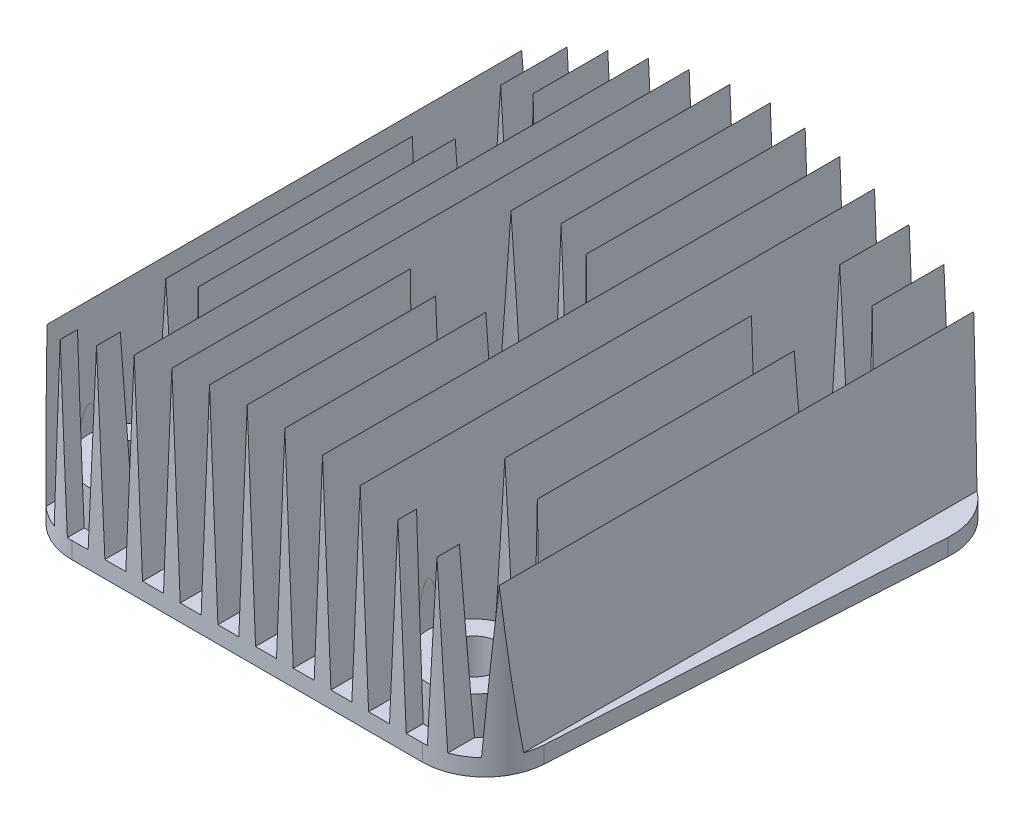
ISO-10303-21;
HEADER;
FILE_DESCRIPTION(('STEP AP214'),'2;1');
FILE_NAME('part.step','',(''),(''),'','','');
FILE_SCHEMA(('AUTOMOTIVE_DESIGN { 1 0 10303 214 1 1 1 1 }'));
ENDSEC;
DATA;
#1=APPLICATION_CONTEXT('core data for automotive mechanical design processes');
#2=APPLICATION_PROTOCOL_DEFINITION('international standard','automotive_design',2000,#1);
#3=PRODUCT_CONTEXT('',#1,'mechanical');
#4=PRODUCT('Part','Part','',(#3));
#5=PRODUCT_RELATED_PRODUCT_CATEGORY('part','',(#4));
#6=PRODUCT_DEFINITION_FORMATION('','',#4);
#7=PRODUCT_DEFINITION_CONTEXT('part definition',#1,'design');
#8=PRODUCT_DEFINITION('design','',#6,#7);
#9=PRODUCT_DEFINITION_SHAPE('','',#8);
#10=(LENGTH_UNIT() NAMED_UNIT(*) SI_UNIT(.MILLI.,.METRE.));
#11=(NAMED_UNIT(*) PLANE_ANGLE_UNIT() SI_UNIT($,.RADIAN.));
#12=(NAMED_UNIT(*) SI_UNIT($,.STERADIAN.) SOLID_ANGLE_UNIT());
#13=UNCERTAINTY_MEASURE_WITH_UNIT(LENGTH_MEASURE(1.E-05),#10,'distance_accuracy_value','');
#14=(GEOMETRIC_REPRESENTATION_CONTEXT(3) GLOBAL_UNCERTAINTY_ASSIGNED_CONTEXT((#13)) GLOBAL_UNIT_ASSIGNED_CONTEXT((#10,
#11,#12)) REPRESENTATION_CONTEXT('',''));
#15=CARTESIAN_POINT('',(0.,0.,0.));
#16=DIRECTION('',(0.,0.,1.));
#17=DIRECTION('',(1.,0.,0.));
#18=AXIS2_PLACEMENT_3D('',#15,#16,#17);
#19=CARTESIAN_POINT('',(-63.,4.,-60.));
#20=DIRECTION('',(0.,-1.,0.));
#21=DIRECTION('',(0.,0.,-1.));
#22=AXIS2_PLACEMENT_3D('',#19,#20,#21);
#23=PLANE('',#22);
#24=CARTESIAN_POINT('',(39.1504991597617,4.,-35.));
#25=DIRECTION('',(0.,1.,0.));
#26=DIRECTION('',(0.,0.,1.));
#27=AXIS2_PLACEMENT_3D('',#24,#25,#26);
#28=CIRCLE('',#27,11.);
#29=CARTESIAN_POINT('',(34.0104195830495,4.,-44.7252034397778));
#30=VERTEX_POINT('',#29);
#31=CARTESIAN_POINT('',(29.0104195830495,4.00000000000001,-39.2636587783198));
#32=VERTEX_POINT('',#31);
#33=EDGE_CURVE('E2922',#30,#32,#28,.T.);
#34=ORIENTED_EDGE('',*,*,#33,.F.);
#35=DIRECTION('',(0.,0.,-1.));
#36=VECTOR('',#35,1.);
#37=CARTESIAN_POINT('',(34.0104195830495,4.,60.));
#38=LINE('',#37,#36);
#39=CARTESIAN_POINT('',(34.0104195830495,4.,-62.3007603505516));
#40=VERTEX_POINT('',#39);
#41=EDGE_CURVE('E1057',#30,#40,#38,.T.);
#42=ORIENTED_EDGE('',*,*,#41,.T.);
#43=DIRECTION('',(-0.996865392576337,0.,-0.0791163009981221));
#44=VECTOR('',#43,1.);
#45=CARTESIAN_POINT('',(63.,4.,-60.));
#46=LINE('',#45,#44);
#47=CARTESIAN_POINT('',(29.0104195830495,4.,-62.697585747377));
#48=VERTEX_POINT('',#47);
#49=EDGE_CURVE('E2989',#40,#48,#46,.T.);
#50=ORIENTED_EDGE('',*,*,#49,.T.);
#51=DIRECTION('',(0.,0.,-1.));
#52=VECTOR('',#51,1.);
#53=CARTESIAN_POINT('',(29.0104195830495,4.,60.));
#54=LINE('',#53,#52);
#55=EDGE_CURVE('E1083',#32,#48,#54,.T.);
#56=ORIENTED_EDGE('',*,*,#55,.F.);
#57=EDGE_LOOP('',(#34,#42,#50,#56));
#58=FACE_BOUND('',#57,.T.);
#59=ADVANCED_FACE('F32',(#58),#23,.F.);
#60=CARTESIAN_POINT('',(29.0104195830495,4.,-30.7363412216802));
#61=VERTEX_POINT('',#60);
#62=CARTESIAN_POINT('',(34.0104195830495,4.00000000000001,-25.2747965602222));
#63=VERTEX_POINT('',#62);
#64=EDGE_CURVE('E773',#61,#63,#28,.T.);
#65=ORIENTED_EDGE('',*,*,#64,.F.);
#66=CARTESIAN_POINT('',(29.0104195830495,4.,40.7363412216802));
#67=VERTEX_POINT('',#66);
#68=EDGE_CURVE('E738',#67,#61,#54,.T.);
#69=ORIENTED_EDGE('',*,*,#68,.F.);
#70=CARTESIAN_POINT('',(39.1504991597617,4.,45.));
#71=DIRECTION('',(0.,1.,0.));
#72=DIRECTION('',(0.,0.,1.));
#73=AXIS2_PLACEMENT_3D('',#70,#71,#72);
#74=CIRCLE('',#73,11.);
#75=CARTESIAN_POINT('',(34.0104195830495,4.,35.2747965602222));
#76=VERTEX_POINT('',#75);
#77=EDGE_CURVE('E3056',#76,#67,#74,.T.);
#78=ORIENTED_EDGE('',*,*,#77,.F.);
#79=EDGE_CURVE('E1062',#76,#63,#38,.T.);
#80=ORIENTED_EDGE('',*,*,#79,.T.);
#81=EDGE_LOOP('',(#65,#69,#78,#80));
#82=FACE_BOUND('',#81,.T.);
#83=ADVANCED_FACE('F1582',(#82),#23,.F.);
#84=CARTESIAN_POINT('',(38.0104195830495,4.00000000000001,-24.059240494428));
#85=VERTEX_POINT('',#84);
#86=CARTESIAN_POINT('',(43.0104195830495,4.00000000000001,-24.699465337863));
#87=VERTEX_POINT('',#86);
#88=EDGE_CURVE('E770',#85,#87,#28,.T.);
#89=ORIENTED_EDGE('',*,*,#88,.F.);
#90=DIRECTION('',(0.,0.,-1.));
#91=VECTOR('',#90,1.);
#92=CARTESIAN_POINT('',(38.0104195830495,4.,60.));
#93=LINE('',#92,#91);
#94=CARTESIAN_POINT('',(38.0104195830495,4.,34.059240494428));
#95=VERTEX_POINT('',#94);
#96=EDGE_CURVE('E1072',#95,#85,#93,.T.);
#97=ORIENTED_EDGE('',*,*,#96,.F.);
#98=CARTESIAN_POINT('',(43.0104195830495,4.,34.699465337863));
#99=VERTEX_POINT('',#98);
#100=EDGE_CURVE('E3055',#99,#95,#74,.T.);
#101=ORIENTED_EDGE('',*,*,#100,.F.);
#102=DIRECTION('',(0.,0.,-1.));
#103=VECTOR('',#102,1.);
#104=CARTESIAN_POINT('',(43.0104195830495,4.,60.));
#105=LINE('',#104,#103);
#106=EDGE_CURVE('E1042',#99,#87,#105,.T.);
#107=ORIENTED_EDGE('',*,*,#106,.T.);
#108=EDGE_LOOP('',(#89,#97,#101,#107));
#109=FACE_BOUND('',#108,.T.);
#110=ADVANCED_FACE('F2888',(#109),#23,.F.);
#111=CARTESIAN_POINT('',(47.0104195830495,4.00000000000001,-27.3044395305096));
#112=VERTEX_POINT('',#111);
#113=CARTESIAN_POINT('',(47.0104195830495,4.00000000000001,-42.6955604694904));
#114=VERTEX_POINT('',#113);
#115=EDGE_CURVE('E774',#112,#114,#28,.T.);
#116=ORIENTED_EDGE('',*,*,#115,.F.);
#117=DIRECTION('',(0.,0.,-1.));
#118=VECTOR('',#117,1.);
#119=CARTESIAN_POINT('',(47.0104195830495,4.,60.));
#120=LINE('',#119,#118);
#121=CARTESIAN_POINT('',(47.0104195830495,4.,37.3044395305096));
#122=VERTEX_POINT('',#121);
#123=EDGE_CURVE('E1052',#122,#112,#120,.T.);
#124=ORIENTED_EDGE('',*,*,#123,.F.);
#125=CARTESIAN_POINT('',(47.0104195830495,4.,52.6955604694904));
#126=VERTEX_POINT('',#125);
#127=EDGE_CURVE('E793',#126,#122,#74,.T.);
#128=ORIENTED_EDGE('',*,*,#127,.F.);
#129=CARTESIAN_POINT('',(47.0104195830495,4.,59.0842080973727));
#130=VERTEX_POINT('',#129);
#131=EDGE_CURVE('E1048',#130,#126,#120,.T.);
#132=ORIENTED_EDGE('',*,*,#131,.F.);
#133=CARTESIAN_POINT('',(41.8495008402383,4.,45.));
#134=DIRECTION('',(0.,-1.,0.));
#135=DIRECTION('',(0.,0.,-1.));
#136=AXIS2_PLACEMENT_3D('',#133,#134,#135);
#137=CIRCLE('',#136,15.);
#138=CARTESIAN_POINT('',(52.0104195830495,4.,56.0342979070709));
#139=VERTEX_POINT('',#138);
#140=EDGE_CURVE('E1300',#130,#139,#137,.F.);
#141=ORIENTED_EDGE('',*,*,#140,.T.);
#142=DIRECTION('',(0.,0.,-1.));
#143=VECTOR('',#142,1.);
#144=CARTESIAN_POINT('',(52.0104195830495,4.,60.));
#145=LINE('',#144,#143);
#146=CARTESIAN_POINT('',(52.0104195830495,4.,-60.4067386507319));
#147=VERTEX_POINT('',#146);
#148=EDGE_CURVE('E1028',#139,#147,#145,.T.);
#149=ORIENTED_EDGE('',*,*,#148,.T.);
#150=CARTESIAN_POINT('',(47.1700363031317,4.,-46.2091793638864));
#151=DIRECTION('',(0.,-1.,0.));
#152=DIRECTION('',(0.,0.,-1.));
#153=AXIS2_PLACEMENT_3D('',#150,#151,#152);
#154=CIRCLE('',#153,15.);
#155=CARTESIAN_POINT('',(48.3567808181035,4.,-61.1621602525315));
#156=VERTEX_POINT('',#155);
#157=EDGE_CURVE('E1299',#147,#156,#154,.F.);
#158=ORIENTED_EDGE('',*,*,#157,.T.);
#159=CARTESIAN_POINT('',(47.0104195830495,4.00000000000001,-61.2690143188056));
#160=VERTEX_POINT('',#159);
#161=EDGE_CURVE('E1252',#156,#160,#46,.T.);
#162=ORIENTED_EDGE('',*,*,#161,.T.);
#163=EDGE_CURVE('E1046',#114,#160,#120,.T.);
#164=ORIENTED_EDGE('',*,*,#163,.F.);
#165=EDGE_LOOP('',(#116,#124,#128,#132,#141,#149,#158,#162,#164));
#166=FACE_BOUND('',#165,.T.);
#167=ADVANCED_FACE('F2878',(#166),#23,.F.);
#168=CARTESIAN_POINT('',(43.0104195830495,4.,-45.300534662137));
#169=VERTEX_POINT('',#168);
#170=CARTESIAN_POINT('',(38.0104195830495,4.00000000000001,-45.940759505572));
#171=VERTEX_POINT('',#170);
#172=EDGE_CURVE('E2924',#169,#171,#28,.T.);
#173=ORIENTED_EDGE('',*,*,#172,.F.);
#174=CARTESIAN_POINT('',(43.0104195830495,4.,-61.5864746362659));
#175=VERTEX_POINT('',#174);
#176=EDGE_CURVE('E1037',#169,#175,#105,.T.);
#177=ORIENTED_EDGE('',*,*,#176,.T.);
#178=CARTESIAN_POINT('',(38.0104195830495,4.,-61.9833000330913));
#179=VERTEX_POINT('',#178);
#180=EDGE_CURVE('E1256',#175,#179,#46,.T.);
#181=ORIENTED_EDGE('',*,*,#180,.T.);
#182=EDGE_CURVE('E1066',#171,#179,#93,.T.);
#183=ORIENTED_EDGE('',*,*,#182,.F.);
#184=EDGE_LOOP('',(#173,#177,#181,#183));
#185=FACE_BOUND('',#184,.T.);
#186=ADVANCED_FACE('F2868',(#185),#23,.F.);
#187=CARTESIAN_POINT('',(-41.8495008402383,4.,-35.));
#188=DIRECTION('',(0.,1.,0.));
#189=DIRECTION('',(0.,0.,1.));
#190=AXIS2_PLACEMENT_3D('',#187,#188,#189);
#191=CIRCLE('',#190,11.);
#192=CARTESIAN_POINT('',(-46.9895804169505,4.,-44.7252034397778));
#193=VERTEX_POINT('',#192);
#194=CARTESIAN_POINT('',(-51.9895804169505,4.00000000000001,-39.2636587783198));
#195=VERTEX_POINT('',#194);
#196=EDGE_CURVE('E1380',#193,#195,#191,.T.);
#197=ORIENTED_EDGE('',*,*,#196,.F.);
#198=DIRECTION('',(0.,0.,-1.));
#199=VECTOR('',#198,1.);
#200=CARTESIAN_POINT('',(-46.9895804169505,4.,60.));
#201=LINE('',#200,#199);
#202=CARTESIAN_POINT('',(-46.9895804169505,4.,-61.2706682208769));
#203=VERTEX_POINT('',#202);
#204=EDGE_CURVE('E1202',#193,#203,#201,.T.);
#205=ORIENTED_EDGE('',*,*,#204,.T.);
#206=DIRECTION('',(-0.996865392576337,0.,0.0791163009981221));
#207=VECTOR('',#206,1.);
#208=CARTESIAN_POINT('',(-63.,4.,-60.));
#209=LINE('',#208,#207);
#210=CARTESIAN_POINT('',(-48.3567808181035,4.,-61.1621602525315));
#211=VERTEX_POINT('',#210);
#212=EDGE_CURVE('E1255',#203,#211,#209,.T.);
#213=ORIENTED_EDGE('',*,*,#212,.T.);
#214=CARTESIAN_POINT('',(-47.1700363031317,4.,-46.2091793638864));
#215=DIRECTION('',(0.,-1.,0.));
#216=DIRECTION('',(0.,0.,-1.));
#217=AXIS2_PLACEMENT_3D('',#214,#215,#216);
#218=CIRCLE('',#217,15.);
#219=CARTESIAN_POINT('',(-51.9895804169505,4.,-60.413826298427));
#220=VERTEX_POINT('',#219);
#221=EDGE_CURVE('E1305',#211,#220,#218,.F.);
#222=ORIENTED_EDGE('',*,*,#221,.T.);
#223=DIRECTION('',(0.,0.,-1.));
#224=VECTOR('',#223,1.);
#225=CARTESIAN_POINT('',(-51.9895804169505,4.,60.));
#226=LINE('',#225,#224);
#227=EDGE_CURVE('E1230',#195,#220,#226,.T.);
#228=ORIENTED_EDGE('',*,*,#227,.F.);
#229=EDGE_LOOP('',(#197,#205,#213,#222,#228));
#230=FACE_BOUND('',#229,.T.);
#231=ADVANCED_FACE('F1403',(#230),#23,.F.);
#232=CARTESIAN_POINT('',(-51.9895804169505,4.,-30.7363412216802));
#233=VERTEX_POINT('',#232);
#234=CARTESIAN_POINT('',(-46.9895804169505,4.00000000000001,-25.2747965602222));
#235=VERTEX_POINT('',#234);
#236=EDGE_CURVE('E783',#233,#235,#191,.T.);
#237=ORIENTED_EDGE('',*,*,#236,.F.);
#238=CARTESIAN_POINT('',(-51.9895804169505,4.,40.7363412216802));
#239=VERTEX_POINT('',#238);
#240=EDGE_CURVE('E1229',#239,#233,#226,.T.);
#241=ORIENTED_EDGE('',*,*,#240,.F.);
#242=CARTESIAN_POINT('',(-41.8495008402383,4.,45.));
#243=DIRECTION('',(0.,1.,0.));
#244=DIRECTION('',(0.,0.,1.));
#245=AXIS2_PLACEMENT_3D('',#242,#243,#244);
#246=CIRCLE('',#245,11.);
#247=CARTESIAN_POINT('',(-46.9895804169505,4.,35.2747965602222));
#248=VERTEX_POINT('',#247);
#249=EDGE_CURVE('E1559',#248,#239,#246,.T.);
#250=ORIENTED_EDGE('',*,*,#249,.F.);
#251=EDGE_CURVE('E1208',#248,#235,#201,.T.);
#252=ORIENTED_EDGE('',*,*,#251,.T.);
#253=EDGE_LOOP('',(#237,#241,#250,#252));
#254=FACE_BOUND('',#253,.T.);
#255=ADVANCED_FACE('F1392',(#254),#23,.F.);
#256=CARTESIAN_POINT('',(-42.9895804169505,4.00000000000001,-24.059240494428));
#257=VERTEX_POINT('',#256);
#258=CARTESIAN_POINT('',(-37.9895804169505,4.00000000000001,-24.699465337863));
#259=VERTEX_POINT('',#258);
#260=EDGE_CURVE('E765',#257,#259,#191,.T.);
#261=ORIENTED_EDGE('',*,*,#260,.F.);
#262=DIRECTION('',(0.,0.,-1.));
#263=VECTOR('',#262,1.);
#264=CARTESIAN_POINT('',(-42.9895804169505,4.,60.));
#265=LINE('',#264,#263);
#266=CARTESIAN_POINT('',(-42.9895804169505,4.,34.059240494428));
#267=VERTEX_POINT('',#266);
#268=EDGE_CURVE('E1218',#267,#257,#265,.T.);
#269=ORIENTED_EDGE('',*,*,#268,.F.);
#270=CARTESIAN_POINT('',(-37.9895804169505,4.,34.699465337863));
#271=VERTEX_POINT('',#270);
#272=EDGE_CURVE('E1536',#271,#267,#246,.T.);
#273=ORIENTED_EDGE('',*,*,#272,.F.);
#274=DIRECTION('',(0.,0.,-1.));
#275=VECTOR('',#274,1.);
#276=CARTESIAN_POINT('',(-37.9895804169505,4.,60.));
#277=LINE('',#276,#275);
#278=EDGE_CURVE('E1193',#271,#259,#277,.T.);
#279=ORIENTED_EDGE('',*,*,#278,.T.);
#280=EDGE_LOOP('',(#261,#269,#273,#279));
#281=FACE_BOUND('',#280,.T.);
#282=ADVANCED_FACE('F1532',(#281),#23,.F.);
#283=CARTESIAN_POINT('',(-33.9895804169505,4.00000000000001,-27.3044395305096));
#284=VERTEX_POINT('',#283);
#285=CARTESIAN_POINT('',(-33.9895804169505,4.00000000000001,-42.6955604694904));
#286=VERTEX_POINT('',#285);
#287=EDGE_CURVE('E784',#284,#286,#191,.T.);
#288=ORIENTED_EDGE('',*,*,#287,.F.);
#289=DIRECTION('',(0.,0.,-1.));
#290=VECTOR('',#289,1.);
#291=CARTESIAN_POINT('',(-33.9895804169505,4.,60.));
#292=LINE('',#291,#290);
#293=CARTESIAN_POINT('',(-33.9895804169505,4.,37.3044395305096));
#294=VERTEX_POINT('',#293);
#295=EDGE_CURVE('E1203',#294,#284,#292,.T.);
#296=ORIENTED_EDGE('',*,*,#295,.F.);
#297=CARTESIAN_POINT('',(-33.9895804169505,4.,52.6955604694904));
#298=VERTEX_POINT('',#297);
#299=EDGE_CURVE('E877',#298,#294,#246,.T.);
#300=ORIENTED_EDGE('',*,*,#299,.F.);
#301=CARTESIAN_POINT('',(-33.9895804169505,4.,60.));
#302=VERTEX_POINT('',#301);
#303=EDGE_CURVE('E1199',#302,#298,#292,.T.);
#304=ORIENTED_EDGE('',*,*,#303,.F.);
#305=DIRECTION('',(1.,0.,0.));
#306=VECTOR('',#305,1.);
#307=CARTESIAN_POINT('',(-56.,4.,60.));
#308=LINE('',#307,#306);
#309=CARTESIAN_POINT('',(-28.9895804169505,4.,60.));
#310=VERTEX_POINT('',#309);
#311=EDGE_CURVE('E1248',#302,#310,#308,.T.);
#312=ORIENTED_EDGE('',*,*,#311,.T.);
#313=DIRECTION('',(0.,0.,-1.));
#314=VECTOR('',#313,1.);
#315=CARTESIAN_POINT('',(-28.9895804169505,4.,60.));
#316=LINE('',#315,#314);
#317=CARTESIAN_POINT('',(-28.9895804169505,4.,-62.6992396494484));
#318=VERTEX_POINT('',#317);
#319=EDGE_CURVE('E1174',#310,#318,#316,.T.);
#320=ORIENTED_EDGE('',*,*,#319,.T.);
#321=CARTESIAN_POINT('',(-33.9895804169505,4.,-62.302414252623));
#322=VERTEX_POINT('',#321);
#323=EDGE_CURVE('E1608',#318,#322,#209,.T.);
#324=ORIENTED_EDGE('',*,*,#323,.T.);
#325=EDGE_CURVE('E1197',#286,#322,#292,.T.);
#326=ORIENTED_EDGE('',*,*,#325,.F.);
#327=EDGE_LOOP('',(#288,#296,#300,#304,#312,#320,#324,#326));
#328=FACE_BOUND('',#327,.T.);
#329=ADVANCED_FACE('F2831',(#328),#23,.F.);
#330=CARTESIAN_POINT('',(-37.9895804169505,4.,-45.300534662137));
#331=VERTEX_POINT('',#330);
#332=CARTESIAN_POINT('',(-42.9895804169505,4.00000000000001,-45.940759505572));
#333=VERTEX_POINT('',#332);
#334=EDGE_CURVE('E1383',#331,#333,#191,.T.);
#335=ORIENTED_EDGE('',*,*,#334,.F.);
#336=CARTESIAN_POINT('',(-37.9895804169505,4.,-61.9849539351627));
#337=VERTEX_POINT('',#336);
#338=EDGE_CURVE('E1188',#331,#337,#277,.T.);
#339=ORIENTED_EDGE('',*,*,#338,.T.);
#340=CARTESIAN_POINT('',(-42.9895804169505,4.,-61.5881285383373));
#341=VERTEX_POINT('',#340);
#342=EDGE_CURVE('E1407',#337,#341,#209,.T.);
#343=ORIENTED_EDGE('',*,*,#342,.T.);
#344=EDGE_CURVE('E1212',#333,#341,#265,.T.);
#345=ORIENTED_EDGE('',*,*,#344,.F.);
#346=EDGE_LOOP('',(#335,#339,#343,#345));
#347=FACE_BOUND('',#346,.T.);
#348=ADVANCED_FACE('F1611',(#347),#23,.F.);
#349=CARTESIAN_POINT('',(29.0104195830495,4.,49.2636587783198));
#350=VERTEX_POINT('',#349);
#351=CARTESIAN_POINT('',(34.0104195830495,4.,54.7252034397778));
#352=VERTEX_POINT('',#351);
#353=EDGE_CURVE('E792',#350,#352,#74,.T.);
#354=ORIENTED_EDGE('',*,*,#353,.F.);
#355=CARTESIAN_POINT('',(29.0104195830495,4.,60.));
#356=VERTEX_POINT('',#355);
#357=EDGE_CURVE('E1084',#356,#350,#54,.T.);
#358=ORIENTED_EDGE('',*,*,#357,.F.);
#359=CARTESIAN_POINT('',(34.0104195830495,4.,60.));
#360=VERTEX_POINT('',#359);
#361=EDGE_CURVE('E3016',#356,#360,#308,.T.);
#362=ORIENTED_EDGE('',*,*,#361,.T.);
#363=EDGE_CURVE('E1058',#360,#352,#38,.T.);
#364=ORIENTED_EDGE('',*,*,#363,.T.);
#365=EDGE_LOOP('',(#354,#358,#362,#364));
#366=FACE_BOUND('',#365,.T.);
#367=ADVANCED_FACE('F2812',(#366),#23,.F.);
#368=CARTESIAN_POINT('',(38.0104195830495,4.,55.940759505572));
#369=VERTEX_POINT('',#368);
#370=CARTESIAN_POINT('',(43.0104195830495,4.,55.300534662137));
#371=VERTEX_POINT('',#370);
#372=EDGE_CURVE('E778',#369,#371,#74,.T.);
#373=ORIENTED_EDGE('',*,*,#372,.F.);
#374=CARTESIAN_POINT('',(38.0104195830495,4.,60.));
#375=VERTEX_POINT('',#374);
#376=EDGE_CURVE('E1068',#375,#369,#93,.T.);
#377=ORIENTED_EDGE('',*,*,#376,.F.);
#378=CARTESIAN_POINT('',(41.8495008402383,4.,60.));
#379=VERTEX_POINT('',#378);
#380=EDGE_CURVE('E1243',#375,#379,#308,.T.);
#381=ORIENTED_EDGE('',*,*,#380,.T.);
#382=CARTESIAN_POINT('',(43.0104195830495,4.,59.9550081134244));
#383=VERTEX_POINT('',#382);
#384=EDGE_CURVE('E1296',#379,#383,#137,.F.);
#385=ORIENTED_EDGE('',*,*,#384,.T.);
#386=EDGE_CURVE('E1038',#383,#371,#105,.T.);
#387=ORIENTED_EDGE('',*,*,#386,.T.);
#388=EDGE_LOOP('',(#373,#377,#381,#385,#387));
#389=FACE_BOUND('',#388,.T.);
#390=ADVANCED_FACE('F1754',(#389),#23,.F.);
#391=CARTESIAN_POINT('',(27.0104195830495,49.7829917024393,60.));
#392=DIRECTION('',(-0.999047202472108,-0.0436427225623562,0.));
#393=DIRECTION('',(0.0436427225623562,-0.999047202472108,0.));
#394=AXIS2_PLACEMENT_3D('',#391,#392,#393);
#395=PLANE('',#394);
#396=CARTESIAN_POINT('',(39.1504991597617,-228.121589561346,-35.));
#397=DIRECTION('',(-0.999047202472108,-0.0436427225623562,0.));
#398=DIRECTION('',(0.0436427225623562,-0.999047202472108,0.));
#399=AXIS2_PLACEMENT_3D('',#396,#397,#398);
#400=ELLIPSE('',#399,252.046603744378,11.);
#401=CARTESIAN_POINT('',(28.6172604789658,13.,-38.1703127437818));
#402=VERTEX_POINT('',#401);
#403=EDGE_CURVE('E730',#32,#402,#400,.F.);
#404=ORIENTED_EDGE('',*,*,#403,.F.);
#405=ORIENTED_EDGE('',*,*,#55,.T.);
#406=DIRECTION('',(0.0436424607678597,-0.999041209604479,0.00346368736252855));
#407=VECTOR('',#406,1.);
#408=CARTESIAN_POINT('',(27.0289910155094,49.3578638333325,-62.8548419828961));
#409=LINE('',#408,#407);
#410=CARTESIAN_POINT('',(27.0104195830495,49.7829917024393,-62.8563159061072));
#411=VERTEX_POINT('',#410);
#412=EDGE_CURVE('E972',#411,#48,#409,.T.);
#413=ORIENTED_EDGE('',*,*,#412,.F.);
#414=DIRECTION('',(0.,0.,-1.));
#415=VECTOR('',#414,1.);
#416=CARTESIAN_POINT('',(27.0104195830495,49.7829917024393,60.));
#417=LINE('',#416,#415);
#418=CARTESIAN_POINT('',(27.0104195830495,49.7829917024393,60.));
#419=VERTEX_POINT('',#418);
#420=EDGE_CURVE('E1080',#419,#411,#417,.T.);
#421=ORIENTED_EDGE('',*,*,#420,.F.);
#422=DIRECTION('',(-0.0436427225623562,0.999047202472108,0.));
#423=VECTOR('',#422,1.);
#424=CARTESIAN_POINT('',(27.0104195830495,49.7829917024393,60.));
#425=LINE('',#424,#423);
#426=EDGE_CURVE('E1071',#356,#419,#425,.T.);
#427=ORIENTED_EDGE('',*,*,#426,.F.);
#428=ORIENTED_EDGE('',*,*,#357,.T.);
#429=CARTESIAN_POINT('',(39.1504991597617,-228.121589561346,45.));
#430=DIRECTION('',(-0.999047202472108,-0.0436427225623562,0.));
#431=DIRECTION('',(0.0436427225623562,-0.999047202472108,0.));
#432=AXIS2_PLACEMENT_3D('',#429,#430,#431);
#433=ELLIPSE('',#432,252.046603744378,11.);
#434=CARTESIAN_POINT('',(28.6172604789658,13.,48.1703127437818));
#435=VERTEX_POINT('',#434);
#436=EDGE_CURVE('E861',#435,#350,#433,.F.);
#437=ORIENTED_EDGE('',*,*,#436,.F.);
#438=CARTESIAN_POINT('',(28.6172604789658,13.,41.8296872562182));
#439=VERTEX_POINT('',#438);
#440=EDGE_CURVE('E860',#439,#435,#433,.F.);
#441=ORIENTED_EDGE('',*,*,#440,.F.);
#442=EDGE_CURVE('E856',#67,#439,#433,.F.);
#443=ORIENTED_EDGE('',*,*,#442,.F.);
#444=ORIENTED_EDGE('',*,*,#68,.T.);
#445=CARTESIAN_POINT('',(28.6172604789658,13.,-31.8296872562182));
#446=VERTEX_POINT('',#445);
#447=EDGE_CURVE('E731',#446,#61,#400,.F.);
#448=ORIENTED_EDGE('',*,*,#447,.F.);
#449=EDGE_CURVE('E725',#402,#446,#400,.F.);
#450=ORIENTED_EDGE('',*,*,#449,.F.);
#451=EDGE_LOOP('',(#404,#405,#413,#421,#427,#428,#437,#441,#443,#444,#448,#450));
#452=FACE_BOUND('',#451,.T.);
#453=ADVANCED_FACE('F736',(#452),#395,.F.);
#454=CARTESIAN_POINT('',(36.0104195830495,47.2165265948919,60.));
#455=DIRECTION('',(-0.998930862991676,-0.0462291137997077,0.));
#456=DIRECTION('',(0.0462291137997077,-0.998930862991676,0.));
#457=AXIS2_PLACEMENT_3D('',#454,#455,#456);
#458=PLANE('',#457);
#459=CARTESIAN_POINT('',(39.1504991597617,-20.6351396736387,-35.));
#460=DIRECTION('',(-0.998930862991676,-0.0462291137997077,0.));
#461=DIRECTION('',(0.0462291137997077,-0.998930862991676,0.));
#462=AXIS2_PLACEMENT_3D('',#459,#460,#461);
#463=ELLIPSE('',#462,237.945292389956,11.);
#464=CARTESIAN_POINT('',(37.5939122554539,13.,-45.8893083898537));
#465=VERTEX_POINT('',#464);
#466=EDGE_CURVE('E808',#171,#465,#463,.F.);
#467=ORIENTED_EDGE('',*,*,#466,.F.);
#468=ORIENTED_EDGE('',*,*,#182,.T.);
#469=DIRECTION('',(0.0462288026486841,-0.998924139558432,0.00366895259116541));
#470=VECTOR('',#469,1.);
#471=CARTESIAN_POINT('',(36.0311362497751,46.768875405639,-62.1403860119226));
#472=LINE('',#471,#470);
#473=CARTESIAN_POINT('',(36.0104195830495,47.2165265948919,-62.1420301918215));
#474=VERTEX_POINT('',#473);
#475=EDGE_CURVE('E964',#474,#179,#472,.T.);
#476=ORIENTED_EDGE('',*,*,#475,.F.);
#477=DIRECTION('',(0.,0.,-1.));
#478=VECTOR('',#477,1.);
#479=CARTESIAN_POINT('',(36.0104195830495,47.2165265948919,60.));
#480=LINE('',#479,#478);
#481=CARTESIAN_POINT('',(36.0104195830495,47.2165265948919,-45.5422910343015));
#482=VERTEX_POINT('',#481);
#483=EDGE_CURVE('E1061',#482,#474,#480,.T.);
#484=ORIENTED_EDGE('',*,*,#483,.F.);
#485=EDGE_CURVE('E806',#465,#482,#463,.F.);
#486=ORIENTED_EDGE('',*,*,#485,.F.);
#487=EDGE_LOOP('',(#467,#468,#476,#484,#486));
#488=FACE_BOUND('',#487,.T.);
#489=ADVANCED_FACE('F2686',(#488),#458,.F.);
#490=CARTESIAN_POINT('',(36.0104195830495,47.2165265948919,-24.4577089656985));
#491=VERTEX_POINT('',#490);
#492=CARTESIAN_POINT('',(37.5939122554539,13.,-24.1106916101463));
#493=VERTEX_POINT('',#492);
#494=EDGE_CURVE('E741',#491,#493,#463,.F.);
#495=ORIENTED_EDGE('',*,*,#494,.F.);
#496=CARTESIAN_POINT('',(36.0104195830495,47.2165265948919,34.4577089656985));
#497=VERTEX_POINT('',#496);
#498=EDGE_CURVE('E1067',#497,#491,#480,.T.);
#499=ORIENTED_EDGE('',*,*,#498,.F.);
#500=CARTESIAN_POINT('',(39.1504991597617,-20.6351396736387,45.));
#501=DIRECTION('',(-0.998930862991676,-0.0462291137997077,0.));
#502=DIRECTION('',(0.0462291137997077,-0.998930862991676,0.));
#503=AXIS2_PLACEMENT_3D('',#500,#501,#502);
#504=ELLIPSE('',#503,237.945292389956,11.);
#505=CARTESIAN_POINT('',(37.5939122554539,13.,34.1106916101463));
#506=VERTEX_POINT('',#505);
#507=EDGE_CURVE('E848',#506,#497,#504,.F.);
#508=ORIENTED_EDGE('',*,*,#507,.F.);
#509=EDGE_CURVE('E851',#95,#506,#504,.F.);
#510=ORIENTED_EDGE('',*,*,#509,.F.);
#511=ORIENTED_EDGE('',*,*,#96,.T.);
#512=EDGE_CURVE('E2936',#493,#85,#463,.F.);
#513=ORIENTED_EDGE('',*,*,#512,.F.);
#514=EDGE_LOOP('',(#495,#499,#508,#510,#511,#513));
#515=FACE_BOUND('',#514,.T.);
#516=ADVANCED_FACE('F2687',(#515),#458,.F.);
#517=CARTESIAN_POINT('',(34.0104195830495,4.,60.));
#518=DIRECTION('',(0.998930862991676,-0.0462291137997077,0.));
#519=DIRECTION('',(0.0462291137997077,0.998930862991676,0.));
#520=AXIS2_PLACEMENT_3D('',#517,#518,#519);
#521=PLANE('',#520);
#522=CARTESIAN_POINT('',(39.1504991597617,115.068192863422,-35.));
#523=DIRECTION('',(0.998930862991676,-0.0462291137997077,0.));
#524=DIRECTION('',(-0.0462291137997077,-0.998930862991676,0.));
#525=AXIS2_PLACEMENT_3D('',#522,#523,#524);
#526=ELLIPSE('',#525,237.945292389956,11.);
#527=CARTESIAN_POINT('',(34.426926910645,13.,-25.0658233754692));
#528=VERTEX_POINT('',#527);
#529=EDGE_CURVE('E746',#63,#528,#526,.F.);
#530=ORIENTED_EDGE('',*,*,#529,.F.);
#531=ORIENTED_EDGE('',*,*,#79,.F.);
#532=CARTESIAN_POINT('',(39.1504991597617,115.068192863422,45.));
#533=DIRECTION('',(0.998930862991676,-0.0462291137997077,0.));
#534=DIRECTION('',(-0.0462291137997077,-0.998930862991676,0.));
#535=AXIS2_PLACEMENT_3D('',#532,#533,#534);
#536=ELLIPSE('',#535,237.945292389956,11.);
#537=CARTESIAN_POINT('',(34.426926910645,13.,35.0658233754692));
#538=VERTEX_POINT('',#537);
#539=EDGE_CURVE('E849',#538,#76,#536,.F.);
#540=ORIENTED_EDGE('',*,*,#539,.F.);
#541=EDGE_CURVE('E845',#497,#538,#536,.F.);
#542=ORIENTED_EDGE('',*,*,#541,.F.);
#543=ORIENTED_EDGE('',*,*,#498,.T.);
#544=EDGE_CURVE('E810',#528,#491,#526,.F.);
#545=ORIENTED_EDGE('',*,*,#544,.F.);
#546=EDGE_LOOP('',(#530,#531,#540,#542,#543,#545));
#547=FACE_BOUND('',#546,.T.);
#548=ADVANCED_FACE('F2676',(#547),#521,.F.);
#549=CARTESIAN_POINT('',(34.426926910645,13.,-44.9341766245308));
#550=VERTEX_POINT('',#549);
#551=EDGE_CURVE('E803',#482,#550,#526,.F.);
#552=ORIENTED_EDGE('',*,*,#551,.F.);
#553=ORIENTED_EDGE('',*,*,#483,.T.);
#554=DIRECTION('',(0.0462288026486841,0.998924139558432,0.00366895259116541));
#555=VECTOR('',#554,1.);
#556=CARTESIAN_POINT('',(34.0311631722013,4.44823293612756,-62.2991140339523));
#557=LINE('',#556,#555);
#558=EDGE_CURVE('E967',#40,#474,#557,.T.);
#559=ORIENTED_EDGE('',*,*,#558,.F.);
#560=ORIENTED_EDGE('',*,*,#41,.F.);
#561=EDGE_CURVE('E807',#550,#30,#526,.F.);
#562=ORIENTED_EDGE('',*,*,#561,.F.);
#563=EDGE_LOOP('',(#552,#553,#559,#560,#562));
#564=FACE_BOUND('',#563,.T.);
#565=ADVANCED_FACE('F2677',(#564),#521,.F.);
#566=CARTESIAN_POINT('',(45.0104195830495,43.8256213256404,60.));
#567=DIRECTION('',(-0.998741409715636,-0.0501557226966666,0.));
#568=DIRECTION('',(0.0501557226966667,-0.998741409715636,0.));
#569=AXIS2_PLACEMENT_3D('',#566,#567,#568);
#570=PLANE('',#569);
#571=CARTESIAN_POINT('',(39.1504991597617,160.513107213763,-35.));
#572=DIRECTION('',(-0.998741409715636,-0.0501557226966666,0.));
#573=DIRECTION('',(0.0501557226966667,-0.998741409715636,0.));
#574=AXIS2_PLACEMENT_3D('',#571,#572,#573);
#575=ELLIPSE('',#574,219.316947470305,11.);
#576=CARTESIAN_POINT('',(46.5584492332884,13.,-43.1315604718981));
#577=VERTEX_POINT('',#576);
#578=EDGE_CURVE('E798',#114,#577,#575,.F.);
#579=ORIENTED_EDGE('',*,*,#578,.F.);
#580=ORIENTED_EDGE('',*,*,#163,.T.);
#581=DIRECTION('',(0.0501553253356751,-0.998733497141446,0.00398058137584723));
#582=VECTOR('',#581,1.);
#583=CARTESIAN_POINT('',(45.0346623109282,43.3428804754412,-61.4258204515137));
#584=LINE('',#583,#582);
#585=CARTESIAN_POINT('',(45.0104195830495,43.8256213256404,-61.4277444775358));
#586=VERTEX_POINT('',#585);
#587=EDGE_CURVE('E961',#586,#160,#584,.T.);
#588=ORIENTED_EDGE('',*,*,#587,.F.);
#589=DIRECTION('',(0.,0.,-1.));
#590=VECTOR('',#589,1.);
#591=CARTESIAN_POINT('',(45.0104195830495,43.8256213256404,60.));
#592=LINE('',#591,#590);
#593=CARTESIAN_POINT('',(45.0104195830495,43.8256213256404,-44.3092068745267));
#594=VERTEX_POINT('',#593);
#595=EDGE_CURVE('E1041',#594,#586,#592,.T.);
#596=ORIENTED_EDGE('',*,*,#595,.F.);
#597=EDGE_CURVE('E796',#577,#594,#575,.F.);
#598=ORIENTED_EDGE('',*,*,#597,.F.);
#599=EDGE_LOOP('',(#579,#580,#588,#596,#598));
#600=FACE_BOUND('',#599,.T.);
#601=ADVANCED_FACE('F2665',(#600),#570,.F.);
#602=CARTESIAN_POINT('',(45.0104195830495,43.8256213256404,-25.6907931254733));
#603=VERTEX_POINT('',#602);
#604=CARTESIAN_POINT('',(46.5584492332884,13.,-26.8684395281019));
#605=VERTEX_POINT('',#604);
#606=EDGE_CURVE('E802',#603,#605,#575,.F.);
#607=ORIENTED_EDGE('',*,*,#606,.F.);
#608=CARTESIAN_POINT('',(45.0104195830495,43.8256213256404,35.6907931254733));
#609=VERTEX_POINT('',#608);
#610=EDGE_CURVE('E1047',#609,#603,#592,.T.);
#611=ORIENTED_EDGE('',*,*,#610,.F.);
#612=CARTESIAN_POINT('',(39.1504991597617,160.513107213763,45.));
#613=DIRECTION('',(-0.998741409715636,-0.0501557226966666,0.));
#614=DIRECTION('',(0.0501557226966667,-0.998741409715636,0.));
#615=AXIS2_PLACEMENT_3D('',#612,#613,#614);
#616=ELLIPSE('',#615,219.316947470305,11.);
#617=CARTESIAN_POINT('',(46.5584492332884,13.,36.8684395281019));
#618=VERTEX_POINT('',#617);
#619=EDGE_CURVE('E838',#618,#609,#616,.F.);
#620=ORIENTED_EDGE('',*,*,#619,.F.);
#621=EDGE_CURVE('E840',#122,#618,#616,.F.);
#622=ORIENTED_EDGE('',*,*,#621,.F.);
#623=ORIENTED_EDGE('',*,*,#123,.T.);
#624=EDGE_CURVE('E2938',#605,#112,#575,.F.);
#625=ORIENTED_EDGE('',*,*,#624,.F.);
#626=EDGE_LOOP('',(#607,#611,#620,#622,#623,#625));
#627=FACE_BOUND('',#626,.T.);
#628=ADVANCED_FACE('F2666',(#627),#570,.F.);
#629=CARTESIAN_POINT('',(43.0104195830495,4.,60.));
#630=DIRECTION('',(0.998741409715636,-0.0501557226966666,0.));
#631=DIRECTION('',(0.0501557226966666,0.998741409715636,0.));
#632=AXIS2_PLACEMENT_3D('',#629,#630,#631);
#633=PLANE('',#632);
#634=CARTESIAN_POINT('',(39.1504991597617,-72.8618645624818,-35.));
#635=DIRECTION('',(0.998741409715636,-0.0501557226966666,0.));
#636=DIRECTION('',(-0.0501557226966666,-0.998741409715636,0.));
#637=AXIS2_PLACEMENT_3D('',#634,#635,#636);
#638=ELLIPSE('',#637,219.316947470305,11.);
#639=CARTESIAN_POINT('',(43.4623899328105,13.,-24.8803360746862));
#640=VERTEX_POINT('',#639);
#641=EDGE_CURVE('E797',#87,#640,#638,.F.);
#642=ORIENTED_EDGE('',*,*,#641,.F.);
#643=ORIENTED_EDGE('',*,*,#106,.F.);
#644=CARTESIAN_POINT('',(39.1504991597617,-72.8618645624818,45.));
#645=DIRECTION('',(0.998741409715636,-0.0501557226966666,0.));
#646=DIRECTION('',(-0.0501557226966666,-0.998741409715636,0.));
#647=AXIS2_PLACEMENT_3D('',#644,#645,#646);
#648=ELLIPSE('',#647,219.316947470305,11.);
#649=CARTESIAN_POINT('',(43.4623899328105,13.,34.8803360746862));
#650=VERTEX_POINT('',#649);
#651=EDGE_CURVE('E832',#650,#99,#648,.F.);
#652=ORIENTED_EDGE('',*,*,#651,.F.);
#653=EDGE_CURVE('E835',#609,#650,#648,.F.);
#654=ORIENTED_EDGE('',*,*,#653,.F.);
#655=ORIENTED_EDGE('',*,*,#610,.T.);
#656=EDGE_CURVE('E801',#640,#603,#638,.F.);
#657=ORIENTED_EDGE('',*,*,#656,.F.);
#658=EDGE_LOOP('',(#642,#643,#652,#654,#655,#657));
#659=FACE_BOUND('',#658,.T.);
#660=ADVANCED_FACE('F2656',(#659),#633,.F.);
#661=CARTESIAN_POINT('',(43.4623899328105,13.,-45.1196639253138));
#662=VERTEX_POINT('',#661);
#663=EDGE_CURVE('E794',#594,#662,#638,.F.);
#664=ORIENTED_EDGE('',*,*,#663,.F.);
#665=ORIENTED_EDGE('',*,*,#595,.T.);
#666=DIRECTION('',(0.0501553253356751,0.998733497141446,0.00398058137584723));
#667=VECTOR('',#666,1.);
#668=CARTESIAN_POINT('',(43.0346940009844,4.4833718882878,-61.58454809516));
#669=LINE('',#668,#667);
#670=EDGE_CURVE('E1332',#175,#586,#669,.T.);
#671=ORIENTED_EDGE('',*,*,#670,.F.);
#672=ORIENTED_EDGE('',*,*,#176,.F.);
#673=EDGE_CURVE('E47',#662,#169,#638,.F.);
#674=ORIENTED_EDGE('',*,*,#673,.F.);
#675=EDGE_LOOP('',(#664,#665,#671,#672,#674));
#676=FACE_BOUND('',#675,.T.);
#677=ADVANCED_FACE('F2657',(#676),#633,.F.);
#678=CARTESIAN_POINT('',(-53.9895804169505,39.5387867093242,60.));
#679=DIRECTION('',(-0.998420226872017,-0.0561876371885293,0.));
#680=DIRECTION('',(0.0561876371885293,-0.998420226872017,0.));
#681=AXIS2_PLACEMENT_3D('',#678,#679,#680);
#682=PLANE('',#681);
#683=CARTESIAN_POINT('',(-41.8495008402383,-176.183062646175,-35.));
#684=DIRECTION('',(-0.998420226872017,-0.0561876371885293,0.));
#685=DIRECTION('',(0.0561876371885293,-0.998420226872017,0.));
#686=AXIS2_PLACEMENT_3D('',#683,#684,#685);
#687=ELLIPSE('',#686,195.772603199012,11.);
#688=CARTESIAN_POINT('',(-52.4960692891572,13.,-37.7659682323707));
#689=VERTEX_POINT('',#688);
#690=EDGE_CURVE('E829',#195,#689,#687,.F.);
#691=ORIENTED_EDGE('',*,*,#690,.F.);
#692=ORIENTED_EDGE('',*,*,#227,.T.);
#693=CARTESIAN_POINT('',(-47.1700363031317,-81.6403751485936,-46.2091793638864));
#694=DIRECTION('',(-0.998420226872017,-0.0561876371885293,0.));
#695=DIRECTION('',(0.0561876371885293,-0.998420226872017,0.));
#696=AXIS2_PLACEMENT_3D('',#693,#694,#695);
#697=ELLIPSE('',#696,266.962640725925,15.);
#698=CARTESIAN_POINT('',(-53.9895804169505,39.5387867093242,-59.5693372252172));
#699=VERTEX_POINT('',#698);
#700=EDGE_CURVE('E1025',#699,#220,#697,.T.);
#701=ORIENTED_EDGE('',*,*,#700,.F.);
#702=DIRECTION('',(0.,0.,-1.));
#703=VECTOR('',#702,1.);
#704=CARTESIAN_POINT('',(-53.9895804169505,39.5387867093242,60.));
#705=LINE('',#704,#703);
#706=CARTESIAN_POINT('',(-53.9895804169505,39.5387867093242,53.8101343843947));
#707=VERTEX_POINT('',#706);
#708=EDGE_CURVE('E1217',#707,#699,#705,.T.);
#709=ORIENTED_EDGE('',*,*,#708,.F.);
#710=CARTESIAN_POINT('',(-41.8495008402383,-176.183062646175,45.));
#711=DIRECTION('',(-0.998420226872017,-0.0561876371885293,0.));
#712=DIRECTION('',(0.0561876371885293,-0.998420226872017,0.));
#713=AXIS2_PLACEMENT_3D('',#710,#711,#712);
#714=ELLIPSE('',#713,266.962640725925,15.);
#715=CARTESIAN_POINT('',(-51.9895804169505,4.,56.0534513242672));
#716=VERTEX_POINT('',#715);
#717=EDGE_CURVE('E1021',#716,#707,#714,.T.);
#718=ORIENTED_EDGE('',*,*,#717,.F.);
#719=CARTESIAN_POINT('',(-51.9895804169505,4.,49.2636587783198));
#720=VERTEX_POINT('',#719);
#721=EDGE_CURVE('E1223',#716,#720,#226,.T.);
#722=ORIENTED_EDGE('',*,*,#721,.T.);
#723=CARTESIAN_POINT('',(-41.8495008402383,-176.183062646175,45.));
#724=DIRECTION('',(-0.998420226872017,-0.0561876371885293,0.));
#725=DIRECTION('',(0.0561876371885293,-0.998420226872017,0.));
#726=AXIS2_PLACEMENT_3D('',#723,#724,#725);
#727=ELLIPSE('',#726,195.772603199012,11.);
#728=CARTESIAN_POINT('',(-52.4960692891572,13.,47.7659682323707));
#729=VERTEX_POINT('',#728);
#730=EDGE_CURVE('E904',#729,#720,#727,.F.);
#731=ORIENTED_EDGE('',*,*,#730,.F.);
#732=CARTESIAN_POINT('',(-52.4960692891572,13.,42.2340317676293));
#733=VERTEX_POINT('',#732);
#734=EDGE_CURVE('E903',#733,#729,#727,.F.);
#735=ORIENTED_EDGE('',*,*,#734,.F.);
#736=EDGE_CURVE('E899',#239,#733,#727,.F.);
#737=ORIENTED_EDGE('',*,*,#736,.F.);
#738=ORIENTED_EDGE('',*,*,#240,.T.);
#739=CARTESIAN_POINT('',(-52.4960692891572,13.,-32.2340317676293));
#740=VERTEX_POINT('',#739);
#741=EDGE_CURVE('E834',#740,#233,#687,.F.);
#742=ORIENTED_EDGE('',*,*,#741,.F.);
#743=EDGE_CURVE('E833',#689,#740,#687,.F.);
#744=ORIENTED_EDGE('',*,*,#743,.F.);
#745=EDGE_LOOP('',(#691,#692,#701,#709,#718,#722,#731,#735,#737,#738,#742,#744));
#746=FACE_BOUND('',#745,.T.);
#747=ADVANCED_FACE('F1372',(#746),#682,.F.);
#748=CARTESIAN_POINT('',(-44.9895804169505,43.8344823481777,60.));
#749=DIRECTION('',(-0.998741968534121,-0.0501445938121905,0.));
#750=DIRECTION('',(0.0501445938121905,-0.998741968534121,0.));
#751=AXIS2_PLACEMENT_3D('',#748,#749,#750);
#752=PLANE('',#751);
#753=CARTESIAN_POINT('',(-41.8495008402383,-18.7072398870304,-35.));
#754=DIRECTION('',(-0.998741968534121,-0.0501445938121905,0.));
#755=DIRECTION('',(0.0501445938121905,-0.998741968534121,0.));
#756=AXIS2_PLACEMENT_3D('',#753,#754,#755);
#757=ELLIPSE('',#756,219.365621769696,11.);
#758=CARTESIAN_POINT('',(-43.4414502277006,13.,-45.8841948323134));
#759=VERTEX_POINT('',#758);
#760=EDGE_CURVE('E824',#333,#759,#757,.F.);
#761=ORIENTED_EDGE('',*,*,#760,.F.);
#762=ORIENTED_EDGE('',*,*,#344,.T.);
#763=DIRECTION('',(0.0501441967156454,-0.998734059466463,-0.00397969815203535));
#764=VECTOR('',#763,1.);
#765=CARTESIAN_POINT('',(-45.0138127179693,44.3171229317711,-61.4274751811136));
#766=LINE('',#765,#764);
#767=CARTESIAN_POINT('',(-44.9895804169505,43.8344823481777,-61.4293983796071));
#768=VERTEX_POINT('',#767);
#769=EDGE_CURVE('E1016',#768,#341,#766,.T.);
#770=ORIENTED_EDGE('',*,*,#769,.F.);
#771=DIRECTION('',(0.,0.,-1.));
#772=VECTOR('',#771,1.);
#773=CARTESIAN_POINT('',(-44.9895804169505,43.8344823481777,60.));
#774=LINE('',#773,#772);
#775=CARTESIAN_POINT('',(-44.9895804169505,43.8344823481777,-45.5422910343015));
#776=VERTEX_POINT('',#775);
#777=EDGE_CURVE('E1207',#776,#768,#774,.T.);
#778=ORIENTED_EDGE('',*,*,#777,.F.);
#779=EDGE_CURVE('E821',#759,#776,#757,.F.);
#780=ORIENTED_EDGE('',*,*,#779,.F.);
#781=EDGE_LOOP('',(#761,#762,#770,#778,#780));
#782=FACE_BOUND('',#781,.T.);
#783=ADVANCED_FACE('F1738',(#782),#752,.F.);
#784=CARTESIAN_POINT('',(-44.9895804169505,43.8344823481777,-24.4577089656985));
#785=VERTEX_POINT('',#784);
#786=CARTESIAN_POINT('',(-43.4414502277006,13.,-24.1158051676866));
#787=VERTEX_POINT('',#786);
#788=EDGE_CURVE('E828',#785,#787,#757,.F.);
#789=ORIENTED_EDGE('',*,*,#788,.F.);
#790=CARTESIAN_POINT('',(-44.9895804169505,43.8344823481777,34.4577089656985));
#791=VERTEX_POINT('',#790);
#792=EDGE_CURVE('E1213',#791,#785,#774,.T.);
#793=ORIENTED_EDGE('',*,*,#792,.F.);
#794=CARTESIAN_POINT('',(-41.8495008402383,-18.7072398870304,45.));
#795=DIRECTION('',(-0.998741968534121,-0.0501445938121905,0.));
#796=DIRECTION('',(0.0501445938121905,-0.998741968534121,0.));
#797=AXIS2_PLACEMENT_3D('',#794,#795,#796);
#798=ELLIPSE('',#797,219.365621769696,11.);
#799=CARTESIAN_POINT('',(-43.4414502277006,13.,34.1158051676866));
#800=VERTEX_POINT('',#799);
#801=EDGE_CURVE('E891',#800,#791,#798,.F.);
#802=ORIENTED_EDGE('',*,*,#801,.F.);
#803=EDGE_CURVE('E894',#267,#800,#798,.F.);
#804=ORIENTED_EDGE('',*,*,#803,.F.);
#805=ORIENTED_EDGE('',*,*,#268,.T.);
#806=EDGE_CURVE('E1524',#787,#257,#757,.F.);
#807=ORIENTED_EDGE('',*,*,#806,.F.);
#808=EDGE_LOOP('',(#789,#793,#802,#804,#805,#807));
#809=FACE_BOUND('',#808,.T.);
#810=ADVANCED_FACE('F1616',(#809),#752,.F.);
#811=CARTESIAN_POINT('',(-46.9895804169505,4.,60.));
#812=DIRECTION('',(0.998741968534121,-0.0501445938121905,0.));
#813=DIRECTION('',(0.0501445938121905,0.998741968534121,0.));
#814=AXIS2_PLACEMENT_3D('',#811,#812,#813);
#815=PLANE('',#814);
#816=CARTESIAN_POINT('',(-41.8495008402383,106.376204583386,-35.));
#817=DIRECTION('',(0.998741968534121,-0.0501445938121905,0.));
#818=DIRECTION('',(-0.0501445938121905,-0.998741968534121,0.));
#819=AXIS2_PLACEMENT_3D('',#816,#817,#818);
#820=ELLIPSE('',#819,219.365621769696,11.);
#821=CARTESIAN_POINT('',(-46.5377106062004,13.,-25.0490860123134));
#822=VERTEX_POINT('',#821);
#823=EDGE_CURVE('E823',#235,#822,#820,.F.);
#824=ORIENTED_EDGE('',*,*,#823,.F.);
#825=ORIENTED_EDGE('',*,*,#251,.F.);
#826=CARTESIAN_POINT('',(-41.8495008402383,106.376204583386,45.));
#827=DIRECTION('',(0.998741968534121,-0.0501445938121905,0.));
#828=DIRECTION('',(-0.0501445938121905,-0.998741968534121,0.));
#829=AXIS2_PLACEMENT_3D('',#826,#827,#828);
#830=ELLIPSE('',#829,219.365621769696,11.);
#831=CARTESIAN_POINT('',(-46.5377106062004,13.,35.0490860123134));
#832=VERTEX_POINT('',#831);
#833=EDGE_CURVE('E892',#832,#248,#830,.F.);
#834=ORIENTED_EDGE('',*,*,#833,.F.);
#835=EDGE_CURVE('E888',#791,#832,#830,.F.);
#836=ORIENTED_EDGE('',*,*,#835,.F.);
#837=ORIENTED_EDGE('',*,*,#792,.T.);
#838=EDGE_CURVE('E827',#822,#785,#820,.F.);
#839=ORIENTED_EDGE('',*,*,#838,.F.);
#840=EDGE_LOOP('',(#824,#825,#834,#836,#837,#839));
#841=FACE_BOUND('',#840,.T.);
#842=ADVANCED_FACE('F1728',(#841),#815,.F.);
#843=CARTESIAN_POINT('',(-46.5377106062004,13.,-44.9509139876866));
#844=VERTEX_POINT('',#843);
#845=EDGE_CURVE('E818',#776,#844,#820,.F.);
#846=ORIENTED_EDGE('',*,*,#845,.F.);
#847=ORIENTED_EDGE('',*,*,#777,.T.);
#848=DIRECTION('',(0.0501441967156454,0.998734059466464,-0.00397969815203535));
#849=VECTOR('',#848,1.);
#850=CARTESIAN_POINT('',(-47.0137810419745,3.51799031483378,-61.2687475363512));
#851=LINE('',#850,#849);
#852=EDGE_CURVE('E1013',#203,#768,#851,.T.);
#853=ORIENTED_EDGE('',*,*,#852,.F.);
#854=ORIENTED_EDGE('',*,*,#204,.F.);
#855=EDGE_CURVE('E822',#844,#193,#820,.F.);
#856=ORIENTED_EDGE('',*,*,#855,.F.);
#857=EDGE_LOOP('',(#846,#847,#853,#854,#856));
#858=FACE_BOUND('',#857,.T.);
#859=ADVANCED_FACE('F1729',(#858),#815,.F.);
#860=CARTESIAN_POINT('',(-35.9895804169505,47.2233953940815,60.));
#861=DIRECTION('',(-0.99893120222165,-0.0462217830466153,0.));
#862=DIRECTION('',(0.0462217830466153,-0.99893120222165,0.));
#863=AXIS2_PLACEMENT_3D('',#860,#861,#862);
#864=PLANE('',#863);
#865=CARTESIAN_POINT('',(-41.8495008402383,173.866224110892,-35.));
#866=DIRECTION('',(-0.99893120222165,-0.0462217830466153,0.));
#867=DIRECTION('',(0.0462217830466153,-0.99893120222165,0.));
#868=AXIS2_PLACEMENT_3D('',#865,#866,#867);
#869=ELLIPSE('',#868,237.983030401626,11.);
#870=CARTESIAN_POINT('',(-34.406021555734,13.,-43.0990503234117));
#871=VERTEX_POINT('',#870);
#872=EDGE_CURVE('E813',#286,#871,#869,.F.);
#873=ORIENTED_EDGE('',*,*,#872,.F.);
#874=ORIENTED_EDGE('',*,*,#325,.T.);
#875=DIRECTION('',(0.0462214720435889,-0.998924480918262,-0.00366837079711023));
#876=VECTOR('',#875,1.);
#877=CARTESIAN_POINT('',(-36.0102907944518,47.6709818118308,-62.1420404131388));
#878=LINE('',#877,#876);
#879=CARTESIAN_POINT('',(-35.9895804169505,47.2233953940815,-62.1436840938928));
#880=VERTEX_POINT('',#879);
#881=EDGE_CURVE('E1007',#880,#322,#878,.T.);
#882=ORIENTED_EDGE('',*,*,#881,.F.);
#883=DIRECTION('',(0.,0.,-1.));
#884=VECTOR('',#883,1.);
#885=CARTESIAN_POINT('',(-35.9895804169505,47.2233953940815,60.));
#886=LINE('',#885,#884);
#887=CARTESIAN_POINT('',(-35.9895804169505,47.2233953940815,-44.3092068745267));
#888=VERTEX_POINT('',#887);
#889=EDGE_CURVE('E1192',#888,#880,#886,.T.);
#890=ORIENTED_EDGE('',*,*,#889,.F.);
#891=EDGE_CURVE('E812',#871,#888,#869,.F.);
#892=ORIENTED_EDGE('',*,*,#891,.F.);
#893=EDGE_LOOP('',(#873,#874,#882,#890,#892));
#894=FACE_BOUND('',#893,.T.);
#895=ADVANCED_FACE('F1498',(#894),#864,.F.);
#896=CARTESIAN_POINT('',(-35.9895804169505,47.2233953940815,-25.6907931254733));
#897=VERTEX_POINT('',#896);
#898=CARTESIAN_POINT('',(-34.406021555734,13.,-26.9009496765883));
#899=VERTEX_POINT('',#898);
#900=EDGE_CURVE('E817',#897,#899,#869,.F.);
#901=ORIENTED_EDGE('',*,*,#900,.F.);
#902=CARTESIAN_POINT('',(-35.9895804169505,47.2233953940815,35.6907931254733));
#903=VERTEX_POINT('',#902);
#904=EDGE_CURVE('E1198',#903,#897,#886,.T.);
#905=ORIENTED_EDGE('',*,*,#904,.F.);
#906=CARTESIAN_POINT('',(-41.8495008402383,173.866224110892,45.));
#907=DIRECTION('',(-0.99893120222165,-0.0462217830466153,0.));
#908=DIRECTION('',(0.0462217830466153,-0.99893120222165,0.));
#909=AXIS2_PLACEMENT_3D('',#906,#907,#908);
#910=ELLIPSE('',#909,237.983030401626,11.);
#911=CARTESIAN_POINT('',(-34.406021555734,13.,36.9009496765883));
#912=VERTEX_POINT('',#911);
#913=EDGE_CURVE('E881',#912,#903,#910,.F.);
#914=ORIENTED_EDGE('',*,*,#913,.F.);
#915=EDGE_CURVE('E883',#294,#912,#910,.F.);
#916=ORIENTED_EDGE('',*,*,#915,.F.);
#917=ORIENTED_EDGE('',*,*,#295,.T.);
#918=EDGE_CURVE('E816',#899,#284,#869,.F.);
#919=ORIENTED_EDGE('',*,*,#918,.F.);
#920=EDGE_LOOP('',(#901,#905,#914,#916,#917,#919));
#921=FACE_BOUND('',#920,.T.);
#922=ADVANCED_FACE('F1483',(#921),#864,.F.);
#923=CARTESIAN_POINT('',(-37.9895804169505,4.,60.));
#924=DIRECTION('',(0.99893120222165,-0.0462217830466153,0.));
#925=DIRECTION('',(0.0462217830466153,0.99893120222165,0.));
#926=AXIS2_PLACEMENT_3D('',#923,#924,#925);
#927=PLANE('',#926);
#928=CARTESIAN_POINT('',(-41.8495008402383,-79.4194333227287,-35.));
#929=DIRECTION('',(0.99893120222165,-0.0462217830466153,0.));
#930=DIRECTION('',(-0.0462217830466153,-0.99893120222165,0.));
#931=AXIS2_PLACEMENT_3D('',#928,#929,#930);
#932=ELLIPSE('',#931,237.983030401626,11.);
#933=CARTESIAN_POINT('',(-37.573139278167,13.,-24.865271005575));
#934=VERTEX_POINT('',#933);
#935=EDGE_CURVE('E1353',#259,#934,#932,.F.);
#936=ORIENTED_EDGE('',*,*,#935,.F.);
#937=ORIENTED_EDGE('',*,*,#278,.F.);
#938=CARTESIAN_POINT('',(-41.8495008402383,-79.4194333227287,45.));
#939=DIRECTION('',(0.99893120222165,-0.0462217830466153,0.));
#940=DIRECTION('',(-0.0462217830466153,-0.99893120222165,0.));
#941=AXIS2_PLACEMENT_3D('',#938,#939,#940);
#942=ELLIPSE('',#941,237.983030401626,11.);
#943=CARTESIAN_POINT('',(-37.573139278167,13.,34.865271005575));
#944=VERTEX_POINT('',#943);
#945=EDGE_CURVE('E871',#944,#271,#942,.F.);
#946=ORIENTED_EDGE('',*,*,#945,.F.);
#947=EDGE_CURVE('E878',#903,#944,#942,.F.);
#948=ORIENTED_EDGE('',*,*,#947,.F.);
#949=ORIENTED_EDGE('',*,*,#904,.T.);
#950=EDGE_CURVE('E1352',#934,#897,#932,.F.);
#951=ORIENTED_EDGE('',*,*,#950,.F.);
#952=EDGE_LOOP('',(#936,#937,#946,#948,#949,#951));
#953=FACE_BOUND('',#952,.T.);
#954=ADVANCED_FACE('F1478',(#953),#927,.F.);
#955=CARTESIAN_POINT('',(-37.573139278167,13.,-45.134728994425));
#956=VERTEX_POINT('',#955);
#957=EDGE_CURVE('E1349',#888,#956,#932,.F.);
#958=ORIENTED_EDGE('',*,*,#957,.F.);
#959=ORIENTED_EDGE('',*,*,#889,.T.);
#960=DIRECTION('',(0.0462214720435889,0.998924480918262,-0.00366837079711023));
#961=VECTOR('',#960,1.);
#962=CARTESIAN_POINT('',(-38.0102638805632,3.55299523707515,-61.9833123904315));
#963=LINE('',#962,#961);
#964=EDGE_CURVE('E1010',#337,#880,#963,.T.);
#965=ORIENTED_EDGE('',*,*,#964,.F.);
#966=ORIENTED_EDGE('',*,*,#338,.F.);
#967=EDGE_CURVE('E1348',#956,#331,#932,.F.);
#968=ORIENTED_EDGE('',*,*,#967,.F.);
#969=EDGE_LOOP('',(#958,#959,#965,#966,#968));
#970=FACE_BOUND('',#969,.T.);
#971=ADVANCED_FACE('F1489',(#970),#927,.F.);
#972=CARTESIAN_POINT('',(36.0104195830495,47.2165265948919,55.5422910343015));
#973=VERTEX_POINT('',#972);
#974=CARTESIAN_POINT('',(37.5939122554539,13.,55.8893083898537));
#975=VERTEX_POINT('',#974);
#976=EDGE_CURVE('E855',#973,#975,#504,.F.);
#977=ORIENTED_EDGE('',*,*,#976,.F.);
#978=CARTESIAN_POINT('',(36.0104195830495,47.2165265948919,60.));
#979=VERTEX_POINT('',#978);
#980=EDGE_CURVE('E1063',#979,#973,#480,.T.);
#981=ORIENTED_EDGE('',*,*,#980,.F.);
#982=DIRECTION('',(-0.0462291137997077,0.998930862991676,0.));
#983=VECTOR('',#982,1.);
#984=CARTESIAN_POINT('',(36.0104195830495,47.2165265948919,60.));
#985=LINE('',#984,#983);
#986=EDGE_CURVE('E1051',#375,#979,#985,.T.);
#987=ORIENTED_EDGE('',*,*,#986,.F.);
#988=ORIENTED_EDGE('',*,*,#376,.T.);
#989=EDGE_CURVE('E3061',#975,#369,#504,.F.);
#990=ORIENTED_EDGE('',*,*,#989,.F.);
#991=EDGE_LOOP('',(#977,#981,#987,#988,#990));
#992=FACE_BOUND('',#991,.T.);
#993=ADVANCED_FACE('F2673',(#992),#458,.F.);
#994=CARTESIAN_POINT('',(34.426926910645,13.,54.9341766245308));
#995=VERTEX_POINT('',#994);
#996=EDGE_CURVE('E850',#352,#995,#536,.F.);
#997=ORIENTED_EDGE('',*,*,#996,.F.);
#998=ORIENTED_EDGE('',*,*,#363,.F.);
#999=DIRECTION('',(-0.0462291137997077,-0.998930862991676,0.));
#1000=VECTOR('',#999,1.);
#1001=CARTESIAN_POINT('',(34.0104195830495,4.,60.));
#1002=LINE('',#1001,#1000);
#1003=EDGE_CURVE('E1054',#979,#360,#1002,.T.);
#1004=ORIENTED_EDGE('',*,*,#1003,.F.);
#1005=ORIENTED_EDGE('',*,*,#980,.T.);
#1006=EDGE_CURVE('E854',#995,#973,#536,.F.);
#1007=ORIENTED_EDGE('',*,*,#1006,.F.);
#1008=EDGE_LOOP('',(#997,#998,#1004,#1005,#1007));
#1009=FACE_BOUND('',#1008,.T.);
#1010=ADVANCED_FACE('F2662',(#1009),#521,.F.);
#1011=CARTESIAN_POINT('',(45.0104195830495,43.8256213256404,54.3092068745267));
#1012=VERTEX_POINT('',#1011);
#1013=CARTESIAN_POINT('',(46.5584492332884,13.,53.1315604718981));
#1014=VERTEX_POINT('',#1013);
#1015=EDGE_CURVE('E844',#1012,#1014,#616,.F.);
#1016=ORIENTED_EDGE('',*,*,#1015,.F.);
#1017=CARTESIAN_POINT('',(45.0104195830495,43.8256213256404,59.6631713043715));
#1018=VERTEX_POINT('',#1017);
#1019=EDGE_CURVE('E1043',#1018,#1012,#592,.T.);
#1020=ORIENTED_EDGE('',*,*,#1019,.F.);
#1021=CARTESIAN_POINT('',(41.8495008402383,106.768397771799,45.));
#1022=DIRECTION('',(-0.998741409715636,-0.0501557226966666,0.));
#1023=DIRECTION('',(0.0501557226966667,-0.998741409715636,0.));
#1024=AXIS2_PLACEMENT_3D('',#1021,#1022,#1023);
#1025=ELLIPSE('',#1024,299.068564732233,15.);
#1026=EDGE_CURVE('E957',#130,#1018,#1025,.T.);
#1027=ORIENTED_EDGE('',*,*,#1026,.F.);
#1028=ORIENTED_EDGE('',*,*,#131,.T.);
#1029=EDGE_CURVE('E3032',#1014,#126,#616,.F.);
#1030=ORIENTED_EDGE('',*,*,#1029,.F.);
#1031=EDGE_LOOP('',(#1016,#1020,#1027,#1028,#1030));
#1032=FACE_BOUND('',#1031,.T.);
#1033=ADVANCED_FACE('F2653',(#1032),#570,.F.);
#1034=CARTESIAN_POINT('',(43.4623899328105,13.,55.1196639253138));
#1035=VERTEX_POINT('',#1034);
#1036=EDGE_CURVE('E839',#371,#1035,#648,.F.);
#1037=ORIENTED_EDGE('',*,*,#1036,.F.);
#1038=ORIENTED_EDGE('',*,*,#386,.F.);
#1039=CARTESIAN_POINT('',(41.8495008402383,-19.1171551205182,45.));
#1040=DIRECTION('',(0.998741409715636,-0.0501557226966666,0.));
#1041=DIRECTION('',(-0.0501557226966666,-0.998741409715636,0.));
#1042=AXIS2_PLACEMENT_3D('',#1039,#1040,#1041);
#1043=ELLIPSE('',#1042,299.068564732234,15.);
#1044=EDGE_CURVE('E959',#1018,#383,#1043,.T.);
#1045=ORIENTED_EDGE('',*,*,#1044,.F.);
#1046=ORIENTED_EDGE('',*,*,#1019,.T.);
#1047=EDGE_CURVE('E843',#1035,#1012,#648,.F.);
#1048=ORIENTED_EDGE('',*,*,#1047,.F.);
#1049=EDGE_LOOP('',(#1037,#1038,#1045,#1046,#1048));
#1050=FACE_BOUND('',#1049,.T.);
#1051=ADVANCED_FACE('F1753',(#1050),#633,.F.);
#1052=CARTESIAN_POINT('',(-46.9895804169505,4.,54.7252034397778));
#1053=VERTEX_POINT('',#1052);
#1054=EDGE_CURVE('E876',#720,#1053,#246,.T.);
#1055=ORIENTED_EDGE('',*,*,#1054,.F.);
#1056=ORIENTED_EDGE('',*,*,#721,.F.);
#1057=CARTESIAN_POINT('',(-41.8495008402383,4.,45.));
#1058=DIRECTION('',(0.,-1.,0.));
#1059=DIRECTION('',(0.,0.,-1.));
#1060=AXIS2_PLACEMENT_3D('',#1057,#1058,#1059);
#1061=CIRCLE('',#1060,15.);
#1062=CARTESIAN_POINT('',(-46.9895804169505,4.,59.0918267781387));
#1063=VERTEX_POINT('',#1062);
#1064=EDGE_CURVE('E1313',#716,#1063,#1061,.F.);
#1065=ORIENTED_EDGE('',*,*,#1064,.T.);
#1066=EDGE_CURVE('E1204',#1063,#1053,#201,.T.);
#1067=ORIENTED_EDGE('',*,*,#1066,.T.);
#1068=EDGE_LOOP('',(#1055,#1056,#1065,#1067));
#1069=FACE_BOUND('',#1068,.T.);
#1070=ADVANCED_FACE('F1439',(#1069),#23,.F.);
#1071=CARTESIAN_POINT('',(-42.9895804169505,4.,55.940759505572));
#1072=VERTEX_POINT('',#1071);
#1073=CARTESIAN_POINT('',(-37.9895804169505,4.,55.300534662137));
#1074=VERTEX_POINT('',#1073);
#1075=EDGE_CURVE('E867',#1072,#1074,#246,.T.);
#1076=ORIENTED_EDGE('',*,*,#1075,.F.);
#1077=CARTESIAN_POINT('',(-42.9895804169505,4.,59.9566111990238));
#1078=VERTEX_POINT('',#1077);
#1079=EDGE_CURVE('E1214',#1078,#1072,#265,.T.);
#1080=ORIENTED_EDGE('',*,*,#1079,.F.);
#1081=CARTESIAN_POINT('',(-41.8495008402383,4.,60.));
#1082=VERTEX_POINT('',#1081);
#1083=EDGE_CURVE('E1308',#1078,#1082,#1061,.F.);
#1084=ORIENTED_EDGE('',*,*,#1083,.T.);
#1085=CARTESIAN_POINT('',(-37.9895804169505,4.,60.));
#1086=VERTEX_POINT('',#1085);
#1087=EDGE_CURVE('E1245',#1082,#1086,#308,.T.);
#1088=ORIENTED_EDGE('',*,*,#1087,.T.);
#1089=EDGE_CURVE('E1189',#1086,#1074,#277,.T.);
#1090=ORIENTED_EDGE('',*,*,#1089,.T.);
#1091=EDGE_LOOP('',(#1076,#1080,#1084,#1088,#1090));
#1092=FACE_BOUND('',#1091,.T.);
#1093=ADVANCED_FACE('F1432',(#1092),#23,.F.);
#1094=CARTESIAN_POINT('',(-44.9895804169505,43.8344823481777,55.5422910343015));
#1095=VERTEX_POINT('',#1094);
#1096=CARTESIAN_POINT('',(-43.4414502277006,13.,55.8841948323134));
#1097=VERTEX_POINT('',#1096);
#1098=EDGE_CURVE('E898',#1095,#1097,#798,.F.);
#1099=ORIENTED_EDGE('',*,*,#1098,.F.);
#1100=CARTESIAN_POINT('',(-44.9895804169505,43.8344823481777,59.6676480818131));
#1101=VERTEX_POINT('',#1100);
#1102=EDGE_CURVE('E1209',#1101,#1095,#774,.T.);
#1103=ORIENTED_EDGE('',*,*,#1102,.F.);
#1104=CARTESIAN_POINT('',(-41.8495008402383,-18.7072398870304,45.));
#1105=DIRECTION('',(-0.998741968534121,-0.0501445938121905,0.));
#1106=DIRECTION('',(0.0501445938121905,-0.998741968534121,0.));
#1107=AXIS2_PLACEMENT_3D('',#1104,#1105,#1106);
#1108=ELLIPSE('',#1107,299.134938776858,15.);
#1109=EDGE_CURVE('E1019',#1078,#1101,#1108,.T.);
#1110=ORIENTED_EDGE('',*,*,#1109,.F.);
#1111=ORIENTED_EDGE('',*,*,#1079,.T.);
#1112=EDGE_CURVE('E1450',#1097,#1072,#798,.F.);
#1113=ORIENTED_EDGE('',*,*,#1112,.F.);
#1114=EDGE_LOOP('',(#1099,#1103,#1110,#1111,#1113));
#1115=FACE_BOUND('',#1114,.T.);
#1116=ADVANCED_FACE('F1726',(#1115),#752,.F.);
#1117=CARTESIAN_POINT('',(-46.5377106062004,13.,54.9509139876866));
#1118=VERTEX_POINT('',#1117);
#1119=EDGE_CURVE('E893',#1053,#1118,#830,.F.);
#1120=ORIENTED_EDGE('',*,*,#1119,.F.);
#1121=ORIENTED_EDGE('',*,*,#1066,.F.);
#1122=CARTESIAN_POINT('',(-41.8495008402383,106.376204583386,45.));
#1123=DIRECTION('',(0.998741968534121,-0.0501445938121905,0.));
#1124=DIRECTION('',(-0.0501445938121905,-0.998741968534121,0.));
#1125=AXIS2_PLACEMENT_3D('',#1122,#1123,#1124);
#1126=ELLIPSE('',#1125,299.134938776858,15.);
#1127=EDGE_CURVE('E1338',#1101,#1063,#1126,.T.);
#1128=ORIENTED_EDGE('',*,*,#1127,.F.);
#1129=ORIENTED_EDGE('',*,*,#1102,.T.);
#1130=EDGE_CURVE('E897',#1118,#1095,#830,.F.);
#1131=ORIENTED_EDGE('',*,*,#1130,.F.);
#1132=EDGE_LOOP('',(#1120,#1121,#1128,#1129,#1131));
#1133=FACE_BOUND('',#1132,.T.);
#1134=ADVANCED_FACE('F1443',(#1133),#815,.F.);
#1135=CARTESIAN_POINT('',(-35.9895804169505,47.2233953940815,54.3092068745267));
#1136=VERTEX_POINT('',#1135);
#1137=CARTESIAN_POINT('',(-34.406021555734,13.,53.0990503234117));
#1138=VERTEX_POINT('',#1137);
#1139=EDGE_CURVE('E887',#1136,#1138,#910,.F.);
#1140=ORIENTED_EDGE('',*,*,#1139,.F.);
#1141=CARTESIAN_POINT('',(-35.9895804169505,47.2233953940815,60.));
#1142=VERTEX_POINT('',#1141);
#1143=EDGE_CURVE('E1194',#1142,#1136,#886,.T.);
#1144=ORIENTED_EDGE('',*,*,#1143,.F.);
#1145=DIRECTION('',(-0.0462217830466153,0.99893120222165,0.));
#1146=VECTOR('',#1145,1.);
#1147=CARTESIAN_POINT('',(-35.9895804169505,47.2233953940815,60.));
#1148=LINE('',#1147,#1146);
#1149=EDGE_CURVE('E1183',#302,#1142,#1148,.T.);
#1150=ORIENTED_EDGE('',*,*,#1149,.F.);
#1151=ORIENTED_EDGE('',*,*,#303,.T.);
#1152=EDGE_CURVE('E1459',#1138,#298,#910,.F.);
#1153=ORIENTED_EDGE('',*,*,#1152,.F.);
#1154=EDGE_LOOP('',(#1140,#1144,#1150,#1151,#1153));
#1155=FACE_BOUND('',#1154,.T.);
#1156=ADVANCED_FACE('F1546',(#1155),#864,.F.);
#1157=CARTESIAN_POINT('',(-37.573139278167,13.,55.134728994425));
#1158=VERTEX_POINT('',#1157);
#1159=EDGE_CURVE('E882',#1074,#1158,#942,.F.);
#1160=ORIENTED_EDGE('',*,*,#1159,.F.);
#1161=ORIENTED_EDGE('',*,*,#1089,.F.);
#1162=DIRECTION('',(-0.0462217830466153,-0.99893120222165,0.));
#1163=VECTOR('',#1162,1.);
#1164=CARTESIAN_POINT('',(-37.9895804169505,4.,60.));
#1165=LINE('',#1164,#1163);
#1166=EDGE_CURVE('E1185',#1142,#1086,#1165,.T.);
#1167=ORIENTED_EDGE('',*,*,#1166,.F.);
#1168=ORIENTED_EDGE('',*,*,#1143,.T.);
#1169=EDGE_CURVE('E886',#1158,#1136,#942,.F.);
#1170=ORIENTED_EDGE('',*,*,#1169,.F.);
#1171=EDGE_LOOP('',(#1160,#1161,#1167,#1168,#1170));
#1172=FACE_BOUND('',#1171,.T.);
#1173=ADVANCED_FACE('F1548',(#1172),#927,.F.);
#1174=CARTESIAN_POINT('',(0.,4.,0.));
#1175=DIRECTION('',(0.,1.,0.));
#1176=DIRECTION('',(0.,0.,1.));
#1177=AXIS2_PLACEMENT_3D('',#1174,#1175,#1176);
#1178=CIRCLE('',#1177,15.);
#1179=CARTESIAN_POINT('',(-1.98958041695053,4.,-14.8674668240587));
#1180=VERTEX_POINT('',#1179);
#1181=CARTESIAN_POINT('',(-6.98958041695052,4.,-13.2719917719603));
#1182=VERTEX_POINT('',#1181);
#1183=EDGE_CURVE('E3102',#1180,#1182,#1178,.T.);
#1184=ORIENTED_EDGE('',*,*,#1183,.F.);
#1185=DIRECTION('',(0.,0.,-1.));
#1186=VECTOR('',#1185,1.);
#1187=CARTESIAN_POINT('',(-1.98958041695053,4.,60.));
#1188=LINE('',#1187,#1186);
#1189=CARTESIAN_POINT('',(-1.98958041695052,4.,-64.8420967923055));
#1190=VERTEX_POINT('',#1189);
#1191=EDGE_CURVE('E1126',#1180,#1190,#1188,.T.);
#1192=ORIENTED_EDGE('',*,*,#1191,.T.);
#1193=CARTESIAN_POINT('',(-6.98958041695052,4.,-64.4452713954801));
#1194=VERTEX_POINT('',#1193);
#1195=EDGE_CURVE('E1257',#1190,#1194,#209,.T.);
#1196=ORIENTED_EDGE('',*,*,#1195,.T.);
#1197=DIRECTION('',(0.,0.,-1.));
#1198=VECTOR('',#1197,1.);
#1199=CARTESIAN_POINT('',(-6.98958041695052,4.,60.));
#1200=LINE('',#1199,#1198);
#1201=EDGE_CURVE('E1151',#1182,#1194,#1200,.T.);
#1202=ORIENTED_EDGE('',*,*,#1201,.F.);
#1203=EDGE_LOOP('',(#1184,#1192,#1196,#1202));
#1204=FACE_BOUND('',#1203,.T.);
#1205=ADVANCED_FACE('F1707',(#1204),#23,.F.);
#1206=CARTESIAN_POINT('',(-10.9895804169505,4.,-10.2092664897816));
#1207=VERTEX_POINT('',#1206);
#1208=CARTESIAN_POINT('',(-10.9895804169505,4.,10.2092664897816));
#1209=VERTEX_POINT('',#1208);
#1210=EDGE_CURVE('E3093',#1207,#1209,#1178,.T.);
#1211=ORIENTED_EDGE('',*,*,#1210,.F.);
#1212=DIRECTION('',(0.,0.,-1.));
#1213=VECTOR('',#1212,1.);
#1214=CARTESIAN_POINT('',(-10.9895804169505,4.,60.));
#1215=LINE('',#1214,#1213);
#1216=CARTESIAN_POINT('',(-10.9895804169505,4.,-64.1278110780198));
#1217=VERTEX_POINT('',#1216);
#1218=EDGE_CURVE('E1143',#1207,#1217,#1215,.T.);
#1219=ORIENTED_EDGE('',*,*,#1218,.T.);
#1220=CARTESIAN_POINT('',(-15.9895804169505,4.,-63.7309856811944));
#1221=VERTEX_POINT('',#1220);
#1222=EDGE_CURVE('E1261',#1217,#1221,#209,.T.);
#1223=ORIENTED_EDGE('',*,*,#1222,.T.);
#1224=DIRECTION('',(0.,0.,-1.));
#1225=VECTOR('',#1224,1.);
#1226=CARTESIAN_POINT('',(-15.9895804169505,4.,60.));
#1227=LINE('',#1226,#1225);
#1228=CARTESIAN_POINT('',(-15.9895804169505,4.,60.));
#1229=VERTEX_POINT('',#1228);
#1230=EDGE_CURVE('E1166',#1229,#1221,#1227,.T.);
#1231=ORIENTED_EDGE('',*,*,#1230,.F.);
#1232=CARTESIAN_POINT('',(-10.9895804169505,4.,60.));
#1233=VERTEX_POINT('',#1232);
#1234=EDGE_CURVE('E3080',#1229,#1233,#308,.T.);
#1235=ORIENTED_EDGE('',*,*,#1234,.T.);
#1236=EDGE_CURVE('E1144',#1233,#1209,#1215,.T.);
#1237=ORIENTED_EDGE('',*,*,#1236,.T.);
#1238=EDGE_LOOP('',(#1211,#1219,#1223,#1231,#1235,#1237));
#1239=FACE_BOUND('',#1238,.T.);
#1240=ADVANCED_FACE('F2053',(#1239),#23,.F.);
#1241=CARTESIAN_POINT('',(-6.98958041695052,4.,13.2719917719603));
#1242=VERTEX_POINT('',#1241);
#1243=CARTESIAN_POINT('',(-1.98958041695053,4.,14.8674668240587));
#1244=VERTEX_POINT('',#1243);
#1245=EDGE_CURVE('E910',#1242,#1244,#1178,.T.);
#1246=ORIENTED_EDGE('',*,*,#1245,.F.);
#1247=CARTESIAN_POINT('',(-6.98958041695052,4.,60.));
#1248=VERTEX_POINT('',#1247);
#1249=EDGE_CURVE('E1152',#1248,#1242,#1200,.T.);
#1250=ORIENTED_EDGE('',*,*,#1249,.F.);
#1251=CARTESIAN_POINT('',(-1.98958041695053,4.,60.));
#1252=VERTEX_POINT('',#1251);
#1253=EDGE_CURVE('E3078',#1248,#1252,#308,.T.);
#1254=ORIENTED_EDGE('',*,*,#1253,.T.);
#1255=EDGE_CURVE('E1127',#1252,#1244,#1188,.T.);
#1256=ORIENTED_EDGE('',*,*,#1255,.T.);
#1257=EDGE_LOOP('',(#1246,#1250,#1254,#1256));
#1258=FACE_BOUND('',#1257,.T.);
#1259=ADVANCED_FACE('F2043',(#1258),#23,.F.);
#1260=CARTESIAN_POINT('',(2.01041958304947,4.,14.8646632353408));
#1261=VERTEX_POINT('',#1260);
#1262=CARTESIAN_POINT('',(7.01041958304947,4.,13.2609960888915));
#1263=VERTEX_POINT('',#1262);
#1264=EDGE_CURVE('E917',#1261,#1263,#1178,.T.);
#1265=ORIENTED_EDGE('',*,*,#1264,.F.);
#1266=DIRECTION('',(0.,0.,-1.));
#1267=VECTOR('',#1266,1.);
#1268=CARTESIAN_POINT('',(2.01041958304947,4.,60.));
#1269=LINE('',#1268,#1267);
#1270=CARTESIAN_POINT('',(2.01041958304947,4.,60.));
#1271=VERTEX_POINT('',#1270);
#1272=EDGE_CURVE('E1135',#1271,#1261,#1269,.T.);
#1273=ORIENTED_EDGE('',*,*,#1272,.F.);
#1274=CARTESIAN_POINT('',(7.01041958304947,4.,60.));
#1275=VERTEX_POINT('',#1274);
#1276=EDGE_CURVE('E3076',#1271,#1275,#308,.T.);
#1277=ORIENTED_EDGE('',*,*,#1276,.T.);
#1278=DIRECTION('',(0.,0.,-1.));
#1279=VECTOR('',#1278,1.);
#1280=CARTESIAN_POINT('',(7.01041958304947,4.,60.));
#1281=LINE('',#1280,#1279);
#1282=EDGE_CURVE('E1107',#1275,#1263,#1281,.T.);
#1283=ORIENTED_EDGE('',*,*,#1282,.T.);
#1284=EDGE_LOOP('',(#1265,#1273,#1277,#1283));
#1285=FACE_BOUND('',#1284,.T.);
#1286=ADVANCED_FACE('F2033',(#1285),#23,.F.);
#1287=CARTESIAN_POINT('',(11.0104195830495,4.,10.186788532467));
#1288=VERTEX_POINT('',#1287);
#1289=CARTESIAN_POINT('',(11.0104195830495,4.,-10.186788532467));
#1290=VERTEX_POINT('',#1289);
#1291=EDGE_CURVE('E920',#1288,#1290,#1178,.T.);
#1292=ORIENTED_EDGE('',*,*,#1291,.F.);
#1293=DIRECTION('',(0.,0.,-1.));
#1294=VECTOR('',#1293,1.);
#1295=CARTESIAN_POINT('',(11.0104195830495,4.,60.));
#1296=LINE('',#1295,#1294);
#1297=CARTESIAN_POINT('',(11.0104195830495,4.,60.));
#1298=VERTEX_POINT('',#1297);
#1299=EDGE_CURVE('E1115',#1298,#1288,#1296,.T.);
#1300=ORIENTED_EDGE('',*,*,#1299,.F.);
#1301=CARTESIAN_POINT('',(16.0104195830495,4.,60.));
#1302=VERTEX_POINT('',#1301);
#1303=EDGE_CURVE('E3020',#1298,#1302,#308,.T.);
#1304=ORIENTED_EDGE('',*,*,#1303,.T.);
#1305=DIRECTION('',(0.,0.,-1.));
#1306=VECTOR('',#1305,1.);
#1307=CARTESIAN_POINT('',(16.0104195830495,4.,60.));
#1308=LINE('',#1307,#1306);
#1309=CARTESIAN_POINT('',(16.0104195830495,4.,-63.729331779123));
#1310=VERTEX_POINT('',#1309);
#1311=EDGE_CURVE('E1092',#1302,#1310,#1308,.T.);
#1312=ORIENTED_EDGE('',*,*,#1311,.T.);
#1313=CARTESIAN_POINT('',(11.0104195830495,4.,-64.1261571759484));
#1314=VERTEX_POINT('',#1313);
#1315=EDGE_CURVE('E2983',#1310,#1314,#46,.T.);
#1316=ORIENTED_EDGE('',*,*,#1315,.T.);
#1317=EDGE_CURVE('E1114',#1290,#1314,#1296,.T.);
#1318=ORIENTED_EDGE('',*,*,#1317,.F.);
#1319=EDGE_LOOP('',(#1292,#1300,#1304,#1312,#1316,#1318));
#1320=FACE_BOUND('',#1319,.T.);
#1321=ADVANCED_FACE('F2023',(#1320),#23,.F.);
#1322=CARTESIAN_POINT('',(7.01041958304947,4.,-13.2609960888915));
#1323=VERTEX_POINT('',#1322);
#1324=CARTESIAN_POINT('',(2.01041958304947,4.,-14.8646632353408));
#1325=VERTEX_POINT('',#1324);
#1326=EDGE_CURVE('E3106',#1323,#1325,#1178,.T.);
#1327=ORIENTED_EDGE('',*,*,#1326,.F.);
#1328=CARTESIAN_POINT('',(7.01041958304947,4.,-64.4436174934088));
#1329=VERTEX_POINT('',#1328);
#1330=EDGE_CURVE('E1106',#1323,#1329,#1281,.T.);
#1331=ORIENTED_EDGE('',*,*,#1330,.T.);
#1332=CARTESIAN_POINT('',(2.01041958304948,4.,-64.8404428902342));
#1333=VERTEX_POINT('',#1332);
#1334=EDGE_CURVE('E1251',#1329,#1333,#46,.T.);
#1335=ORIENTED_EDGE('',*,*,#1334,.T.);
#1336=EDGE_CURVE('E1134',#1325,#1333,#1269,.T.);
#1337=ORIENTED_EDGE('',*,*,#1336,.F.);
#1338=EDGE_LOOP('',(#1327,#1331,#1335,#1337));
#1339=FACE_BOUND('',#1338,.T.);
#1340=ADVANCED_FACE('F2014',(#1339),#23,.F.);
#1341=CARTESIAN_POINT('',(-8.98958041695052,52.6481026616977,60.));
#1342=DIRECTION('',(-0.999155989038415,-0.0410768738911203,0.));
#1343=DIRECTION('',(0.0410768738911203,-0.999155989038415,0.));
#1344=AXIS2_PLACEMENT_3D('',#1341,#1342,#1343);
#1345=PLANE('',#1344);
#1346=CARTESIAN_POINT('',(0.,-166.014912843,0.));
#1347=DIRECTION('',(-0.999155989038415,-0.0410768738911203,0.));
#1348=DIRECTION('',(0.0410768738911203,-0.999155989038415,0.));
#1349=AXIS2_PLACEMENT_3D('',#1346,#1347,#1348);
#1350=ELLIPSE('',#1349,365.168976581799,15.);
#1351=CARTESIAN_POINT('',(-7.35958456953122,13.,-13.070444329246));
#1352=VERTEX_POINT('',#1351);
#1353=EDGE_CURVE('E948',#1182,#1352,#1350,.F.);
#1354=ORIENTED_EDGE('',*,*,#1353,.F.);
#1355=ORIENTED_EDGE('',*,*,#1201,.T.);
#1356=DIRECTION('',(0.0410766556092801,-0.999150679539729,-0.00326005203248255));
#1357=VECTOR('',#1356,1.);
#1358=CARTESIAN_POINT('',(-9.00622388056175,53.0529391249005,-64.2852203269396));
#1359=LINE('',#1358,#1357);
#1360=CARTESIAN_POINT('',(-8.98958041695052,52.6481026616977,-64.2865412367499));
#1361=VERTEX_POINT('',#1360);
#1362=EDGE_CURVE('E996',#1361,#1194,#1359,.T.);
#1363=ORIENTED_EDGE('',*,*,#1362,.F.);
#1364=DIRECTION('',(0.,0.,-1.));
#1365=VECTOR('',#1364,1.);
#1366=CARTESIAN_POINT('',(-8.98958041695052,52.6481026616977,60.));
#1367=LINE('',#1366,#1365);
#1368=CARTESIAN_POINT('',(-8.98958041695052,52.6481026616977,-12.0078076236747));
#1369=VERTEX_POINT('',#1368);
#1370=EDGE_CURVE('E1147',#1369,#1361,#1367,.T.);
#1371=ORIENTED_EDGE('',*,*,#1370,.F.);
#1372=EDGE_CURVE('E944',#1352,#1369,#1350,.F.);
#1373=ORIENTED_EDGE('',*,*,#1372,.F.);
#1374=EDGE_LOOP('',(#1354,#1355,#1363,#1371,#1373));
#1375=FACE_BOUND('',#1374,.T.);
#1376=ADVANCED_FACE('F2005',(#1375),#1345,.F.);
#1377=CARTESIAN_POINT('',(-8.98958041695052,52.6481026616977,12.0078076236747));
#1378=VERTEX_POINT('',#1377);
#1379=CARTESIAN_POINT('',(-7.35958456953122,13.,13.070444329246));
#1380=VERTEX_POINT('',#1379);
#1381=EDGE_CURVE('E952',#1378,#1380,#1350,.F.);
#1382=ORIENTED_EDGE('',*,*,#1381,.F.);
#1383=CARTESIAN_POINT('',(-8.98958041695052,52.6481026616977,60.));
#1384=VERTEX_POINT('',#1383);
#1385=EDGE_CURVE('E1148',#1384,#1378,#1367,.T.);
#1386=ORIENTED_EDGE('',*,*,#1385,.F.);
#1387=DIRECTION('',(-0.0410768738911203,0.999155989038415,0.));
#1388=VECTOR('',#1387,1.);
#1389=CARTESIAN_POINT('',(-8.98958041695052,52.6481026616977,60.));
#1390=LINE('',#1389,#1388);
#1391=EDGE_CURVE('E1138',#1248,#1384,#1390,.T.);
#1392=ORIENTED_EDGE('',*,*,#1391,.F.);
#1393=ORIENTED_EDGE('',*,*,#1249,.T.);
#1394=EDGE_CURVE('E951',#1380,#1242,#1350,.F.);
#1395=ORIENTED_EDGE('',*,*,#1394,.F.);
#1396=EDGE_LOOP('',(#1382,#1386,#1392,#1393,#1395));
#1397=FACE_BOUND('',#1396,.T.);
#1398=ADVANCED_FACE('F1996',(#1397),#1345,.F.);
#1399=CARTESIAN_POINT('',(-10.9895804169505,4.,60.));
#1400=DIRECTION('',(0.999155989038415,-0.0410768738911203,0.));
#1401=DIRECTION('',(0.0410768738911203,0.999155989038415,0.));
#1402=AXIS2_PLACEMENT_3D('',#1399,#1400,#1401);
#1403=PLANE('',#1402);
#1404=CARTESIAN_POINT('',(0.,271.311118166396,0.));
#1405=DIRECTION('',(0.999155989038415,-0.0410768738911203,0.));
#1406=DIRECTION('',(-0.0410768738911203,-0.999155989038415,0.));
#1407=AXIS2_PLACEMENT_3D('',#1404,#1405,#1406);
#1408=ELLIPSE('',#1407,365.168976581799,15.);
#1409=CARTESIAN_POINT('',(-10.6195762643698,13.,10.5936112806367));
#1410=VERTEX_POINT('',#1409);
#1411=EDGE_CURVE('E947',#1209,#1410,#1408,.F.);
#1412=ORIENTED_EDGE('',*,*,#1411,.F.);
#1413=ORIENTED_EDGE('',*,*,#1236,.F.);
#1414=DIRECTION('',(-0.0410768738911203,-0.999155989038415,0.));
#1415=VECTOR('',#1414,1.);
#1416=CARTESIAN_POINT('',(-10.9895804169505,4.,60.));
#1417=LINE('',#1416,#1415);
#1418=EDGE_CURVE('E1140',#1384,#1233,#1417,.T.);
#1419=ORIENTED_EDGE('',*,*,#1418,.F.);
#1420=ORIENTED_EDGE('',*,*,#1385,.T.);
#1421=EDGE_CURVE('E946',#1410,#1378,#1408,.F.);
#1422=ORIENTED_EDGE('',*,*,#1421,.F.);
#1423=EDGE_LOOP('',(#1412,#1413,#1419,#1420,#1422));
#1424=FACE_BOUND('',#1423,.T.);
#1425=ADVANCED_FACE('F1986',(#1424),#1403,.F.);
#1426=CARTESIAN_POINT('',(-10.6195762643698,13.,-10.5936112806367));
#1427=VERTEX_POINT('',#1426);
#1428=EDGE_CURVE('E942',#1369,#1427,#1408,.F.);
#1429=ORIENTED_EDGE('',*,*,#1428,.F.);
#1430=ORIENTED_EDGE('',*,*,#1370,.T.);
#1431=DIRECTION('',(0.0410766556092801,0.999150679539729,-0.00326005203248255));
#1432=VECTOR('',#1431,1.);
#1433=CARTESIAN_POINT('',(-11.0062026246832,3.5956805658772,-64.1264918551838));
#1434=LINE('',#1433,#1432);
#1435=EDGE_CURVE('E993',#1217,#1361,#1434,.T.);
#1436=ORIENTED_EDGE('',*,*,#1435,.F.);
#1437=ORIENTED_EDGE('',*,*,#1218,.F.);
#1438=EDGE_CURVE('E945',#1427,#1207,#1408,.F.);
#1439=ORIENTED_EDGE('',*,*,#1438,.F.);
#1440=EDGE_LOOP('',(#1429,#1430,#1436,#1437,#1439));
#1441=FACE_BOUND('',#1440,.T.);
#1442=ADVANCED_FACE('F1977',(#1441),#1403,.F.);
#1443=CARTESIAN_POINT('',(0.0104195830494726,52.9999995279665,60.));
#1444=DIRECTION('',(-0.999168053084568,-0.0407823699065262,0.));
#1445=DIRECTION('',(0.0407823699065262,-0.999168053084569,0.));
#1446=AXIS2_PLACEMENT_3D('',#1443,#1444,#1445);
#1447=PLANE('',#1446);
#1448=CARTESIAN_POINT('',(0.,53.2552793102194,0.));
#1449=DIRECTION('',(-0.999168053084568,-0.0407823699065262,0.));
#1450=DIRECTION('',(0.0407823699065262,-0.999168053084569,0.));
#1451=AXIS2_PLACEMENT_3D('',#1448,#1449,#1450);
#1452=ELLIPSE('',#1451,367.805991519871,15.);
#1453=CARTESIAN_POINT('',(1.64307264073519,13.,-14.9097388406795));
#1454=VERTEX_POINT('',#1453);
#1455=EDGE_CURVE('E937',#1325,#1454,#1452,.F.);
#1456=ORIENTED_EDGE('',*,*,#1455,.F.);
#1457=ORIENTED_EDGE('',*,*,#1336,.T.);
#1458=DIRECTION('',(0.0407821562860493,-0.999162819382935,0.00323667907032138));
#1459=VECTOR('',#1458,1.);
#1460=CARTESIAN_POINT('',(0.0269193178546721,52.5957560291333,-64.997863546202));
#1461=LINE('',#1460,#1459);
#1462=CARTESIAN_POINT('',(1.18674451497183,24.1800389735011,-64.9058139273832));
#1463=VERTEX_POINT('',#1462);
#1464=EDGE_CURVE('E985',#1463,#1333,#1461,.T.);
#1465=ORIENTED_EDGE('',*,*,#1464,.F.);
#1466=CARTESIAN_POINT('',(0.,53.2552793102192,-49.9528330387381));
#1467=DIRECTION('',(-0.999168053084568,-0.0407823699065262,0.));
#1468=DIRECTION('',(0.0407823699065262,-0.999168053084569,0.));
#1469=AXIS2_PLACEMENT_3D('',#1466,#1467,#1468);
#1470=ELLIPSE('',#1469,367.805991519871,15.);
#1471=CARTESIAN_POINT('',(0.0104195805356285,52.9999995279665,-64.9528294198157));
#1472=VERTEX_POINT('',#1471);
#1473=EDGE_CURVE('E990',#1472,#1463,#1470,.T.);
#1474=ORIENTED_EDGE('',*,*,#1473,.F.);
#1475=DIRECTION('',(0.,0.,-1.));
#1476=VECTOR('',#1475,1.);
#1477=CARTESIAN_POINT('',(0.0104195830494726,52.9999995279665,60.));
#1478=LINE('',#1477,#1476);
#1479=CARTESIAN_POINT('',(0.0104195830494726,52.9999995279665,-14.9999963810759));
#1480=VERTEX_POINT('',#1479);
#1481=EDGE_CURVE('E1130',#1480,#1472,#1478,.T.);
#1482=ORIENTED_EDGE('',*,*,#1481,.F.);
#1483=EDGE_CURVE('E934',#1454,#1480,#1452,.F.);
#1484=ORIENTED_EDGE('',*,*,#1483,.F.);
#1485=EDGE_LOOP('',(#1456,#1457,#1465,#1474,#1482,#1484));
#1486=FACE_BOUND('',#1485,.T.);
#1487=ADVANCED_FACE('F1967',(#1486),#1447,.F.);
#1488=CARTESIAN_POINT('',(0.0104195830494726,52.9999995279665,14.9999963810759));
#1489=VERTEX_POINT('',#1488);
#1490=CARTESIAN_POINT('',(1.64307264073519,13.,14.9097388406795));
#1491=VERTEX_POINT('',#1490);
#1492=EDGE_CURVE('E941',#1489,#1491,#1452,.F.);
#1493=ORIENTED_EDGE('',*,*,#1492,.F.);
#1494=CARTESIAN_POINT('',(0.0104195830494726,52.9999995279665,60.));
#1495=VERTEX_POINT('',#1494);
#1496=EDGE_CURVE('E1131',#1495,#1489,#1478,.T.);
#1497=ORIENTED_EDGE('',*,*,#1496,.F.);
#1498=DIRECTION('',(-0.0407823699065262,0.999168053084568,0.));
#1499=VECTOR('',#1498,1.);
#1500=CARTESIAN_POINT('',(0.0104195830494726,52.9999995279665,60.));
#1501=LINE('',#1500,#1499);
#1502=EDGE_CURVE('E1121',#1271,#1495,#1501,.T.);
#1503=ORIENTED_EDGE('',*,*,#1502,.F.);
#1504=ORIENTED_EDGE('',*,*,#1272,.T.);
#1505=EDGE_CURVE('E3124',#1491,#1261,#1452,.F.);
#1506=ORIENTED_EDGE('',*,*,#1505,.F.);
#1507=EDGE_LOOP('',(#1493,#1497,#1503,#1504,#1506));
#1508=FACE_BOUND('',#1507,.T.);
#1509=ADVANCED_FACE('F1958',(#1508),#1447,.F.);
#1510=CARTESIAN_POINT('',(-1.98958041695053,4.,60.));
#1511=DIRECTION('',(0.999168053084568,-0.0407823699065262,0.));
#1512=DIRECTION('',(0.0407823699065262,0.999168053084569,0.));
#1513=AXIS2_PLACEMENT_3D('',#1510,#1511,#1512);
#1514=PLANE('',#1513);
#1515=CARTESIAN_POINT('',(0.,52.7447197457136,0.));
#1516=DIRECTION('',(0.999168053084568,-0.0407823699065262,0.));
#1517=DIRECTION('',(-0.0407823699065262,-0.999168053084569,0.));
#1518=AXIS2_PLACEMENT_3D('',#1515,#1516,#1517);
#1519=ELLIPSE('',#1518,367.805991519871,15.);
#1520=CARTESIAN_POINT('',(-1.62223347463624,13.,14.912020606));
#1521=VERTEX_POINT('',#1520);
#1522=EDGE_CURVE('E936',#1244,#1521,#1519,.F.);
#1523=ORIENTED_EDGE('',*,*,#1522,.F.);
#1524=ORIENTED_EDGE('',*,*,#1255,.F.);
#1525=DIRECTION('',(-0.0407823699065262,-0.999168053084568,0.));
#1526=VECTOR('',#1525,1.);
#1527=CARTESIAN_POINT('',(-1.98958041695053,4.,60.));
#1528=LINE('',#1527,#1526);
#1529=EDGE_CURVE('E1123',#1495,#1252,#1528,.T.);
#1530=ORIENTED_EDGE('',*,*,#1529,.F.);
#1531=ORIENTED_EDGE('',*,*,#1496,.T.);
#1532=EDGE_CURVE('E940',#1521,#1489,#1519,.F.);
#1533=ORIENTED_EDGE('',*,*,#1532,.F.);
#1534=EDGE_LOOP('',(#1523,#1524,#1530,#1531,#1533));
#1535=FACE_BOUND('',#1534,.T.);
#1536=ADVANCED_FACE('F1948',(#1535),#1514,.F.);
#1537=CARTESIAN_POINT('',(-1.62223347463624,13.,-14.912020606));
#1538=VERTEX_POINT('',#1537);
#1539=EDGE_CURVE('E931',#1480,#1538,#1519,.F.);
#1540=ORIENTED_EDGE('',*,*,#1539,.F.);
#1541=ORIENTED_EDGE('',*,*,#1481,.T.);
#1542=DIRECTION('',(-0.0407823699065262,-0.999168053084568,0.));
#1543=VECTOR('',#1542,1.);
#1544=CARTESIAN_POINT('',(-1.98958041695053,4.,-64.9528330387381));
#1545=LINE('',#1544,#1543);
#1546=CARTESIAN_POINT('',(0.,52.7447197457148,-64.9528330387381));
#1547=VERTEX_POINT('',#1546);
#1548=EDGE_CURVE('E1118',#1472,#1547,#1545,.T.);
#1549=ORIENTED_EDGE('',*,*,#1548,.T.);
#1550=CARTESIAN_POINT('',(0.,52.7447197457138,-49.9528330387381));
#1551=DIRECTION('',(0.999168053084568,-0.0407823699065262,0.));
#1552=DIRECTION('',(-0.0407823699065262,-0.999168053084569,0.));
#1553=AXIS2_PLACEMENT_3D('',#1550,#1551,#1552);
#1554=ELLIPSE('',#1553,367.805991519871,15.);
#1555=CARTESIAN_POINT('',(-1.18674451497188,23.6694794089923,-64.9058139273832));
#1556=VERTEX_POINT('',#1555);
#1557=EDGE_CURVE('E988',#1556,#1547,#1554,.T.);
#1558=ORIENTED_EDGE('',*,*,#1557,.F.);
#1559=DIRECTION('',(0.0407821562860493,0.999162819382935,-0.00323667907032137));
#1560=VECTOR('',#1559,1.);
#1561=CARTESIAN_POINT('',(-2.00605941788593,3.59626448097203,-64.8407889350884));
#1562=LINE('',#1561,#1560);
#1563=EDGE_CURVE('E1335',#1190,#1556,#1562,.T.);
#1564=ORIENTED_EDGE('',*,*,#1563,.F.);
#1565=ORIENTED_EDGE('',*,*,#1191,.F.);
#1566=EDGE_CURVE('E935',#1538,#1180,#1519,.F.);
#1567=ORIENTED_EDGE('',*,*,#1566,.F.);
#1568=EDGE_LOOP('',(#1540,#1541,#1549,#1558,#1564,#1565,#1567));
#1569=FACE_BOUND('',#1568,.T.);
#1570=ADVANCED_FACE('F1939',(#1569),#1514,.F.);
#1571=CARTESIAN_POINT('',(9.01041958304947,52.6464667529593,60.));
#1572=DIRECTION('',(-0.999155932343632,-0.0410782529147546,0.));
#1573=DIRECTION('',(0.0410782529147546,-0.999155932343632,0.));
#1574=AXIS2_PLACEMENT_3D('',#1571,#1572,#1573);
#1575=PLANE('',#1574);
#1576=CARTESIAN_POINT('',(0.,271.809005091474,0.));
#1577=DIRECTION('',(-0.999155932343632,-0.0410782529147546,0.));
#1578=DIRECTION('',(0.0410782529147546,-0.999155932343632,0.));
#1579=AXIS2_PLACEMENT_3D('',#1576,#1577,#1578);
#1580=ELLIPSE('',#1579,365.156717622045,15.);
#1581=CARTESIAN_POINT('',(10.6404029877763,13.,-10.5726923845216));
#1582=VERTEX_POINT('',#1581);
#1583=EDGE_CURVE('E926',#1290,#1582,#1580,.F.);
#1584=ORIENTED_EDGE('',*,*,#1583,.F.);
#1585=ORIENTED_EDGE('',*,*,#1317,.T.);
#1586=DIRECTION('',(0.0410780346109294,-0.999150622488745,0.00326016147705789));
#1587=VECTOR('',#1586,1.);
#1588=CARTESIAN_POINT('',(9.02706394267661,52.2416221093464,-64.2835663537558));
#1589=LINE('',#1588,#1587);
#1590=CARTESIAN_POINT('',(9.01041958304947,52.6464667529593,-64.2848873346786));
#1591=VERTEX_POINT('',#1590);
#1592=EDGE_CURVE('E982',#1591,#1314,#1589,.T.);
#1593=ORIENTED_EDGE('',*,*,#1592,.F.);
#1594=DIRECTION('',(0.,0.,-1.));
#1595=VECTOR('',#1594,1.);
#1596=CARTESIAN_POINT('',(9.01041958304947,52.6464667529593,60.));
#1597=LINE('',#1596,#1595);
#1598=CARTESIAN_POINT('',(9.01041958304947,52.6464667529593,-11.9921782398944));
#1599=VERTEX_POINT('',#1598);
#1600=EDGE_CURVE('E1110',#1599,#1591,#1597,.T.);
#1601=ORIENTED_EDGE('',*,*,#1600,.F.);
#1602=EDGE_CURVE('E924',#1582,#1599,#1580,.F.);
#1603=ORIENTED_EDGE('',*,*,#1602,.F.);
#1604=EDGE_LOOP('',(#1584,#1585,#1593,#1601,#1603));
#1605=FACE_BOUND('',#1604,.T.);
#1606=ADVANCED_FACE('F1929',(#1605),#1575,.F.);
#1607=CARTESIAN_POINT('',(9.01041958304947,52.6464667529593,11.9921782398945));
#1608=VERTEX_POINT('',#1607);
#1609=CARTESIAN_POINT('',(10.6404029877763,13.,10.5726923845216));
#1610=VERTEX_POINT('',#1609);
#1611=EDGE_CURVE('E930',#1608,#1610,#1580,.F.);
#1612=ORIENTED_EDGE('',*,*,#1611,.F.);
#1613=CARTESIAN_POINT('',(9.01041958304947,52.6464667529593,60.));
#1614=VERTEX_POINT('',#1613);
#1615=EDGE_CURVE('E1111',#1614,#1608,#1597,.T.);
#1616=ORIENTED_EDGE('',*,*,#1615,.F.);
#1617=DIRECTION('',(-0.0410782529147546,0.999155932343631,0.));
#1618=VECTOR('',#1617,1.);
#1619=CARTESIAN_POINT('',(9.01041958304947,52.6464667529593,60.));
#1620=LINE('',#1619,#1618);
#1621=EDGE_CURVE('E1101',#1298,#1614,#1620,.T.);
#1622=ORIENTED_EDGE('',*,*,#1621,.F.);
#1623=ORIENTED_EDGE('',*,*,#1299,.T.);
#1624=EDGE_CURVE('E3129',#1610,#1288,#1580,.F.);
#1625=ORIENTED_EDGE('',*,*,#1624,.F.);
#1626=EDGE_LOOP('',(#1612,#1616,#1622,#1623,#1625));
#1627=FACE_BOUND('',#1626,.T.);
#1628=ADVANCED_FACE('F1920',(#1627),#1575,.F.);
#1629=CARTESIAN_POINT('',(7.01041958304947,4.,60.));
#1630=DIRECTION('',(0.999155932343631,-0.0410782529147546,0.));
#1631=DIRECTION('',(0.0410782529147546,0.999155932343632,0.));
#1632=AXIS2_PLACEMENT_3D('',#1629,#1630,#1631);
#1633=PLANE('',#1632);
#1634=CARTESIAN_POINT('',(0.,-166.516071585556,0.));
#1635=DIRECTION('',(0.999155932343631,-0.0410782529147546,0.));
#1636=DIRECTION('',(-0.0410782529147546,-0.999155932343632,0.));
#1637=AXIS2_PLACEMENT_3D('',#1634,#1635,#1636);
#1638=ELLIPSE('',#1637,365.156717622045,15.);
#1639=CARTESIAN_POINT('',(7.38043617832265,13.,13.0586814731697));
#1640=VERTEX_POINT('',#1639);
#1641=EDGE_CURVE('E925',#1263,#1640,#1638,.F.);
#1642=ORIENTED_EDGE('',*,*,#1641,.F.);
#1643=ORIENTED_EDGE('',*,*,#1282,.F.);
#1644=DIRECTION('',(-0.0410782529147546,-0.999155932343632,0.));
#1645=VECTOR('',#1644,1.);
#1646=CARTESIAN_POINT('',(7.01041958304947,4.,60.));
#1647=LINE('',#1646,#1645);
#1648=EDGE_CURVE('E1103',#1614,#1275,#1647,.T.);
#1649=ORIENTED_EDGE('',*,*,#1648,.F.);
#1650=ORIENTED_EDGE('',*,*,#1615,.T.);
#1651=EDGE_CURVE('E929',#1640,#1608,#1638,.F.);
#1652=ORIENTED_EDGE('',*,*,#1651,.F.);
#1653=EDGE_LOOP('',(#1642,#1643,#1649,#1650,#1652));
#1654=FACE_BOUND('',#1653,.T.);
#1655=ADVANCED_FACE('F1908',(#1654),#1633,.F.);
#1656=CARTESIAN_POINT('',(7.38043617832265,13.,-13.0586814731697));
#1657=VERTEX_POINT('',#1656);
#1658=EDGE_CURVE('E921',#1599,#1657,#1638,.F.);
#1659=ORIENTED_EDGE('',*,*,#1658,.F.);
#1660=ORIENTED_EDGE('',*,*,#1600,.T.);
#1661=DIRECTION('',(0.0410780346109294,0.999150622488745,0.00326016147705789));
#1662=VECTOR('',#1661,1.);
#1663=CARTESIAN_POINT('',(7.02708519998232,4.40536169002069,-64.4422948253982));
#1664=LINE('',#1663,#1662);
#1665=EDGE_CURVE('E979',#1329,#1591,#1664,.T.);
#1666=ORIENTED_EDGE('',*,*,#1665,.F.);
#1667=ORIENTED_EDGE('',*,*,#1330,.F.);
#1668=EDGE_CURVE('E914',#1657,#1323,#1638,.F.);
#1669=ORIENTED_EDGE('',*,*,#1668,.F.);
#1670=EDGE_LOOP('',(#1659,#1660,#1666,#1667,#1669));
#1671=FACE_BOUND('',#1670,.T.);
#1672=ADVANCED_FACE('F1903',(#1671),#1633,.F.);
#1673=CARTESIAN_POINT('',(-55.9895804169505,4.,60.));
#1674=DIRECTION('',(0.998420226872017,-0.0561876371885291,0.));
#1675=DIRECTION('',(0.0561876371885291,0.998420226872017,0.));
#1676=AXIS2_PLACEMENT_3D('',#1673,#1674,#1675);
#1677=PLANE('',#1676);
#1678=CARTESIAN_POINT('',(-41.8495008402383,255.260636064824,45.));
#1679=DIRECTION('',(0.998420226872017,-0.0561876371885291,0.));
#1680=DIRECTION('',(-0.0561876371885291,-0.998420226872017,0.));
#1681=AXIS2_PLACEMENT_3D('',#1678,#1679,#1680);
#1682=ELLIPSE('',#1681,266.962640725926,15.);
#1683=CARTESIAN_POINT('',(-55.9895804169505,4.,50.0058115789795));
#1684=VERTEX_POINT('',#1683);
#1685=EDGE_CURVE('E1023',#707,#1684,#1682,.T.);
#1686=ORIENTED_EDGE('',*,*,#1685,.F.);
#1687=ORIENTED_EDGE('',*,*,#708,.T.);
#1688=CARTESIAN_POINT('',(-47.1700363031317,160.717948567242,-46.2091793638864));
#1689=DIRECTION('',(0.998420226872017,-0.0561876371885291,0.));
#1690=DIRECTION('',(-0.0561876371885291,-0.998420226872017,0.));
#1691=AXIS2_PLACEMENT_3D('',#1688,#1689,#1690);
#1692=ELLIPSE('',#1691,266.962640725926,15.);
#1693=CARTESIAN_POINT('',(-55.9895804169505,4.,-58.342424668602));
#1694=VERTEX_POINT('',#1693);
#1695=EDGE_CURVE('E1340',#1694,#699,#1692,.T.);
#1696=ORIENTED_EDGE('',*,*,#1695,.F.);
#1697=DIRECTION('',(0.,0.,-1.));
#1698=VECTOR('',#1697,1.);
#1699=CARTESIAN_POINT('',(-55.9895804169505,4.,60.));
#1700=LINE('',#1699,#1698);
#1701=EDGE_CURVE('E1219',#1684,#1694,#1700,.T.);
#1702=ORIENTED_EDGE('',*,*,#1701,.F.);
#1703=EDGE_LOOP('',(#1686,#1687,#1696,#1702));
#1704=FACE_BOUND('',#1703,.T.);
#1705=ADVANCED_FACE('F1566',(#1704),#1677,.F.);
#1706=CARTESIAN_POINT('',(-26.9895804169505,49.7880250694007,60.));
#1707=DIRECTION('',(-0.999047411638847,-0.0436379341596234,0.));
#1708=DIRECTION('',(0.0436379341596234,-0.999047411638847,0.));
#1709=AXIS2_PLACEMENT_3D('',#1706,#1707,#1708);
#1710=PLANE('',#1709);
#1711=DIRECTION('',(0.0436376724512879,-0.999041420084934,-0.0034633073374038));
#1712=VECTOR('',#1711,1.);
#1713=CARTESIAN_POINT('',(-27.0081480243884,50.2131121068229,-62.8564961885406));
#1714=LINE('',#1713,#1712);
#1715=CARTESIAN_POINT('',(-26.9895804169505,49.7880250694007,-62.8579698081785));
#1716=VERTEX_POINT('',#1715);
#1717=CARTESIAN_POINT('',(-24.9895804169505,4.,-63.0166999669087));
#1718=VERTEX_POINT('',#1717);
#1719=EDGE_CURVE('E1005',#1716,#1718,#1714,.T.);
#1720=ORIENTED_EDGE('',*,*,#1719,.F.);
#1721=DIRECTION('',(0.,0.,-1.));
#1722=VECTOR('',#1721,1.);
#1723=CARTESIAN_POINT('',(-26.9895804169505,49.7880250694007,60.));
#1724=LINE('',#1723,#1722);
#1725=CARTESIAN_POINT('',(-26.9895804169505,49.7880250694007,60.));
#1726=VERTEX_POINT('',#1725);
#1727=EDGE_CURVE('E1177',#1726,#1716,#1724,.T.);
#1728=ORIENTED_EDGE('',*,*,#1727,.F.);
#1729=DIRECTION('',(-0.0436379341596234,0.999047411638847,0.));
#1730=VECTOR('',#1729,1.);
#1731=CARTESIAN_POINT('',(-26.9895804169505,49.7880250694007,60.));
#1732=LINE('',#1731,#1730);
#1733=CARTESIAN_POINT('',(-24.9895804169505,4.,60.));
#1734=VERTEX_POINT('',#1733);
#1735=EDGE_CURVE('E1169',#1734,#1726,#1732,.T.);
#1736=ORIENTED_EDGE('',*,*,#1735,.F.);
#1737=DIRECTION('',(0.,0.,-1.));
#1738=VECTOR('',#1737,1.);
#1739=CARTESIAN_POINT('',(-24.9895804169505,4.,60.));
#1740=LINE('',#1739,#1738);
#1741=EDGE_CURVE('E1180',#1734,#1718,#1740,.T.);
#1742=ORIENTED_EDGE('',*,*,#1741,.T.);
#1743=EDGE_LOOP('',(#1720,#1728,#1736,#1742));
#1744=FACE_BOUND('',#1743,.T.);
#1745=ADVANCED_FACE('F2234',(#1744),#1710,.F.);
#1746=CARTESIAN_POINT('',(-28.9895804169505,4.,60.));
#1747=DIRECTION('',(0.999047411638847,-0.0436379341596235,0.));
#1748=DIRECTION('',(0.0436379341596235,0.999047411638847,0.));
#1749=AXIS2_PLACEMENT_3D('',#1746,#1747,#1748);
#1750=PLANE('',#1749);
#1751=DIRECTION('',(0.0436376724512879,0.999041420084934,-0.00346330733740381));
#1752=VECTOR('',#1751,1.);
#1753=CARTESIAN_POINT('',(-29.008124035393,3.57546216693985,-62.697767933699));
#1754=LINE('',#1753,#1752);
#1755=EDGE_CURVE('E1003',#318,#1716,#1754,.T.);
#1756=ORIENTED_EDGE('',*,*,#1755,.F.);
#1757=ORIENTED_EDGE('',*,*,#319,.F.);
#1758=DIRECTION('',(-0.0436379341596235,-0.999047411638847,0.));
#1759=VECTOR('',#1758,1.);
#1760=CARTESIAN_POINT('',(-28.9895804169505,4.,60.));
#1761=LINE('',#1760,#1759);
#1762=EDGE_CURVE('E1171',#1726,#310,#1761,.T.);
#1763=ORIENTED_EDGE('',*,*,#1762,.F.);
#1764=ORIENTED_EDGE('',*,*,#1727,.T.);
#1765=EDGE_LOOP('',(#1756,#1757,#1763,#1764));
#1766=FACE_BOUND('',#1765,.T.);
#1767=ADVANCED_FACE('F2224',(#1766),#1750,.F.);
#1768=CARTESIAN_POINT('',(-17.9895804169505,51.5842198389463,60.));
#1769=DIRECTION('',(-0.999117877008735,-0.0419936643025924,0.));
#1770=DIRECTION('',(0.0419936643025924,-0.999117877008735,0.));
#1771=AXIS2_PLACEMENT_3D('',#1768,#1769,#1770);
#1772=PLANE('',#1771);
#1773=DIRECTION('',(0.0419934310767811,-0.999112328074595,-0.00333281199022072));
#1774=VECTOR('',#1773,1.);
#1775=CARTESIAN_POINT('',(-18.0068751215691,51.9956973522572,-63.5708829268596));
#1776=LINE('',#1775,#1774);
#1777=CARTESIAN_POINT('',(-17.9895804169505,51.5842198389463,-63.5722555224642));
#1778=VERTEX_POINT('',#1777);
#1779=EDGE_CURVE('E999',#1778,#1221,#1776,.T.);
#1780=ORIENTED_EDGE('',*,*,#1779,.F.);
#1781=DIRECTION('',(0.,0.,-1.));
#1782=VECTOR('',#1781,1.);
#1783=CARTESIAN_POINT('',(-17.9895804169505,51.5842198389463,60.));
#1784=LINE('',#1783,#1782);
#1785=CARTESIAN_POINT('',(-17.9895804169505,51.5842198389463,60.));
#1786=VERTEX_POINT('',#1785);
#1787=EDGE_CURVE('E1163',#1786,#1778,#1784,.T.);
#1788=ORIENTED_EDGE('',*,*,#1787,.F.);
#1789=DIRECTION('',(-0.0419936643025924,0.999117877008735,0.));
#1790=VECTOR('',#1789,1.);
#1791=CARTESIAN_POINT('',(-17.9895804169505,51.5842198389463,60.));
#1792=LINE('',#1791,#1790);
#1793=EDGE_CURVE('E1155',#1229,#1786,#1792,.T.);
#1794=ORIENTED_EDGE('',*,*,#1793,.F.);
#1795=ORIENTED_EDGE('',*,*,#1230,.T.);
#1796=EDGE_LOOP('',(#1780,#1788,#1794,#1795));
#1797=FACE_BOUND('',#1796,.T.);
#1798=ADVANCED_FACE('F2215',(#1797),#1772,.F.);
#1799=CARTESIAN_POINT('',(-19.9895804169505,4.,60.));
#1800=DIRECTION('',(0.999117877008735,-0.0419936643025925,0.));
#1801=DIRECTION('',(0.0419936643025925,0.999117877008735,0.));
#1802=AXIS2_PLACEMENT_3D('',#1799,#1800,#1801);
#1803=PLANE('',#1802);
#1804=DIRECTION('',(0.0419934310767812,0.999112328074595,-0.00333281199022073));
#1805=VECTOR('',#1804,1.);
#1806=CARTESIAN_POINT('',(-20.0068529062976,3.58905103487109,-63.4121545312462));
#1807=LINE('',#1806,#1805);
#1808=CARTESIAN_POINT('',(-19.9895804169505,4.,-63.4135253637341));
#1809=VERTEX_POINT('',#1808);
#1810=EDGE_CURVE('E1001',#1809,#1778,#1807,.T.);
#1811=ORIENTED_EDGE('',*,*,#1810,.F.);
#1812=DIRECTION('',(0.,0.,-1.));
#1813=VECTOR('',#1812,1.);
#1814=CARTESIAN_POINT('',(-19.9895804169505,4.,60.));
#1815=LINE('',#1814,#1813);
#1816=CARTESIAN_POINT('',(-19.9895804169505,4.,60.));
#1817=VERTEX_POINT('',#1816);
#1818=EDGE_CURVE('E1160',#1817,#1809,#1815,.T.);
#1819=ORIENTED_EDGE('',*,*,#1818,.F.);
#1820=DIRECTION('',(-0.0419936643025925,-0.999117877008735,0.));
#1821=VECTOR('',#1820,1.);
#1822=CARTESIAN_POINT('',(-19.9895804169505,4.,60.));
#1823=LINE('',#1822,#1821);
#1824=EDGE_CURVE('E1157',#1786,#1817,#1823,.T.);
#1825=ORIENTED_EDGE('',*,*,#1824,.F.);
#1826=ORIENTED_EDGE('',*,*,#1787,.T.);
#1827=EDGE_LOOP('',(#1811,#1819,#1825,#1826));
#1828=FACE_BOUND('',#1827,.T.);
#1829=ADVANCED_FACE('F1604',(#1828),#1803,.F.);
#1830=CARTESIAN_POINT('',(18.0104195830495,51.5809173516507,60.));
#1831=DIRECTION('',(-0.999117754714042,-0.0419965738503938,0.));
#1832=DIRECTION('',(0.0419965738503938,-0.999117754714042,0.));
#1833=AXIS2_PLACEMENT_3D('',#1830,#1831,#1832);
#1834=PLANE('',#1833);
#1835=DIRECTION('',(0.0419963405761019,-0.999112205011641,0.00333304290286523));
#1836=VECTOR('',#1835,1.);
#1837=CARTESIAN_POINT('',(18.0277164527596,51.1694168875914,-63.5692288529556));
#1838=LINE('',#1837,#1836);
#1839=CARTESIAN_POINT('',(18.0104195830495,51.5809173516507,-63.5706016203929));
#1840=VERTEX_POINT('',#1839);
#1841=CARTESIAN_POINT('',(20.0104195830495,4.,-63.4118714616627));
#1842=VERTEX_POINT('',#1841);
#1843=EDGE_CURVE('E975',#1840,#1842,#1838,.T.);
#1844=ORIENTED_EDGE('',*,*,#1843,.F.);
#1845=DIRECTION('',(0.,0.,-1.));
#1846=VECTOR('',#1845,1.);
#1847=CARTESIAN_POINT('',(18.0104195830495,51.5809173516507,60.));
#1848=LINE('',#1847,#1846);
#1849=CARTESIAN_POINT('',(18.0104195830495,51.5809173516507,60.));
#1850=VERTEX_POINT('',#1849);
#1851=EDGE_CURVE('E1095',#1850,#1840,#1848,.T.);
#1852=ORIENTED_EDGE('',*,*,#1851,.F.);
#1853=DIRECTION('',(-0.0419965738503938,0.999117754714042,0.));
#1854=VECTOR('',#1853,1.);
#1855=CARTESIAN_POINT('',(18.0104195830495,51.5809173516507,60.));
#1856=LINE('',#1855,#1854);
#1857=CARTESIAN_POINT('',(20.0104195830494,4.,60.));
#1858=VERTEX_POINT('',#1857);
#1859=EDGE_CURVE('E1087',#1858,#1850,#1856,.T.);
#1860=ORIENTED_EDGE('',*,*,#1859,.F.);
#1861=DIRECTION('',(0.,0.,-1.));
#1862=VECTOR('',#1861,1.);
#1863=CARTESIAN_POINT('',(20.0104195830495,4.,60.));
#1864=LINE('',#1863,#1862);
#1865=EDGE_CURVE('E1098',#1858,#1842,#1864,.T.);
#1866=ORIENTED_EDGE('',*,*,#1865,.T.);
#1867=EDGE_LOOP('',(#1844,#1852,#1860,#1866));
#1868=FACE_BOUND('',#1867,.T.);
#1869=ADVANCED_FACE('F2196',(#1868),#1834,.F.);
#1870=CARTESIAN_POINT('',(16.0104195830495,4.,60.));
#1871=DIRECTION('',(0.999117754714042,-0.0419965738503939,0.));
#1872=DIRECTION('',(0.0419965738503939,0.999117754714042,0.));
#1873=AXIS2_PLACEMENT_3D('',#1870,#1871,#1872);
#1874=PLANE('',#1873);
#1875=DIRECTION('',(0.041996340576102,0.999112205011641,0.00333304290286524));
#1876=VECTOR('',#1875,1.);
#1877=CARTESIAN_POINT('',(16.0277386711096,4.41202904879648,-63.7279572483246));
#1878=LINE('',#1877,#1876);
#1879=EDGE_CURVE('E977',#1310,#1840,#1878,.T.);
#1880=ORIENTED_EDGE('',*,*,#1879,.F.);
#1881=ORIENTED_EDGE('',*,*,#1311,.F.);
#1882=DIRECTION('',(-0.0419965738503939,-0.999117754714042,0.));
#1883=VECTOR('',#1882,1.);
#1884=CARTESIAN_POINT('',(16.0104195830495,4.,60.));
#1885=LINE('',#1884,#1883);
#1886=EDGE_CURVE('E1089',#1850,#1302,#1885,.T.);
#1887=ORIENTED_EDGE('',*,*,#1886,.F.);
#1888=ORIENTED_EDGE('',*,*,#1851,.T.);
#1889=EDGE_LOOP('',(#1880,#1881,#1887,#1888));
#1890=FACE_BOUND('',#1889,.T.);
#1891=ADVANCED_FACE('F2186',(#1890),#1874,.F.);
#1892=CARTESIAN_POINT('',(25.0104195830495,4.,60.));
#1893=DIRECTION('',(0.999047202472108,-0.0436427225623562,0.));
#1894=DIRECTION('',(0.0436427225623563,0.999047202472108,0.));
#1895=AXIS2_PLACEMENT_3D('',#1892,#1893,#1894);
#1896=PLANE('',#1895);
#1897=DIRECTION('',(0.0436424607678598,0.999041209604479,0.00346368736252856));
#1898=VECTOR('',#1897,1.);
#1899=CARTESIAN_POINT('',(25.0290150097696,4.42567713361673,-63.0135702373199));
#1900=LINE('',#1899,#1898);
#1901=CARTESIAN_POINT('',(25.0104195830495,4.,-63.0150460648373));
#1902=VERTEX_POINT('',#1901);
#1903=EDGE_CURVE('E970',#1902,#411,#1900,.T.);
#1904=ORIENTED_EDGE('',*,*,#1903,.F.);
#1905=DIRECTION('',(0.,0.,-1.));
#1906=VECTOR('',#1905,1.);
#1907=CARTESIAN_POINT('',(25.0104195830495,4.,60.));
#1908=LINE('',#1907,#1906);
#1909=CARTESIAN_POINT('',(25.0104195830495,4.,60.));
#1910=VERTEX_POINT('',#1909);
#1911=EDGE_CURVE('E1077',#1910,#1902,#1908,.T.);
#1912=ORIENTED_EDGE('',*,*,#1911,.F.);
#1913=DIRECTION('',(-0.0436427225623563,-0.999047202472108,0.));
#1914=VECTOR('',#1913,1.);
#1915=CARTESIAN_POINT('',(25.0104195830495,4.,60.));
#1916=LINE('',#1915,#1914);
#1917=EDGE_CURVE('E1074',#419,#1910,#1916,.T.);
#1918=ORIENTED_EDGE('',*,*,#1917,.F.);
#1919=ORIENTED_EDGE('',*,*,#420,.T.);
#1920=EDGE_LOOP('',(#1904,#1912,#1918,#1919));
#1921=FACE_BOUND('',#1920,.T.);
#1922=ADVANCED_FACE('F2176',(#1921),#1896,.F.);
#1923=CARTESIAN_POINT('',(54.0104195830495,39.5277034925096,60.));
#1924=DIRECTION('',(-0.998419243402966,-0.0562051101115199,0.));
#1925=DIRECTION('',(0.0562051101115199,-0.998419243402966,0.));
#1926=AXIS2_PLACEMENT_3D('',#1923,#1924,#1925);
#1927=PLANE('',#1926);
#1928=CARTESIAN_POINT('',(41.8495008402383,255.552461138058,45.));
#1929=DIRECTION('',(-0.998419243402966,-0.0562051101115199,0.));
#1930=DIRECTION('',(0.0562051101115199,-0.998419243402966,0.));
#1931=AXIS2_PLACEMENT_3D('',#1928,#1929,#1930);
#1932=ELLIPSE('',#1931,266.879647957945,15.);
#1933=CARTESIAN_POINT('',(56.0104195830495,4.,49.9465523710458));
#1934=VERTEX_POINT('',#1933);
#1935=CARTESIAN_POINT('',(54.0104195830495,39.5277034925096,53.7813470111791));
#1936=VERTEX_POINT('',#1935);
#1937=EDGE_CURVE('E955',#1934,#1936,#1932,.T.);
#1938=ORIENTED_EDGE('',*,*,#1937,.F.);
#1939=DIRECTION('',(0.,0.,-1.));
#1940=VECTOR('',#1939,1.);
#1941=CARTESIAN_POINT('',(56.0104195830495,4.,60.));
#1942=LINE('',#1941,#1940);
#1943=CARTESIAN_POINT('',(56.0104195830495,4.,-58.3272494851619));
#1944=VERTEX_POINT('',#1943);
#1945=EDGE_CURVE('E1034',#1934,#1944,#1942,.T.);
#1946=ORIENTED_EDGE('',*,*,#1945,.T.);
#1947=CARTESIAN_POINT('',(47.1700363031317,161.039257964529,-46.2091793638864));
#1948=DIRECTION('',(-0.998419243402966,-0.0562051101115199,0.));
#1949=DIRECTION('',(0.0562051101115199,-0.998419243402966,0.));
#1950=AXIS2_PLACEMENT_3D('',#1947,#1948,#1949);
#1951=ELLIPSE('',#1950,266.879647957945,15.);
#1952=CARTESIAN_POINT('',(54.0104195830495,39.5277034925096,-59.558679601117));
#1953=VERTEX_POINT('',#1952);
#1954=EDGE_CURVE('E953',#1953,#1944,#1951,.T.);
#1955=ORIENTED_EDGE('',*,*,#1954,.F.);
#1956=DIRECTION('',(0.,0.,-1.));
#1957=VECTOR('',#1956,1.);
#1958=CARTESIAN_POINT('',(54.0104195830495,39.5277034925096,60.));
#1959=LINE('',#1958,#1957);
#1960=EDGE_CURVE('E1031',#1936,#1953,#1959,.T.);
#1961=ORIENTED_EDGE('',*,*,#1960,.F.);
#1962=EDGE_LOOP('',(#1938,#1946,#1955,#1961));
#1963=FACE_BOUND('',#1962,.T.);
#1964=ADVANCED_FACE('F2166',(#1963),#1927,.F.);
#1965=CARTESIAN_POINT('',(52.0104195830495,4.,60.));
#1966=DIRECTION('',(0.998419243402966,-0.0562051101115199,0.));
#1967=DIRECTION('',(0.0562051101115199,0.998419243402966,0.));
#1968=AXIS2_PLACEMENT_3D('',#1965,#1966,#1967);
#1969=PLANE('',#1968);
#1970=CARTESIAN_POINT('',(41.8495008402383,-176.497054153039,45.));
#1971=DIRECTION('',(0.998419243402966,-0.0562051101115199,0.));
#1972=DIRECTION('',(-0.0562051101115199,-0.998419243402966,0.));
#1973=AXIS2_PLACEMENT_3D('',#1970,#1971,#1972);
#1974=ELLIPSE('',#1973,266.879647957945,15.);
#1975=EDGE_CURVE('E1330',#1936,#139,#1974,.T.);
#1976=ORIENTED_EDGE('',*,*,#1975,.F.);
#1977=ORIENTED_EDGE('',*,*,#1960,.T.);
#1978=CARTESIAN_POINT('',(47.1700363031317,-81.9838509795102,-46.2091793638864));
#1979=DIRECTION('',(0.998419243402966,-0.0562051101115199,0.));
#1980=DIRECTION('',(-0.0562051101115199,-0.998419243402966,0.));
#1981=AXIS2_PLACEMENT_3D('',#1978,#1979,#1980);
#1982=ELLIPSE('',#1981,266.879647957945,15.);
#1983=EDGE_CURVE('E1222',#147,#1953,#1982,.T.);
#1984=ORIENTED_EDGE('',*,*,#1983,.F.);
#1985=ORIENTED_EDGE('',*,*,#148,.F.);
#1986=EDGE_LOOP('',(#1976,#1977,#1984,#1985));
#1987=FACE_BOUND('',#1986,.T.);
#1988=ADVANCED_FACE('F2156',(#1987),#1969,.F.);
#1989=ORIENTED_EDGE('',*,*,#1945,.F.);
#1990=CARTESIAN_POINT('',(56.8240449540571,4.,45.8735150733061));
#1991=VERTEX_POINT('',#1990);
#1992=EDGE_CURVE('E1295',#1934,#1991,#137,.F.);
#1993=ORIENTED_EDGE('',*,*,#1992,.T.);
#1994=DIRECTION('',(0.0582343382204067,0.,-0.998302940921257));
#1995=VECTOR('',#1994,1.);
#1996=CARTESIAN_POINT('',(56.,4.,60.));
#1997=LINE('',#1996,#1995);
#1998=CARTESIAN_POINT('',(62.1445804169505,4.,-45.3356642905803));
#1999=VERTEX_POINT('',#1998);
#2000=EDGE_CURVE('E1247',#1991,#1999,#1997,.T.);
#2001=ORIENTED_EDGE('',*,*,#2000,.T.);
#2002=EDGE_CURVE('E1301',#1999,#1944,#154,.F.);
#2003=ORIENTED_EDGE('',*,*,#2002,.T.);
#2004=EDGE_LOOP('',(#1989,#1993,#2001,#2003));
#2005=FACE_BOUND('',#2004,.T.);
#2006=ADVANCED_FACE('F1594',(#2005),#23,.F.);
#2007=ORIENTED_EDGE('',*,*,#1911,.T.);
#2008=EDGE_CURVE('E2985',#1902,#1842,#46,.T.);
#2009=ORIENTED_EDGE('',*,*,#2008,.T.);
#2010=ORIENTED_EDGE('',*,*,#1865,.F.);
#2011=EDGE_CURVE('E3019',#1858,#1910,#308,.T.);
#2012=ORIENTED_EDGE('',*,*,#2011,.T.);
#2013=EDGE_LOOP('',(#2007,#2009,#2010,#2012));
#2014=FACE_BOUND('',#2013,.T.);
#2015=ADVANCED_FACE('F1586',(#2014),#23,.F.);
#2016=ORIENTED_EDGE('',*,*,#1818,.T.);
#2017=EDGE_CURVE('E1599',#1809,#1718,#209,.T.);
#2018=ORIENTED_EDGE('',*,*,#2017,.T.);
#2019=ORIENTED_EDGE('',*,*,#1741,.F.);
#2020=EDGE_CURVE('E1601',#1734,#1817,#308,.T.);
#2021=ORIENTED_EDGE('',*,*,#2020,.T.);
#2022=EDGE_LOOP('',(#2016,#2018,#2019,#2021));
#2023=FACE_BOUND('',#2022,.T.);
#2024=ADVANCED_FACE('F1571',(#2023),#23,.F.);
#2025=CARTESIAN_POINT('',(0.,-4.,0.));
#2026=DIRECTION('',(0.,-1.,0.));
#2027=DIRECTION('',(0.,0.,-1.));
#2028=AXIS2_PLACEMENT_3D('',#2025,#2026,#2027);
#2029=PLANE('',#2028);
#2030=CARTESIAN_POINT('',(0.,-4.,0.));
#2031=DIRECTION('',(0.,-1.,0.));
#2032=DIRECTION('',(0.,0.,-1.));
#2033=AXIS2_PLACEMENT_3D('',#2030,#2031,#2032);
#2034=CIRCLE('',#2033,27.5);
#2035=CARTESIAN_POINT('',(0.,-4.,-27.5));
#2036=VERTEX_POINT('',#2035);
#2037=EDGE_CURVE('E1234',#2036,#2036,#2034,.T.);
#2038=ORIENTED_EDGE('',*,*,#2037,.T.);
#2039=EDGE_LOOP('',(#2038));
#2040=FACE_BOUND('',#2039,.T.);
#2041=CARTESIAN_POINT('',(0.,-4.,0.));
#2042=DIRECTION('',(0.,1.,0.));
#2043=DIRECTION('',(0.,0.,1.));
#2044=AXIS2_PLACEMENT_3D('',#2041,#2042,#2043);
#2045=CIRCLE('',#2044,22.5);
#2046=CARTESIAN_POINT('',(22.5,-4.,0.));
#2047=VERTEX_POINT('',#2046);
#2048=EDGE_CURVE('E1226',#2047,#2047,#2045,.T.);
#2049=ORIENTED_EDGE('',*,*,#2048,.T.);
#2050=EDGE_LOOP('',(#2049));
#2051=FACE_BOUND('',#2050,.T.);
#2052=ADVANCED_FACE('F1585',(#2040,#2051),#2029,.T.);
#2053=CARTESIAN_POINT('',(-63.,0.,-60.));
#2054=DIRECTION('',(0.,-1.,0.));
#2055=DIRECTION('',(0.,0.,-1.));
#2056=AXIS2_PLACEMENT_3D('',#2053,#2054,#2055);
#2057=PLANE('',#2056);
#2058=CARTESIAN_POINT('',(39.1504991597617,0.,-35.));
#2059=DIRECTION('',(0.,-1.,0.));
#2060=DIRECTION('',(0.,0.,-1.));
#2061=AXIS2_PLACEMENT_3D('',#2058,#2059,#2060);
#2062=CIRCLE('',#2061,6.);
#2063=CARTESIAN_POINT('',(39.1504991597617,0.,-41.));
#2064=VERTEX_POINT('',#2063);
#2065=EDGE_CURVE('E3230',#2064,#2064,#2062,.T.);
#2066=ORIENTED_EDGE('',*,*,#2065,.F.);
#2067=EDGE_LOOP('',(#2066));
#2068=FACE_BOUND('',#2067,.T.);
#2069=CARTESIAN_POINT('',(-41.8495008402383,0.,-35.));
#2070=DIRECTION('',(0.,-1.,0.));
#2071=DIRECTION('',(0.,0.,-1.));
#2072=AXIS2_PLACEMENT_3D('',#2069,#2070,#2071);
#2073=CIRCLE('',#2072,6.);
#2074=CARTESIAN_POINT('',(-41.8495008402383,0.,-41.));
#2075=VERTEX_POINT('',#2074);
#2076=EDGE_CURVE('E3240',#2075,#2075,#2073,.T.);
#2077=ORIENTED_EDGE('',*,*,#2076,.F.);
#2078=EDGE_LOOP('',(#2077));
#2079=FACE_BOUND('',#2078,.T.);
#2080=CARTESIAN_POINT('',(39.1504991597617,0.,45.));
#2081=DIRECTION('',(0.,-1.,0.));
#2082=DIRECTION('',(0.,0.,-1.));
#2083=AXIS2_PLACEMENT_3D('',#2080,#2081,#2082);
#2084=CIRCLE('',#2083,6.);
#2085=CARTESIAN_POINT('',(39.1504991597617,0.,39.));
#2086=VERTEX_POINT('',#2085);
#2087=EDGE_CURVE('E768',#2086,#2086,#2084,.T.);
#2088=ORIENTED_EDGE('',*,*,#2087,.F.);
#2089=EDGE_LOOP('',(#2088));
#2090=FACE_BOUND('',#2089,.T.);
#2091=CARTESIAN_POINT('',(-41.8495008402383,0.,45.));
#2092=DIRECTION('',(0.,-1.,0.));
#2093=DIRECTION('',(0.,0.,-1.));
#2094=AXIS2_PLACEMENT_3D('',#2091,#2092,#2093);
#2095=CIRCLE('',#2094,6.);
#2096=CARTESIAN_POINT('',(-41.8495008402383,0.,39.));
#2097=VERTEX_POINT('',#2096);
#2098=EDGE_CURVE('E864',#2097,#2097,#2095,.T.);
#2099=ORIENTED_EDGE('',*,*,#2098,.F.);
#2100=EDGE_LOOP('',(#2099));
#2101=FACE_BOUND('',#2100,.T.);
#2102=DIRECTION('',(1.,0.,0.));
#2103=VECTOR('',#2102,1.);
#2104=CARTESIAN_POINT('',(-56.,0.,60.));
#2105=LINE('',#2104,#2103);
#2106=CARTESIAN_POINT('',(-41.8495008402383,0.,60.));
#2107=VERTEX_POINT('',#2106);
#2108=CARTESIAN_POINT('',(41.8495008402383,0.,60.));
#2109=VERTEX_POINT('',#2108);
#2110=EDGE_CURVE('E1264',#2107,#2109,#2105,.T.);
#2111=ORIENTED_EDGE('',*,*,#2110,.F.);
#2112=CARTESIAN_POINT('',(-41.8495008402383,0.,45.));
#2113=DIRECTION('',(0.,-1.,0.));
#2114=DIRECTION('',(0.,0.,-1.));
#2115=AXIS2_PLACEMENT_3D('',#2112,#2113,#2114);
#2116=CIRCLE('',#2115,15.);
#2117=CARTESIAN_POINT('',(-56.8240449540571,0.,45.8735150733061));
#2118=VERTEX_POINT('',#2117);
#2119=EDGE_CURVE('E1288',#2107,#2118,#2116,.T.);
#2120=ORIENTED_EDGE('',*,*,#2119,.T.);
#2121=DIRECTION('',(0.0582343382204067,0.,0.998302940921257));
#2122=VECTOR('',#2121,1.);
#2123=CARTESIAN_POINT('',(-56.,0.,60.));
#2124=LINE('',#2123,#2122);
#2125=CARTESIAN_POINT('',(-62.1445804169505,0.,-45.3356642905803));
#2126=VERTEX_POINT('',#2125);
#2127=EDGE_CURVE('E1237',#2126,#2118,#2124,.T.);
#2128=ORIENTED_EDGE('',*,*,#2127,.F.);
#2129=CARTESIAN_POINT('',(-47.1700363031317,0.,-46.2091793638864));
#2130=DIRECTION('',(0.,-1.,0.));
#2131=DIRECTION('',(0.,0.,-1.));
#2132=AXIS2_PLACEMENT_3D('',#2129,#2130,#2131);
#2133=CIRCLE('',#2132,15.);
#2134=CARTESIAN_POINT('',(-48.3567808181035,0.,-61.1621602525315));
#2135=VERTEX_POINT('',#2134);
#2136=EDGE_CURVE('E1286',#2126,#2135,#2133,.T.);
#2137=ORIENTED_EDGE('',*,*,#2136,.T.);
#2138=DIRECTION('',(-0.996865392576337,0.,0.0791163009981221));
#2139=VECTOR('',#2138,1.);
#2140=CARTESIAN_POINT('',(-63.,0.,-60.));
#2141=LINE('',#2140,#2139);
#2142=CARTESIAN_POINT('',(-1.18674451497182,0.,-64.9058139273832));
#2143=VERTEX_POINT('',#2142);
#2144=EDGE_CURVE('E1244',#2143,#2135,#2141,.T.);
#2145=ORIENTED_EDGE('',*,*,#2144,.F.);
#2146=CARTESIAN_POINT('',(0.,0.,-49.9528330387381));
#2147=DIRECTION('',(0.,-1.,0.));
#2148=DIRECTION('',(0.,0.,-1.));
#2149=AXIS2_PLACEMENT_3D('',#2146,#2147,#2148);
#2150=CIRCLE('',#2149,15.);
#2151=CARTESIAN_POINT('',(1.18674451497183,0.,-64.9058139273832));
#2152=VERTEX_POINT('',#2151);
#2153=EDGE_CURVE('E1284',#2143,#2152,#2150,.T.);
#2154=ORIENTED_EDGE('',*,*,#2153,.T.);
#2155=DIRECTION('',(-0.996865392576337,0.,-0.0791163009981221));
#2156=VECTOR('',#2155,1.);
#2157=CARTESIAN_POINT('',(63.,0.,-60.));
#2158=LINE('',#2157,#2156);
#2159=CARTESIAN_POINT('',(48.3567808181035,0.,-61.1621602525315));
#2160=VERTEX_POINT('',#2159);
#2161=EDGE_CURVE('E1270',#2160,#2152,#2158,.T.);
#2162=ORIENTED_EDGE('',*,*,#2161,.F.);
#2163=CARTESIAN_POINT('',(47.1700363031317,0.,-46.2091793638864));
#2164=DIRECTION('',(0.,-1.,0.));
#2165=DIRECTION('',(0.,0.,-1.));
#2166=AXIS2_PLACEMENT_3D('',#2163,#2164,#2165);
#2167=CIRCLE('',#2166,15.);
#2168=CARTESIAN_POINT('',(62.1445804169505,0.,-45.3356642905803));
#2169=VERTEX_POINT('',#2168);
#2170=EDGE_CURVE('E1282',#2160,#2169,#2167,.T.);
#2171=ORIENTED_EDGE('',*,*,#2170,.T.);
#2172=DIRECTION('',(0.0582343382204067,0.,-0.998302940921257));
#2173=VECTOR('',#2172,1.);
#2174=CARTESIAN_POINT('',(56.,0.,60.));
#2175=LINE('',#2174,#2173);
#2176=CARTESIAN_POINT('',(56.8240449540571,0.,45.8735150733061));
#2177=VERTEX_POINT('',#2176);
#2178=EDGE_CURVE('E1267',#2177,#2169,#2175,.T.);
#2179=ORIENTED_EDGE('',*,*,#2178,.F.);
#2180=CARTESIAN_POINT('',(41.8495008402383,0.,45.));
#2181=DIRECTION('',(0.,-1.,0.));
#2182=DIRECTION('',(0.,0.,-1.));
#2183=AXIS2_PLACEMENT_3D('',#2180,#2181,#2182);
#2184=CIRCLE('',#2183,15.);
#2185=EDGE_CURVE('E1280',#2177,#2109,#2184,.T.);
#2186=ORIENTED_EDGE('',*,*,#2185,.T.);
#2187=EDGE_LOOP('',(#2111,#2120,#2128,#2137,#2145,#2154,#2162,#2171,#2179,#2186));
#2188=FACE_BOUND('',#2187,.T.);
#2189=CARTESIAN_POINT('',(0.,0.,0.));
#2190=DIRECTION('',(0.,-1.,0.));
#2191=DIRECTION('',(0.,0.,-1.));
#2192=AXIS2_PLACEMENT_3D('',#2189,#2190,#2191);
#2193=CIRCLE('',#2192,27.5);
#2194=CARTESIAN_POINT('',(0.,0.,-27.5));
#2195=VERTEX_POINT('',#2194);
#2196=EDGE_CURVE('E1233',#2195,#2195,#2193,.T.);
#2197=ORIENTED_EDGE('',*,*,#2196,.F.);
#2198=EDGE_LOOP('',(#2197));
#2199=FACE_BOUND('',#2198,.T.);
#2200=ADVANCED_FACE('F1418',(#2068,#2079,#2090,#2101,#2188,#2199),#2057,.T.);
#2201=CARTESIAN_POINT('',(-56.,4.,60.));
#2202=DIRECTION('',(0.998302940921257,0.,-0.0582343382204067));
#2203=DIRECTION('',(-0.0582343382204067,0.,-0.998302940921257));
#2204=AXIS2_PLACEMENT_3D('',#2201,#2202,#2203);
#2205=PLANE('',#2204);
#2206=ORIENTED_EDGE('',*,*,#2127,.T.);
#2207=DIRECTION('',(0.,-1.,0.));
#2208=VECTOR('',#2207,1.);
#2209=CARTESIAN_POINT('',(-56.8240449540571,4.,45.8735150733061));
#2210=LINE('',#2209,#2208);
#2211=CARTESIAN_POINT('',(-56.8240449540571,4.,45.8735150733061));
#2212=VERTEX_POINT('',#2211);
#2213=EDGE_CURVE('E1293',#2118,#2212,#2210,.F.);
#2214=ORIENTED_EDGE('',*,*,#2213,.T.);
#2215=DIRECTION('',(0.0582343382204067,0.,0.998302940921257));
#2216=VECTOR('',#2215,1.);
#2217=CARTESIAN_POINT('',(-56.,4.,60.));
#2218=LINE('',#2217,#2216);
#2219=CARTESIAN_POINT('',(-62.1445804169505,4.,-45.3356642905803));
#2220=VERTEX_POINT('',#2219);
#2221=EDGE_CURVE('E1240',#2220,#2212,#2218,.T.);
#2222=ORIENTED_EDGE('',*,*,#2221,.F.);
#2223=DIRECTION('',(0.,-1.,0.));
#2224=VECTOR('',#2223,1.);
#2225=CARTESIAN_POINT('',(-62.1445804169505,4.,-45.3356642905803));
#2226=LINE('',#2225,#2224);
#2227=EDGE_CURVE('E1290',#2220,#2126,#2226,.T.);
#2228=ORIENTED_EDGE('',*,*,#2227,.T.);
#2229=EDGE_LOOP('',(#2206,#2214,#2222,#2228));
#2230=FACE_BOUND('',#2229,.T.);
#2231=ADVANCED_FACE('F1415',(#2230),#2205,.F.);
#2232=CARTESIAN_POINT('',(-56.,4.,60.));
#2233=DIRECTION('',(0.,0.,-1.));
#2234=DIRECTION('',(-1.,0.,0.));
#2235=AXIS2_PLACEMENT_3D('',#2232,#2233,#2234);
#2236=PLANE('',#2235);
#2237=ORIENTED_EDGE('',*,*,#1087,.F.);
#2238=DIRECTION('',(0.,-1.,0.));
#2239=VECTOR('',#2238,1.);
#2240=CARTESIAN_POINT('',(-41.8495008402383,4.,60.));
#2241=LINE('',#2240,#2239);
#2242=EDGE_CURVE('E1277',#1082,#2107,#2241,.T.);
#2243=ORIENTED_EDGE('',*,*,#2242,.T.);
#2244=ORIENTED_EDGE('',*,*,#2110,.T.);
#2245=DIRECTION('',(0.,-1.,0.));
#2246=VECTOR('',#2245,1.);
#2247=CARTESIAN_POINT('',(41.8495008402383,4.,60.));
#2248=LINE('',#2247,#2246);
#2249=EDGE_CURVE('E1260',#2109,#379,#2248,.F.);
#2250=ORIENTED_EDGE('',*,*,#2249,.T.);
#2251=ORIENTED_EDGE('',*,*,#380,.F.);
#2252=ORIENTED_EDGE('',*,*,#986,.T.);
#2253=ORIENTED_EDGE('',*,*,#1003,.T.);
#2254=ORIENTED_EDGE('',*,*,#361,.F.);
#2255=ORIENTED_EDGE('',*,*,#426,.T.);
#2256=ORIENTED_EDGE('',*,*,#1917,.T.);
#2257=ORIENTED_EDGE('',*,*,#2011,.F.);
#2258=ORIENTED_EDGE('',*,*,#1859,.T.);
#2259=ORIENTED_EDGE('',*,*,#1886,.T.);
#2260=ORIENTED_EDGE('',*,*,#1303,.F.);
#2261=ORIENTED_EDGE('',*,*,#1621,.T.);
#2262=ORIENTED_EDGE('',*,*,#1648,.T.);
#2263=ORIENTED_EDGE('',*,*,#1276,.F.);
#2264=ORIENTED_EDGE('',*,*,#1502,.T.);
#2265=ORIENTED_EDGE('',*,*,#1529,.T.);
#2266=ORIENTED_EDGE('',*,*,#1253,.F.);
#2267=ORIENTED_EDGE('',*,*,#1391,.T.);
#2268=ORIENTED_EDGE('',*,*,#1418,.T.);
#2269=ORIENTED_EDGE('',*,*,#1234,.F.);
#2270=ORIENTED_EDGE('',*,*,#1793,.T.);
#2271=ORIENTED_EDGE('',*,*,#1824,.T.);
#2272=ORIENTED_EDGE('',*,*,#2020,.F.);
#2273=ORIENTED_EDGE('',*,*,#1735,.T.);
#2274=ORIENTED_EDGE('',*,*,#1762,.T.);
#2275=ORIENTED_EDGE('',*,*,#311,.F.);
#2276=ORIENTED_EDGE('',*,*,#1149,.T.);
#2277=ORIENTED_EDGE('',*,*,#1166,.T.);
#2278=EDGE_LOOP('',(#2237,#2243,#2244,#2250,#2251,#2252,#2253,#2254,#2255,#2256,#2257,#2258,
#2259,#2260,#2261,#2262,#2263,#2264,#2265,#2266,#2267,#2268,#2269,#2270,#2271,#2272,#2273,#2274,
#2275,#2276,#2277));
#2279=FACE_BOUND('',#2278,.T.);
#2280=ADVANCED_FACE('F1427',(#2279),#2236,.F.);
#2281=CARTESIAN_POINT('',(56.,4.,60.));
#2282=DIRECTION('',(-0.998302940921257,0.,-0.0582343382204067));
#2283=DIRECTION('',(-0.0582343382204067,0.,0.998302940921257));
#2284=AXIS2_PLACEMENT_3D('',#2281,#2282,#2283);
#2285=PLANE('',#2284);
#2286=ORIENTED_EDGE('',*,*,#2178,.T.);
#2287=DIRECTION('',(0.,-1.,0.));
#2288=VECTOR('',#2287,1.);
#2289=CARTESIAN_POINT('',(62.1445804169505,4.,-45.3356642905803));
#2290=LINE('',#2289,#2288);
#2291=EDGE_CURVE('E1327',#2169,#1999,#2290,.F.);
#2292=ORIENTED_EDGE('',*,*,#2291,.T.);
#2293=ORIENTED_EDGE('',*,*,#2000,.F.);
#2294=DIRECTION('',(0.,-1.,0.));
#2295=VECTOR('',#2294,1.);
#2296=CARTESIAN_POINT('',(56.8240449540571,4.,45.8735150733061));
#2297=LINE('',#2296,#2295);
#2298=EDGE_CURVE('E1324',#1991,#2177,#2297,.T.);
#2299=ORIENTED_EDGE('',*,*,#2298,.T.);
#2300=EDGE_LOOP('',(#2286,#2292,#2293,#2299));
#2301=FACE_BOUND('',#2300,.T.);
#2302=ADVANCED_FACE('F2133',(#2301),#2285,.F.);
#2303=CARTESIAN_POINT('',(63.,4.,-60.));
#2304=DIRECTION('',(-0.0791163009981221,0.,0.996865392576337));
#2305=DIRECTION('',(0.996865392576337,0.,0.0791163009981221));
#2306=AXIS2_PLACEMENT_3D('',#2303,#2304,#2305);
#2307=PLANE('',#2306);
#2308=ORIENTED_EDGE('',*,*,#2161,.T.);
#2309=DIRECTION('',(0.,-1.,0.));
#2310=VECTOR('',#2309,1.);
#2311=CARTESIAN_POINT('',(1.18674451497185,4.,-64.9058139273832));
#2312=LINE('',#2311,#2310);
#2313=EDGE_CURVE('E1322',#2152,#1463,#2312,.F.);
#2314=ORIENTED_EDGE('',*,*,#2313,.T.);
#2315=ORIENTED_EDGE('',*,*,#1464,.T.);
#2316=ORIENTED_EDGE('',*,*,#1334,.F.);
#2317=ORIENTED_EDGE('',*,*,#1665,.T.);
#2318=ORIENTED_EDGE('',*,*,#1592,.T.);
#2319=ORIENTED_EDGE('',*,*,#1315,.F.);
#2320=ORIENTED_EDGE('',*,*,#1879,.T.);
#2321=ORIENTED_EDGE('',*,*,#1843,.T.);
#2322=ORIENTED_EDGE('',*,*,#2008,.F.);
#2323=ORIENTED_EDGE('',*,*,#1903,.T.);
#2324=ORIENTED_EDGE('',*,*,#412,.T.);
#2325=ORIENTED_EDGE('',*,*,#49,.F.);
#2326=ORIENTED_EDGE('',*,*,#558,.T.);
#2327=ORIENTED_EDGE('',*,*,#475,.T.);
#2328=ORIENTED_EDGE('',*,*,#180,.F.);
#2329=ORIENTED_EDGE('',*,*,#670,.T.);
#2330=ORIENTED_EDGE('',*,*,#587,.T.);
#2331=ORIENTED_EDGE('',*,*,#161,.F.);
#2332=DIRECTION('',(0.,-1.,0.));
#2333=VECTOR('',#2332,1.);
#2334=CARTESIAN_POINT('',(48.3567808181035,4.,-61.1621602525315));
#2335=LINE('',#2334,#2333);
#2336=EDGE_CURVE('E1319',#156,#2160,#2335,.T.);
#2337=ORIENTED_EDGE('',*,*,#2336,.T.);
#2338=EDGE_LOOP('',(#2308,#2314,#2315,#2316,#2317,#2318,#2319,#2320,#2321,#2322,#2323,#2324,
#2325,#2326,#2327,#2328,#2329,#2330,#2331,#2337));
#2339=FACE_BOUND('',#2338,.T.);
#2340=ADVANCED_FACE('F1577',(#2339),#2307,.F.);
#2341=CARTESIAN_POINT('',(-63.,4.,-60.));
#2342=DIRECTION('',(0.0791163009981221,0.,0.996865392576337));
#2343=DIRECTION('',(0.996865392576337,0.,-0.0791163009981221));
#2344=AXIS2_PLACEMENT_3D('',#2341,#2342,#2343);
#2345=PLANE('',#2344);
#2346=ORIENTED_EDGE('',*,*,#2144,.T.);
#2347=DIRECTION('',(0.,-1.,0.));
#2348=VECTOR('',#2347,1.);
#2349=CARTESIAN_POINT('',(-48.3567808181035,4.,-61.1621602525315));
#2350=LINE('',#2349,#2348);
#2351=EDGE_CURVE('E1316',#2135,#211,#2350,.F.);
#2352=ORIENTED_EDGE('',*,*,#2351,.T.);
#2353=ORIENTED_EDGE('',*,*,#212,.F.);
#2354=ORIENTED_EDGE('',*,*,#852,.T.);
#2355=ORIENTED_EDGE('',*,*,#769,.T.);
#2356=ORIENTED_EDGE('',*,*,#342,.F.);
#2357=ORIENTED_EDGE('',*,*,#964,.T.);
#2358=ORIENTED_EDGE('',*,*,#881,.T.);
#2359=ORIENTED_EDGE('',*,*,#323,.F.);
#2360=ORIENTED_EDGE('',*,*,#1755,.T.);
#2361=ORIENTED_EDGE('',*,*,#1719,.T.);
#2362=ORIENTED_EDGE('',*,*,#2017,.F.);
#2363=ORIENTED_EDGE('',*,*,#1810,.T.);
#2364=ORIENTED_EDGE('',*,*,#1779,.T.);
#2365=ORIENTED_EDGE('',*,*,#1222,.F.);
#2366=ORIENTED_EDGE('',*,*,#1435,.T.);
#2367=ORIENTED_EDGE('',*,*,#1362,.T.);
#2368=ORIENTED_EDGE('',*,*,#1195,.F.);
#2369=ORIENTED_EDGE('',*,*,#1563,.T.);
#2370=DIRECTION('',(0.,-1.,0.));
#2371=VECTOR('',#2370,1.);
#2372=CARTESIAN_POINT('',(-1.18674451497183,4.,-64.9058139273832));
#2373=LINE('',#2372,#2371);
#2374=EDGE_CURVE('E1312',#1556,#2143,#2373,.T.);
#2375=ORIENTED_EDGE('',*,*,#2374,.T.);
#2376=EDGE_LOOP('',(#2346,#2352,#2353,#2354,#2355,#2356,#2357,#2358,#2359,#2360,#2361,#2362,
#2363,#2364,#2365,#2366,#2367,#2368,#2369,#2375));
#2377=FACE_BOUND('',#2376,.T.);
#2378=ADVANCED_FACE('F1408',(#2377),#2345,.F.);
#2379=EDGE_CURVE('E1309',#2212,#1684,#1061,.F.);
#2380=ORIENTED_EDGE('',*,*,#2379,.T.);
#2381=ORIENTED_EDGE('',*,*,#1701,.T.);
#2382=EDGE_CURVE('E1304',#1694,#2220,#218,.F.);
#2383=ORIENTED_EDGE('',*,*,#2382,.T.);
#2384=ORIENTED_EDGE('',*,*,#2221,.T.);
#2385=EDGE_LOOP('',(#2380,#2381,#2383,#2384));
#2386=FACE_BOUND('',#2385,.T.);
#2387=ADVANCED_FACE('F1568',(#2386),#23,.F.);
#2388=CARTESIAN_POINT('',(-41.8495008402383,4.,45.));
#2389=DIRECTION('',(0.,-1.,0.));
#2390=DIRECTION('',(0.,0.,-1.));
#2391=AXIS2_PLACEMENT_3D('',#2388,#2389,#2390);
#2392=CYLINDRICAL_SURFACE('',#2391,15.);
#2393=ORIENTED_EDGE('',*,*,#2379,.F.);
#2394=ORIENTED_EDGE('',*,*,#2213,.F.);
#2395=ORIENTED_EDGE('',*,*,#2119,.F.);
#2396=ORIENTED_EDGE('',*,*,#2242,.F.);
#2397=ORIENTED_EDGE('',*,*,#1083,.F.);
#2398=ORIENTED_EDGE('',*,*,#1109,.T.);
#2399=ORIENTED_EDGE('',*,*,#1127,.T.);
#2400=ORIENTED_EDGE('',*,*,#1064,.F.);
#2401=ORIENTED_EDGE('',*,*,#717,.T.);
#2402=ORIENTED_EDGE('',*,*,#1685,.T.);
#2403=EDGE_LOOP('',(#2393,#2394,#2395,#2396,#2397,#2398,#2399,#2400,#2401,#2402));
#2404=FACE_BOUND('',#2403,.T.);
#2405=ADVANCED_FACE('F1423',(#2404),#2392,.T.);
#2406=CARTESIAN_POINT('',(-47.1700363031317,4.,-46.2091793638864));
#2407=DIRECTION('',(0.,-1.,0.));
#2408=DIRECTION('',(0.,0.,-1.));
#2409=AXIS2_PLACEMENT_3D('',#2406,#2407,#2408);
#2410=CYLINDRICAL_SURFACE('',#2409,15.);
#2411=ORIENTED_EDGE('',*,*,#221,.F.);
#2412=ORIENTED_EDGE('',*,*,#2351,.F.);
#2413=ORIENTED_EDGE('',*,*,#2136,.F.);
#2414=ORIENTED_EDGE('',*,*,#2227,.F.);
#2415=ORIENTED_EDGE('',*,*,#2382,.F.);
#2416=ORIENTED_EDGE('',*,*,#1695,.T.);
#2417=ORIENTED_EDGE('',*,*,#700,.T.);
#2418=EDGE_LOOP('',(#2411,#2412,#2413,#2414,#2415,#2416,#2417));
#2419=FACE_BOUND('',#2418,.T.);
#2420=ADVANCED_FACE('F1400',(#2419),#2410,.T.);
#2421=CARTESIAN_POINT('',(0.,4.,-49.9528330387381));
#2422=DIRECTION('',(0.,-1.,0.));
#2423=DIRECTION('',(0.,0.,-1.));
#2424=AXIS2_PLACEMENT_3D('',#2421,#2422,#2423);
#2425=CYLINDRICAL_SURFACE('',#2424,15.);
#2426=ORIENTED_EDGE('',*,*,#1473,.T.);
#2427=ORIENTED_EDGE('',*,*,#2313,.F.);
#2428=ORIENTED_EDGE('',*,*,#2153,.F.);
#2429=ORIENTED_EDGE('',*,*,#2374,.F.);
#2430=ORIENTED_EDGE('',*,*,#1557,.T.);
#2431=ORIENTED_EDGE('',*,*,#1548,.F.);
#2432=EDGE_LOOP('',(#2426,#2427,#2428,#2429,#2430,#2431));
#2433=FACE_BOUND('',#2432,.T.);
#2434=ADVANCED_FACE('F2087',(#2433),#2425,.T.);
#2435=CARTESIAN_POINT('',(47.1700363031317,4.,-46.2091793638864));
#2436=DIRECTION('',(0.,-1.,0.));
#2437=DIRECTION('',(0.,0.,-1.));
#2438=AXIS2_PLACEMENT_3D('',#2435,#2436,#2437);
#2439=CYLINDRICAL_SURFACE('',#2438,15.);
#2440=ORIENTED_EDGE('',*,*,#2002,.F.);
#2441=ORIENTED_EDGE('',*,*,#2291,.F.);
#2442=ORIENTED_EDGE('',*,*,#2170,.F.);
#2443=ORIENTED_EDGE('',*,*,#2336,.F.);
#2444=ORIENTED_EDGE('',*,*,#157,.F.);
#2445=ORIENTED_EDGE('',*,*,#1983,.T.);
#2446=ORIENTED_EDGE('',*,*,#1954,.T.);
#2447=EDGE_LOOP('',(#2440,#2441,#2442,#2443,#2444,#2445,#2446));
#2448=FACE_BOUND('',#2447,.T.);
#2449=ADVANCED_FACE('F2077',(#2448),#2439,.T.);
#2450=CARTESIAN_POINT('',(41.8495008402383,4.,45.));
#2451=DIRECTION('',(0.,-1.,0.));
#2452=DIRECTION('',(0.,0.,-1.));
#2453=AXIS2_PLACEMENT_3D('',#2450,#2451,#2452);
#2454=CYLINDRICAL_SURFACE('',#2453,15.);
#2455=ORIENTED_EDGE('',*,*,#384,.F.);
#2456=ORIENTED_EDGE('',*,*,#2249,.F.);
#2457=ORIENTED_EDGE('',*,*,#2185,.F.);
#2458=ORIENTED_EDGE('',*,*,#2298,.F.);
#2459=ORIENTED_EDGE('',*,*,#1992,.F.);
#2460=ORIENTED_EDGE('',*,*,#1937,.T.);
#2461=ORIENTED_EDGE('',*,*,#1975,.T.);
#2462=ORIENTED_EDGE('',*,*,#140,.F.);
#2463=ORIENTED_EDGE('',*,*,#1026,.T.);
#2464=ORIENTED_EDGE('',*,*,#1044,.T.);
#2465=EDGE_LOOP('',(#2455,#2456,#2457,#2458,#2459,#2460,#2461,#2462,#2463,#2464));
#2466=FACE_BOUND('',#2465,.T.);
#2467=ADVANCED_FACE('F34',(#2466),#2454,.T.);
#2468=CARTESIAN_POINT('',(0.,-4.,0.));
#2469=DIRECTION('',(0.,1.,0.));
#2470=DIRECTION('',(0.,0.,1.));
#2471=AXIS2_PLACEMENT_3D('',#2468,#2469,#2470);
#2472=CYLINDRICAL_SURFACE('',#2471,27.5);
#2473=ORIENTED_EDGE('',*,*,#2037,.F.);
#2474=EDGE_LOOP('',(#2473));
#2475=FACE_BOUND('',#2474,.T.);
#2476=ORIENTED_EDGE('',*,*,#2196,.T.);
#2477=EDGE_LOOP('',(#2476));
#2478=FACE_BOUND('',#2477,.T.);
#2479=ADVANCED_FACE('F1785',(#2475,#2478),#2472,.T.);
#2480=CARTESIAN_POINT('',(0.,-45.2643914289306,0.));
#2481=DIRECTION('',(0.,1.,0.));
#2482=DIRECTION('',(1.,0.,0.));
#2483=AXIS2_PLACEMENT_3D('',#2480,#2481,#2482);
#2484=SPHERICAL_SURFACE('',#2483,47.);
#2485=CARTESIAN_POINT('',(0.,1.0058744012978,0.));
#2486=DIRECTION('',(0.,-1.,0.));
#2487=DIRECTION('',(0.,0.,-1.));
#2488=AXIS2_PLACEMENT_3D('',#2485,#2486,#2487);
#2489=CIRCLE('',#2488,8.24999999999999);
#2490=CARTESIAN_POINT('',(8.24999999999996,1.0058744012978,0.));
#2491=VERTEX_POINT('',#2490);
#2492=EDGE_CURVE('E907',#2491,#2491,#2489,.T.);
#2493=CARTESIAN_POINT('',(8.24999999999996,1.0058744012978,0.));
#2494=CARTESIAN_POINT('',(8.40556162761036,0.978137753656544,0.));
#2495=CARTESIAN_POINT('',(8.56098336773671,0.949616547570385,0.));
#2496=CARTESIAN_POINT('',(8.87153128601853,0.891008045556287,0.));
#2497=CARTESIAN_POINT('',(9.02665746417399,0.860920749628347,0.));
#2498=CARTESIAN_POINT('',(9.33659847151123,0.799183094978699,0.));
#2499=CARTESIAN_POINT('',(9.491413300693,0.76753273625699,0.));
#2500=CARTESIAN_POINT('',(9.80071586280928,0.702672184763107,0.));
#2501=CARTESIAN_POINT('',(9.95520359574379,0.669461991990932,0.));
#2502=CARTESIAN_POINT('',(10.2638362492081,0.601485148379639,0.));
#2503=CARTESIAN_POINT('',(10.4179811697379,0.566718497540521,0.));
#2504=CARTESIAN_POINT('',(10.7259125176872,0.495632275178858,0.));
#2505=CARTESIAN_POINT('',(10.8796989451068,0.459312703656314,0.));
#2506=CARTESIAN_POINT('',(11.186897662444,0.38512433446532,0.));
#2507=CARTESIAN_POINT('',(11.3403099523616,0.34725553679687,0.));
#2508=CARTESIAN_POINT('',(11.6467447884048,0.269972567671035,0.));
#2509=CARTESIAN_POINT('',(11.7997673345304,0.230558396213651,0.));
#2510=CARTESIAN_POINT('',(12.1054071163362,0.150188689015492,0.));
#2511=CARTESIAN_POINT('',(12.2580243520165,0.109233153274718,0.));
#2512=CARTESIAN_POINT('',(12.5628379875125,0.0257848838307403,0.));
#2513=CARTESIAN_POINT('',(12.7150343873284,-0.0167078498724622,0.));
#2514=CARTESIAN_POINT('',(13.0189908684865,-0.103226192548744,0.));
#2515=CARTESIAN_POINT('',(13.1707509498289,-0.147251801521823,0.));
#2516=CARTESIAN_POINT('',(13.4738193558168,-0.236831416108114,0.));
#2517=CARTESIAN_POINT('',(13.6251276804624,-0.282385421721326,0.));
#2518=CARTESIAN_POINT('',(13.92727718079,-0.375017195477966,0.));
#2519=CARTESIAN_POINT('',(14.078118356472,-0.422094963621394,0.));
#2520=CARTESIAN_POINT('',(14.3793182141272,-0.517769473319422,0.));
#2521=CARTESIAN_POINT('',(14.5296768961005,-0.566366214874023,0.));
#2522=CARTESIAN_POINT('',(14.8298964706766,-0.66507372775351,0.));
#2523=CARTESIAN_POINT('',(14.9797573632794,-0.715184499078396,0.));
#2524=CARTESIAN_POINT('',(15.2789661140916,-0.816914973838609,0.));
#2525=CARTESIAN_POINT('',(15.428313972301,-0.868534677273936,0.));
#2526=CARTESIAN_POINT('',(15.7264814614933,-0.973277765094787,0.));
#2527=CARTESIAN_POINT('',(15.8753010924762,-1.02640114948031,0.));
#2528=CARTESIAN_POINT('',(16.1723969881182,-1.13414619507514,0.));
#2529=CARTESIAN_POINT('',(16.3206732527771,-1.18876785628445,0.));
#2530=CARTESIAN_POINT('',(16.6166673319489,-1.29950389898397,0.));
#2531=CARTESIAN_POINT('',(16.7643851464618,-1.35561828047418,0.));
#2532=CARTESIAN_POINT('',(17.0592472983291,-1.46933405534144,0.));
#2533=CARTESIAN_POINT('',(17.2063916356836,-1.52693544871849,0.));
#2534=CARTESIAN_POINT('',(17.5000918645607,-1.64361938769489,0.));
#2535=CARTESIAN_POINT('',(17.6466477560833,-1.70270193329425,0.));
#2536=CARTESIAN_POINT('',(17.9391561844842,-1.82234216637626,0.));
#2537=CARTESIAN_POINT('',(18.0851087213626,-1.88289985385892,0.));
#2538=CARTESIAN_POINT('',(18.3763955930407,-2.00548421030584,0.));
#2539=CARTESIAN_POINT('',(18.5217299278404,-2.0675108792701,0.));
#2540=CARTESIAN_POINT('',(18.8117656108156,-2.19302688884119,0.));
#2541=CARTESIAN_POINT('',(18.956466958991,-2.25651622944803,0.));
#2542=CARTESIAN_POINT('',(19.2452219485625,-2.38495112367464,0.));
#2543=CARTESIAN_POINT('',(19.3892755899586,-2.44989667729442,0.));
#2544=CARTESIAN_POINT('',(19.6767205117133,-2.58123739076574,0.));
#2545=CARTESIAN_POINT('',(19.820111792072,-2.64763255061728,0.));
#2546=CARTESIAN_POINT('',(20.1062174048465,-2.78186572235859,0.));
#2547=CARTESIAN_POINT('',(20.2489317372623,-2.84970373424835,0.));
#2548=CARTESIAN_POINT('',(20.5336689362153,-2.98681570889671,0.));
#2549=CARTESIAN_POINT('',(20.6756918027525,-3.0560896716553,0.));
#2550=CARTESIAN_POINT('',(20.9590316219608,-3.19606650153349,0.));
#2551=CARTESIAN_POINT('',(21.100348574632,-3.26676936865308,0.));
#2552=CARTESIAN_POINT('',(21.3822621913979,-3.40959681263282,0.));
#2553=CARTESIAN_POINT('',(21.5228588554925,-3.48172138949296,0.));
#2554=CARTESIAN_POINT('',(21.8033175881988,-3.62738492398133,0.));
#2555=CARTESIAN_POINT('',(21.9431796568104,-3.70092388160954,0.));
#2556=CARTESIAN_POINT('',(22.2221549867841,-3.84940866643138,0.));
#2557=CARTESIAN_POINT('',(22.3612682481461,-3.92435449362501,0.));
#2558=CARTESIAN_POINT('',(22.5,-4.,0.));
#2559=B_SPLINE_CURVE_WITH_KNOTS('',3,(#2493,#2494,#2495,#2496,#2497,#2498,#2499,#2500,#2501,
#2502,#2503,#2504,#2505,#2506,#2507,#2508,#2509,#2510,#2511,#2512,#2513,#2514,#2515,#2516,#2517,
#2518,#2519,#2520,#2521,#2522,#2523,#2524,#2525,#2526,#2527,#2528,#2529,#2530,#2531,#2532,#2533,
#2534,#2535,#2536,#2537,#2538,#2539,#2540,#2541,#2542,#2543,#2544,#2545,#2546,#2547,#2548,#2549,
#2550,#2551,#2552,#2553,#2554,#2555,#2556,#2557,#2558),.UNSPECIFIED.,.F.,.F.,(4,2,2,2,2,2,2,2,2,
2,2,2,2,2,2,2,2,2,2,2,2,2,2,2,2,2,2,2,2,2,2,2,4),(0.,0.474043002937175,0.94808600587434,
1.42212900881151,1.89617201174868,2.37021501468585,2.84425801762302,3.31830102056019,
3.79234402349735,4.26638702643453,4.74043002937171,5.21447303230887,5.68851603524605,
6.16255903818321,6.63660204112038,7.11064504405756,7.58468804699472,8.05873104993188,
8.53277405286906,9.00681705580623,9.4808600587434,9.95490306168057,10.4289460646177,
10.9029890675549,11.3770320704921,11.8510750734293,12.3251180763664,12.7991610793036,
13.2732040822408,13.7472470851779,14.2212900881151,14.6953330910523,15.1693760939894),.UNSPECIFIED.);
#2560=EDGE_CURVE('BSEAM1779',#2491,#2047,#2559,.T.);
#2561=ORIENTED_EDGE('',*,*,#2492,.F.);
#2562=ORIENTED_EDGE('',*,*,#2048,.F.);
#2563=ORIENTED_EDGE('',*,*,#2560,.T.);
#2564=ORIENTED_EDGE('',*,*,#2560,.F.);
#2565=EDGE_LOOP('',(#2561,#2563,#2562,#2564));
#2566=FACE_BOUND('',#2565,.T.);
#2567=ADVANCED_FACE('F1779',(#2566),#2484,.F.);
#2568=CARTESIAN_POINT('',(0.,52.9999995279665,0.));
#2569=DIRECTION('',(0.,-1.,0.));
#2570=DIRECTION('',(0.,0.,-1.));
#2571=AXIS2_PLACEMENT_3D('',#2568,#2569,#2570);
#2572=CYLINDRICAL_SURFACE('',#2571,15.);
#2573=CARTESIAN_POINT('',(0.,13.,0.));
#2574=DIRECTION('',(0.,1.,0.));
#2575=DIRECTION('',(0.,0.,1.));
#2576=AXIS2_PLACEMENT_3D('',#2573,#2574,#2575);
#2577=CIRCLE('',#2576,15.);
#2578=EDGE_CURVE('E3139',#1582,#1657,#2577,.T.);
#2579=ORIENTED_EDGE('',*,*,#2578,.F.);
#2580=ORIENTED_EDGE('',*,*,#1602,.T.);
#2581=ORIENTED_EDGE('',*,*,#1658,.T.);
#2582=EDGE_LOOP('',(#2579,#2580,#2581));
#2583=FACE_BOUND('',#2582,.T.);
#2584=ADVANCED_FACE('F1784',(#2583),#2572,.F.);
#2585=EDGE_CURVE('E915',#1640,#1610,#2577,.T.);
#2586=ORIENTED_EDGE('',*,*,#2585,.F.);
#2587=ORIENTED_EDGE('',*,*,#1651,.T.);
#2588=ORIENTED_EDGE('',*,*,#1611,.T.);
#2589=EDGE_LOOP('',(#2586,#2587,#2588));
#2590=FACE_BOUND('',#2589,.T.);
#2591=ADVANCED_FACE('F1882',(#2590),#2572,.F.);
#2592=EDGE_CURVE('E3154',#1454,#1538,#2577,.T.);
#2593=ORIENTED_EDGE('',*,*,#2592,.F.);
#2594=ORIENTED_EDGE('',*,*,#1483,.T.);
#2595=ORIENTED_EDGE('',*,*,#1539,.T.);
#2596=EDGE_LOOP('',(#2593,#2594,#2595));
#2597=FACE_BOUND('',#2596,.T.);
#2598=ADVANCED_FACE('F1873',(#2597),#2572,.F.);
#2599=EDGE_CURVE('E916',#1521,#1491,#2577,.T.);
#2600=ORIENTED_EDGE('',*,*,#2599,.F.);
#2601=ORIENTED_EDGE('',*,*,#1532,.T.);
#2602=ORIENTED_EDGE('',*,*,#1492,.T.);
#2603=EDGE_LOOP('',(#2600,#2601,#2602));
#2604=FACE_BOUND('',#2603,.T.);
#2605=ADVANCED_FACE('F1856',(#2604),#2572,.F.);
#2606=EDGE_CURVE('E3159',#1410,#1380,#2577,.T.);
#2607=ORIENTED_EDGE('',*,*,#2606,.F.);
#2608=ORIENTED_EDGE('',*,*,#1421,.T.);
#2609=ORIENTED_EDGE('',*,*,#1381,.T.);
#2610=EDGE_LOOP('',(#2607,#2608,#2609));
#2611=FACE_BOUND('',#2610,.T.);
#2612=ADVANCED_FACE('F1853',(#2611),#2572,.F.);
#2613=CARTESIAN_POINT('',(0.,13.,0.));
#2614=DIRECTION('',(0.,1.,0.));
#2615=DIRECTION('',(0.,0.,1.));
#2616=AXIS2_PLACEMENT_3D('',#2613,#2614,#2615);
#2617=CIRCLE('',#2616,15.);
#2618=EDGE_CURVE('E1342',#1352,#1427,#2617,.T.);
#2619=ORIENTED_EDGE('',*,*,#2618,.F.);
#2620=ORIENTED_EDGE('',*,*,#1372,.T.);
#2621=ORIENTED_EDGE('',*,*,#1428,.T.);
#2622=EDGE_LOOP('',(#2619,#2620,#2621));
#2623=FACE_BOUND('',#2622,.T.);
#2624=ADVANCED_FACE('F1843',(#2623),#2572,.F.);
#2625=CARTESIAN_POINT('',(0.,13.,0.));
#2626=DIRECTION('',(0.,-1.,0.));
#2627=DIRECTION('',(0.,0.,-1.));
#2628=AXIS2_PLACEMENT_3D('',#2625,#2626,#2627);
#2629=CYLINDRICAL_SURFACE('',#2628,15.);
#2630=ORIENTED_EDGE('',*,*,#1183,.T.);
#2631=ORIENTED_EDGE('',*,*,#1353,.T.);
#2632=EDGE_CURVE('E3156',#1538,#1352,#2577,.T.);
#2633=ORIENTED_EDGE('',*,*,#2632,.F.);
#2634=ORIENTED_EDGE('',*,*,#1566,.T.);
#2635=EDGE_LOOP('',(#2630,#2631,#2633,#2634));
#2636=FACE_BOUND('',#2635,.T.);
#2637=ADVANCED_FACE('F1800',(#2636),#2629,.T.);
#2638=EDGE_CURVE('E3162',#1380,#1521,#2577,.T.);
#2639=ORIENTED_EDGE('',*,*,#2638,.F.);
#2640=ORIENTED_EDGE('',*,*,#1394,.T.);
#2641=ORIENTED_EDGE('',*,*,#1245,.T.);
#2642=ORIENTED_EDGE('',*,*,#1522,.T.);
#2643=EDGE_LOOP('',(#2639,#2640,#2641,#2642));
#2644=FACE_BOUND('',#2643,.T.);
#2645=ADVANCED_FACE('F1826',(#2644),#2629,.T.);
#2646=ORIENTED_EDGE('',*,*,#1210,.T.);
#2647=ORIENTED_EDGE('',*,*,#1411,.T.);
#2648=EDGE_CURVE('E3157',#1427,#1410,#2577,.T.);
#2649=ORIENTED_EDGE('',*,*,#2648,.F.);
#2650=ORIENTED_EDGE('',*,*,#1438,.T.);
#2651=EDGE_LOOP('',(#2646,#2647,#2649,#2650));
#2652=FACE_BOUND('',#2651,.T.);
#2653=ADVANCED_FACE('F1817',(#2652),#2629,.T.);
#2654=ORIENTED_EDGE('',*,*,#1326,.T.);
#2655=ORIENTED_EDGE('',*,*,#1455,.T.);
#2656=EDGE_CURVE('E3144',#1657,#1454,#2577,.T.);
#2657=ORIENTED_EDGE('',*,*,#2656,.F.);
#2658=ORIENTED_EDGE('',*,*,#1668,.T.);
#2659=EDGE_LOOP('',(#2654,#2655,#2657,#2658));
#2660=FACE_BOUND('',#2659,.T.);
#2661=ADVANCED_FACE('F1808',(#2660),#2629,.T.);
#2662=EDGE_CURVE('E911',#1491,#1640,#2577,.T.);
#2663=ORIENTED_EDGE('',*,*,#2662,.F.);
#2664=ORIENTED_EDGE('',*,*,#1505,.T.);
#2665=ORIENTED_EDGE('',*,*,#1264,.T.);
#2666=ORIENTED_EDGE('',*,*,#1641,.T.);
#2667=EDGE_LOOP('',(#2663,#2664,#2665,#2666));
#2668=FACE_BOUND('',#2667,.T.);
#2669=ADVANCED_FACE('F1797',(#2668),#2629,.T.);
#2670=ORIENTED_EDGE('',*,*,#1291,.T.);
#2671=ORIENTED_EDGE('',*,*,#1583,.T.);
#2672=EDGE_CURVE('E3152',#1610,#1582,#2577,.T.);
#2673=ORIENTED_EDGE('',*,*,#2672,.F.);
#2674=ORIENTED_EDGE('',*,*,#1624,.T.);
#2675=EDGE_LOOP('',(#2670,#2671,#2673,#2674));
#2676=FACE_BOUND('',#2675,.T.);
#2677=ADVANCED_FACE('F1771',(#2676),#2629,.T.);
#2678=CARTESIAN_POINT('',(0.,13.,0.));
#2679=DIRECTION('',(0.,1.,0.));
#2680=DIRECTION('',(0.,0.,1.));
#2681=AXIS2_PLACEMENT_3D('',#2678,#2679,#2680);
#2682=PLANE('',#2681);
#2683=CARTESIAN_POINT('',(0.,13.,0.));
#2684=DIRECTION('',(0.,1.,0.));
#2685=DIRECTION('',(0.,0.,1.));
#2686=AXIS2_PLACEMENT_3D('',#2683,#2684,#2685);
#2687=CIRCLE('',#2686,8.24999999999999);
#2688=CARTESIAN_POINT('',(0.,13.,8.24999999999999));
#2689=VERTEX_POINT('',#2688);
#2690=EDGE_CURVE('E902',#2689,#2689,#2687,.T.);
#2691=ORIENTED_EDGE('',*,*,#2690,.F.);
#2692=EDGE_LOOP('',(#2691));
#2693=FACE_BOUND('',#2692,.T.);
#2694=ORIENTED_EDGE('',*,*,#2662,.T.);
#2695=ORIENTED_EDGE('',*,*,#2585,.T.);
#2696=ORIENTED_EDGE('',*,*,#2672,.T.);
#2697=ORIENTED_EDGE('',*,*,#2578,.T.);
#2698=ORIENTED_EDGE('',*,*,#2656,.T.);
#2699=ORIENTED_EDGE('',*,*,#2592,.T.);
#2700=ORIENTED_EDGE('',*,*,#2632,.T.);
#2701=ORIENTED_EDGE('',*,*,#2618,.T.);
#2702=ORIENTED_EDGE('',*,*,#2648,.T.);
#2703=ORIENTED_EDGE('',*,*,#2606,.T.);
#2704=ORIENTED_EDGE('',*,*,#2638,.T.);
#2705=ORIENTED_EDGE('',*,*,#2599,.T.);
#2706=EDGE_LOOP('',(#2694,#2695,#2696,#2697,#2698,#2699,#2700,#2701,#2702,#2703,#2704,#2705));
#2707=FACE_BOUND('',#2706,.T.);
#2708=ADVANCED_FACE('F1761',(#2693,#2707),#2682,.T.);
#2709=CARTESIAN_POINT('',(0.,13.,0.));
#2710=DIRECTION('',(0.,1.,0.));
#2711=DIRECTION('',(0.,0.,1.));
#2712=AXIS2_PLACEMENT_3D('',#2709,#2710,#2711);
#2713=CYLINDRICAL_SURFACE('',#2712,8.24999999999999);
#2714=ORIENTED_EDGE('',*,*,#2492,.T.);
#2715=EDGE_LOOP('',(#2714));
#2716=FACE_BOUND('',#2715,.T.);
#2717=ORIENTED_EDGE('',*,*,#2690,.T.);
#2718=EDGE_LOOP('',(#2717));
#2719=FACE_BOUND('',#2718,.T.);
#2720=ADVANCED_FACE('F1697',(#2716,#2719),#2713,.F.);
#2721=CARTESIAN_POINT('',(-41.8495008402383,52.9999995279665,45.));
#2722=DIRECTION('',(0.,-1.,0.));
#2723=DIRECTION('',(0.,0.,-1.));
#2724=AXIS2_PLACEMENT_3D('',#2721,#2722,#2723);
#2725=CYLINDRICAL_SURFACE('',#2724,11.);
#2726=CARTESIAN_POINT('',(-41.8495008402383,13.,45.));
#2727=DIRECTION('',(0.,1.,0.));
#2728=DIRECTION('',(0.,0.,1.));
#2729=AXIS2_PLACEMENT_3D('',#2726,#2727,#2728);
#2730=CIRCLE('',#2729,11.);
#2731=EDGE_CURVE('E1473',#912,#944,#2730,.T.);
#2732=ORIENTED_EDGE('',*,*,#2731,.F.);
#2733=ORIENTED_EDGE('',*,*,#913,.T.);
#2734=ORIENTED_EDGE('',*,*,#947,.T.);
#2735=EDGE_LOOP('',(#2732,#2733,#2734));
#2736=FACE_BOUND('',#2735,.T.);
#2737=ADVANCED_FACE('F1470',(#2736),#2725,.F.);
#2738=EDGE_CURVE('E868',#1158,#1138,#2730,.T.);
#2739=ORIENTED_EDGE('',*,*,#2738,.F.);
#2740=ORIENTED_EDGE('',*,*,#1169,.T.);
#2741=ORIENTED_EDGE('',*,*,#1139,.T.);
#2742=EDGE_LOOP('',(#2739,#2740,#2741));
#2743=FACE_BOUND('',#2742,.T.);
#2744=ADVANCED_FACE('F1542',(#2743),#2725,.F.);
#2745=EDGE_CURVE('E1622',#800,#832,#2730,.T.);
#2746=ORIENTED_EDGE('',*,*,#2745,.F.);
#2747=ORIENTED_EDGE('',*,*,#801,.T.);
#2748=ORIENTED_EDGE('',*,*,#835,.T.);
#2749=EDGE_LOOP('',(#2746,#2747,#2748));
#2750=FACE_BOUND('',#2749,.T.);
#2751=ADVANCED_FACE('F1674',(#2750),#2725,.F.);
#2752=EDGE_CURVE('E1557',#1118,#1097,#2730,.T.);
#2753=ORIENTED_EDGE('',*,*,#2752,.F.);
#2754=ORIENTED_EDGE('',*,*,#1130,.T.);
#2755=ORIENTED_EDGE('',*,*,#1098,.T.);
#2756=EDGE_LOOP('',(#2753,#2754,#2755));
#2757=FACE_BOUND('',#2756,.T.);
#2758=ADVANCED_FACE('F1634',(#2757),#2725,.F.);
#2759=CARTESIAN_POINT('',(-41.8495008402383,13.,45.));
#2760=DIRECTION('',(0.,1.,0.));
#2761=DIRECTION('',(0.,0.,1.));
#2762=AXIS2_PLACEMENT_3D('',#2759,#2760,#2761);
#2763=CIRCLE('',#2762,11.);
#2764=EDGE_CURVE('E1345',#733,#729,#2763,.T.);
#2765=ORIENTED_EDGE('',*,*,#2764,.F.);
#2766=ORIENTED_EDGE('',*,*,#734,.T.);
#2767=EDGE_LOOP('',(#2765,#2766));
#2768=FACE_BOUND('',#2767,.T.);
#2769=ADVANCED_FACE('F1625',(#2768),#2725,.F.);
#2770=CARTESIAN_POINT('',(-41.8495008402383,13.,45.));
#2771=DIRECTION('',(0.,-1.,0.));
#2772=DIRECTION('',(0.,0.,-1.));
#2773=AXIS2_PLACEMENT_3D('',#2770,#2771,#2772);
#2774=CYLINDRICAL_SURFACE('',#2773,11.);
#2775=ORIENTED_EDGE('',*,*,#249,.T.);
#2776=ORIENTED_EDGE('',*,*,#736,.T.);
#2777=EDGE_CURVE('E1623',#832,#733,#2730,.T.);
#2778=ORIENTED_EDGE('',*,*,#2777,.F.);
#2779=ORIENTED_EDGE('',*,*,#833,.T.);
#2780=EDGE_LOOP('',(#2775,#2776,#2778,#2779));
#2781=FACE_BOUND('',#2780,.T.);
#2782=ADVANCED_FACE('F1626',(#2781),#2774,.T.);
#2783=EDGE_CURVE('E1558',#729,#1118,#2730,.T.);
#2784=ORIENTED_EDGE('',*,*,#2783,.F.);
#2785=ORIENTED_EDGE('',*,*,#730,.T.);
#2786=ORIENTED_EDGE('',*,*,#1054,.T.);
#2787=ORIENTED_EDGE('',*,*,#1119,.T.);
#2788=EDGE_LOOP('',(#2784,#2785,#2786,#2787));
#2789=FACE_BOUND('',#2788,.T.);
#2790=ADVANCED_FACE('F1561',(#2789),#2774,.T.);
#2791=ORIENTED_EDGE('',*,*,#272,.T.);
#2792=ORIENTED_EDGE('',*,*,#803,.T.);
#2793=EDGE_CURVE('E1540',#944,#800,#2730,.T.);
#2794=ORIENTED_EDGE('',*,*,#2793,.F.);
#2795=ORIENTED_EDGE('',*,*,#945,.T.);
#2796=EDGE_LOOP('',(#2791,#2792,#2794,#2795));
#2797=FACE_BOUND('',#2796,.T.);
#2798=ADVANCED_FACE('F1538',(#2797),#2774,.T.);
#2799=EDGE_CURVE('E873',#1097,#1158,#2730,.T.);
#2800=ORIENTED_EDGE('',*,*,#2799,.F.);
#2801=ORIENTED_EDGE('',*,*,#1112,.T.);
#2802=ORIENTED_EDGE('',*,*,#1075,.T.);
#2803=ORIENTED_EDGE('',*,*,#1159,.T.);
#2804=EDGE_LOOP('',(#2800,#2801,#2802,#2803));
#2805=FACE_BOUND('',#2804,.T.);
#2806=ADVANCED_FACE('F1552',(#2805),#2774,.T.);
#2807=ORIENTED_EDGE('',*,*,#299,.T.);
#2808=ORIENTED_EDGE('',*,*,#915,.T.);
#2809=EDGE_CURVE('E872',#1138,#912,#2730,.T.);
#2810=ORIENTED_EDGE('',*,*,#2809,.F.);
#2811=ORIENTED_EDGE('',*,*,#1152,.T.);
#2812=EDGE_LOOP('',(#2807,#2808,#2810,#2811));
#2813=FACE_BOUND('',#2812,.T.);
#2814=ADVANCED_FACE('F1629',(#2813),#2774,.T.);
#2815=CARTESIAN_POINT('',(-41.8495008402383,13.,45.));
#2816=DIRECTION('',(0.,1.,0.));
#2817=DIRECTION('',(0.,0.,1.));
#2818=AXIS2_PLACEMENT_3D('',#2815,#2816,#2817);
#2819=PLANE('',#2818);
#2820=CARTESIAN_POINT('',(-41.8495008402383,13.,45.));
#2821=DIRECTION('',(0.,1.,0.));
#2822=DIRECTION('',(0.,0.,1.));
#2823=AXIS2_PLACEMENT_3D('',#2820,#2821,#2822);
#2824=CIRCLE('',#2823,6.);
#2825=CARTESIAN_POINT('',(-41.8495008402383,13.,51.));
#2826=VERTEX_POINT('',#2825);
#2827=EDGE_CURVE('E859',#2826,#2826,#2824,.T.);
#2828=ORIENTED_EDGE('',*,*,#2827,.F.);
#2829=EDGE_LOOP('',(#2828));
#2830=FACE_BOUND('',#2829,.T.);
#2831=ORIENTED_EDGE('',*,*,#2738,.T.);
#2832=ORIENTED_EDGE('',*,*,#2809,.T.);
#2833=ORIENTED_EDGE('',*,*,#2731,.T.);
#2834=ORIENTED_EDGE('',*,*,#2793,.T.);
#2835=ORIENTED_EDGE('',*,*,#2745,.T.);
#2836=ORIENTED_EDGE('',*,*,#2777,.T.);
#2837=ORIENTED_EDGE('',*,*,#2764,.T.);
#2838=ORIENTED_EDGE('',*,*,#2783,.T.);
#2839=ORIENTED_EDGE('',*,*,#2752,.T.);
#2840=ORIENTED_EDGE('',*,*,#2799,.T.);
#2841=EDGE_LOOP('',(#2831,#2832,#2833,#2834,#2835,#2836,#2837,#2838,#2839,#2840));
#2842=FACE_BOUND('',#2841,.T.);
#2843=ADVANCED_FACE('F1555',(#2830,#2842),#2819,.T.);
#2844=CARTESIAN_POINT('',(-41.8495008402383,-4.,45.));
#2845=DIRECTION('',(0.,1.,0.));
#2846=DIRECTION('',(0.,0.,1.));
#2847=AXIS2_PLACEMENT_3D('',#2844,#2845,#2846);
#2848=CYLINDRICAL_SURFACE('',#2847,6.);
#2849=ORIENTED_EDGE('',*,*,#2098,.T.);
#2850=EDGE_LOOP('',(#2849));
#2851=FACE_BOUND('',#2850,.T.);
#2852=ORIENTED_EDGE('',*,*,#2827,.T.);
#2853=EDGE_LOOP('',(#2852));
#2854=FACE_BOUND('',#2853,.T.);
#2855=ADVANCED_FACE('F1642',(#2851,#2854),#2848,.F.);
#2856=CARTESIAN_POINT('',(39.1504991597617,52.9999995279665,45.));
#2857=DIRECTION('',(0.,-1.,0.));
#2858=DIRECTION('',(0.,0.,-1.));
#2859=AXIS2_PLACEMENT_3D('',#2856,#2857,#2858);
#2860=CYLINDRICAL_SURFACE('',#2859,11.);
#2861=CARTESIAN_POINT('',(39.1504991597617,13.,45.));
#2862=DIRECTION('',(0.,1.,0.));
#2863=DIRECTION('',(0.,0.,1.));
#2864=AXIS2_PLACEMENT_3D('',#2861,#2862,#2863);
#2865=CIRCLE('',#2864,11.);
#2866=EDGE_CURVE('E3038',#618,#650,#2865,.T.);
#2867=ORIENTED_EDGE('',*,*,#2866,.F.);
#2868=ORIENTED_EDGE('',*,*,#619,.T.);
#2869=ORIENTED_EDGE('',*,*,#653,.T.);
#2870=EDGE_LOOP('',(#2867,#2868,#2869));
#2871=FACE_BOUND('',#2870,.T.);
#2872=ADVANCED_FACE('F2303',(#2871),#2860,.F.);
#2873=EDGE_CURVE('E785',#1035,#1014,#2865,.T.);
#2874=ORIENTED_EDGE('',*,*,#2873,.F.);
#2875=ORIENTED_EDGE('',*,*,#1047,.T.);
#2876=ORIENTED_EDGE('',*,*,#1015,.T.);
#2877=EDGE_LOOP('',(#2874,#2875,#2876));
#2878=FACE_BOUND('',#2877,.T.);
#2879=ADVANCED_FACE('F2308',(#2878),#2860,.F.);
#2880=EDGE_CURVE('E3043',#506,#538,#2865,.T.);
#2881=ORIENTED_EDGE('',*,*,#2880,.F.);
#2882=ORIENTED_EDGE('',*,*,#507,.T.);
#2883=ORIENTED_EDGE('',*,*,#541,.T.);
#2884=EDGE_LOOP('',(#2881,#2882,#2883));
#2885=FACE_BOUND('',#2884,.T.);
#2886=ADVANCED_FACE('F2321',(#2885),#2860,.F.);
#2887=EDGE_CURVE('E3050',#995,#975,#2865,.T.);
#2888=ORIENTED_EDGE('',*,*,#2887,.F.);
#2889=ORIENTED_EDGE('',*,*,#1006,.T.);
#2890=ORIENTED_EDGE('',*,*,#976,.T.);
#2891=EDGE_LOOP('',(#2888,#2889,#2890));
#2892=FACE_BOUND('',#2891,.T.);
#2893=ADVANCED_FACE('F2330',(#2892),#2860,.F.);
#2894=CARTESIAN_POINT('',(39.1504991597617,13.,45.));
#2895=DIRECTION('',(0.,1.,0.));
#2896=DIRECTION('',(0.,0.,1.));
#2897=AXIS2_PLACEMENT_3D('',#2894,#2895,#2896);
#2898=CIRCLE('',#2897,11.);
#2899=EDGE_CURVE('E1354',#439,#435,#2898,.T.);
#2900=ORIENTED_EDGE('',*,*,#2899,.F.);
#2901=ORIENTED_EDGE('',*,*,#440,.T.);
#2902=EDGE_LOOP('',(#2900,#2901));
#2903=FACE_BOUND('',#2902,.T.);
#2904=ADVANCED_FACE('F2311',(#2903),#2860,.F.);
#2905=CARTESIAN_POINT('',(-41.8495008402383,52.9999995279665,-35.));
#2906=DIRECTION('',(0.,-1.,0.));
#2907=DIRECTION('',(0.,0.,-1.));
#2908=AXIS2_PLACEMENT_3D('',#2905,#2906,#2907);
#2909=CYLINDRICAL_SURFACE('',#2908,11.);
#2910=CARTESIAN_POINT('',(-41.8495008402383,13.,-35.));
#2911=DIRECTION('',(0.,1.,0.));
#2912=DIRECTION('',(0.,0.,1.));
#2913=AXIS2_PLACEMENT_3D('',#2910,#2911,#2912);
#2914=CIRCLE('',#2913,11.);
#2915=EDGE_CURVE('E1513',#871,#956,#2914,.T.);
#2916=ORIENTED_EDGE('',*,*,#2915,.F.);
#2917=ORIENTED_EDGE('',*,*,#891,.T.);
#2918=ORIENTED_EDGE('',*,*,#957,.T.);
#2919=EDGE_LOOP('',(#2916,#2917,#2918));
#2920=FACE_BOUND('',#2919,.T.);
#2921=ADVANCED_FACE('F1510',(#2920),#2909,.F.);
#2922=EDGE_CURVE('E775',#934,#899,#2914,.T.);
#2923=ORIENTED_EDGE('',*,*,#2922,.F.);
#2924=ORIENTED_EDGE('',*,*,#950,.T.);
#2925=ORIENTED_EDGE('',*,*,#900,.T.);
#2926=EDGE_LOOP('',(#2923,#2924,#2925));
#2927=FACE_BOUND('',#2926,.T.);
#2928=ADVANCED_FACE('F2355',(#2927),#2909,.F.);
#2929=EDGE_CURVE('E1517',#759,#844,#2914,.T.);
#2930=ORIENTED_EDGE('',*,*,#2929,.F.);
#2931=ORIENTED_EDGE('',*,*,#779,.T.);
#2932=ORIENTED_EDGE('',*,*,#845,.T.);
#2933=EDGE_LOOP('',(#2930,#2931,#2932));
#2934=FACE_BOUND('',#2933,.T.);
#2935=ADVANCED_FACE('F2364',(#2934),#2909,.F.);
#2936=EDGE_CURVE('E1518',#822,#787,#2914,.T.);
#2937=ORIENTED_EDGE('',*,*,#2936,.F.);
#2938=ORIENTED_EDGE('',*,*,#838,.T.);
#2939=ORIENTED_EDGE('',*,*,#788,.T.);
#2940=EDGE_LOOP('',(#2937,#2938,#2939));
#2941=FACE_BOUND('',#2940,.T.);
#2942=ADVANCED_FACE('F2372',(#2941),#2909,.F.);
#2943=CARTESIAN_POINT('',(-41.8495008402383,13.,-35.));
#2944=DIRECTION('',(0.,1.,0.));
#2945=DIRECTION('',(0.,0.,1.));
#2946=AXIS2_PLACEMENT_3D('',#2943,#2944,#2945);
#2947=CIRCLE('',#2946,11.);
#2948=EDGE_CURVE('E40',#689,#740,#2947,.T.);
#2949=ORIENTED_EDGE('',*,*,#2948,.F.);
#2950=ORIENTED_EDGE('',*,*,#743,.T.);
#2951=EDGE_LOOP('',(#2949,#2950));
#2952=FACE_BOUND('',#2951,.T.);
#2953=ADVANCED_FACE('F1369',(#2952),#2909,.F.);
#2954=CARTESIAN_POINT('',(39.1504991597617,52.9999995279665,-35.));
#2955=DIRECTION('',(0.,-1.,0.));
#2956=DIRECTION('',(0.,0.,-1.));
#2957=AXIS2_PLACEMENT_3D('',#2954,#2955,#2956);
#2958=CYLINDRICAL_SURFACE('',#2957,11.);
#2959=CARTESIAN_POINT('',(39.1504991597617,13.,-35.));
#2960=DIRECTION('',(0.,1.,0.));
#2961=DIRECTION('',(0.,0.,1.));
#2962=AXIS2_PLACEMENT_3D('',#2959,#2960,#2961);
#2963=CIRCLE('',#2962,11.);
#2964=EDGE_CURVE('E54',#577,#662,#2963,.T.);
#2965=ORIENTED_EDGE('',*,*,#2964,.F.);
#2966=ORIENTED_EDGE('',*,*,#597,.T.);
#2967=ORIENTED_EDGE('',*,*,#663,.T.);
#2968=EDGE_LOOP('',(#2965,#2966,#2967));
#2969=FACE_BOUND('',#2968,.T.);
#2970=ADVANCED_FACE('F2389',(#2969),#2958,.F.);
#2971=EDGE_CURVE('E762',#640,#605,#2963,.T.);
#2972=ORIENTED_EDGE('',*,*,#2971,.F.);
#2973=ORIENTED_EDGE('',*,*,#656,.T.);
#2974=ORIENTED_EDGE('',*,*,#606,.T.);
#2975=EDGE_LOOP('',(#2972,#2973,#2974));
#2976=FACE_BOUND('',#2975,.T.);
#2977=ADVANCED_FACE('F2397',(#2976),#2958,.F.);
#2978=EDGE_CURVE('E758',#465,#550,#2963,.T.);
#2979=ORIENTED_EDGE('',*,*,#2978,.F.);
#2980=ORIENTED_EDGE('',*,*,#485,.T.);
#2981=ORIENTED_EDGE('',*,*,#551,.T.);
#2982=EDGE_LOOP('',(#2979,#2980,#2981));
#2983=FACE_BOUND('',#2982,.T.);
#2984=ADVANCED_FACE('F2406',(#2983),#2958,.F.);
#2985=EDGE_CURVE('E750',#528,#493,#2963,.T.);
#2986=ORIENTED_EDGE('',*,*,#2985,.F.);
#2987=ORIENTED_EDGE('',*,*,#544,.T.);
#2988=ORIENTED_EDGE('',*,*,#494,.T.);
#2989=EDGE_LOOP('',(#2986,#2987,#2988));
#2990=FACE_BOUND('',#2989,.T.);
#2991=ADVANCED_FACE('F2415',(#2990),#2958,.F.);
#2992=CARTESIAN_POINT('',(39.1504991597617,13.,-35.));
#2993=DIRECTION('',(0.,1.,0.));
#2994=DIRECTION('',(0.,0.,1.));
#2995=AXIS2_PLACEMENT_3D('',#2992,#2993,#2994);
#2996=CIRCLE('',#2995,11.);
#2997=EDGE_CURVE('E12',#402,#446,#2996,.T.);
#2998=ORIENTED_EDGE('',*,*,#2997,.F.);
#2999=ORIENTED_EDGE('',*,*,#449,.T.);
#3000=EDGE_LOOP('',(#2998,#2999));
#3001=FACE_BOUND('',#3000,.T.);
#3002=ADVANCED_FACE('F727',(#3001),#2958,.F.);
#3003=CARTESIAN_POINT('',(39.1504991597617,13.,45.));
#3004=DIRECTION('',(0.,-1.,0.));
#3005=DIRECTION('',(0.,0.,-1.));
#3006=AXIS2_PLACEMENT_3D('',#3003,#3004,#3005);
#3007=CYLINDRICAL_SURFACE('',#3006,11.);
#3008=ORIENTED_EDGE('',*,*,#77,.T.);
#3009=ORIENTED_EDGE('',*,*,#442,.T.);
#3010=EDGE_CURVE('E3045',#538,#439,#2865,.T.);
#3011=ORIENTED_EDGE('',*,*,#3010,.F.);
#3012=ORIENTED_EDGE('',*,*,#539,.T.);
#3013=EDGE_LOOP('',(#3008,#3009,#3011,#3012));
#3014=FACE_BOUND('',#3013,.T.);
#3015=ADVANCED_FACE('F2432',(#3014),#3007,.T.);
#3016=EDGE_CURVE('E3047',#435,#995,#2865,.T.);
#3017=ORIENTED_EDGE('',*,*,#3016,.F.);
#3018=ORIENTED_EDGE('',*,*,#436,.T.);
#3019=ORIENTED_EDGE('',*,*,#353,.T.);
#3020=ORIENTED_EDGE('',*,*,#996,.T.);
#3021=EDGE_LOOP('',(#3017,#3018,#3019,#3020));
#3022=FACE_BOUND('',#3021,.T.);
#3023=ADVANCED_FACE('F2441',(#3022),#3007,.T.);
#3024=ORIENTED_EDGE('',*,*,#100,.T.);
#3025=ORIENTED_EDGE('',*,*,#509,.T.);
#3026=EDGE_CURVE('E3042',#650,#506,#2865,.T.);
#3027=ORIENTED_EDGE('',*,*,#3026,.F.);
#3028=ORIENTED_EDGE('',*,*,#651,.T.);
#3029=EDGE_LOOP('',(#3024,#3025,#3027,#3028));
#3030=FACE_BOUND('',#3029,.T.);
#3031=ADVANCED_FACE('F2453',(#3030),#3007,.T.);
#3032=ORIENTED_EDGE('',*,*,#127,.T.);
#3033=ORIENTED_EDGE('',*,*,#621,.T.);
#3034=EDGE_CURVE('E788',#1014,#618,#2865,.T.);
#3035=ORIENTED_EDGE('',*,*,#3034,.F.);
#3036=ORIENTED_EDGE('',*,*,#1029,.T.);
#3037=EDGE_LOOP('',(#3032,#3033,#3035,#3036));
#3038=FACE_BOUND('',#3037,.T.);
#3039=ADVANCED_FACE('F2462',(#3038),#3007,.T.);
#3040=EDGE_CURVE('E789',#975,#1035,#2865,.T.);
#3041=ORIENTED_EDGE('',*,*,#3040,.F.);
#3042=ORIENTED_EDGE('',*,*,#989,.T.);
#3043=ORIENTED_EDGE('',*,*,#372,.T.);
#3044=ORIENTED_EDGE('',*,*,#1036,.T.);
#3045=EDGE_LOOP('',(#3041,#3042,#3043,#3044));
#3046=FACE_BOUND('',#3045,.T.);
#3047=ADVANCED_FACE('F2444',(#3046),#3007,.T.);
#3048=CARTESIAN_POINT('',(39.1504991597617,13.,45.));
#3049=DIRECTION('',(0.,1.,0.));
#3050=DIRECTION('',(0.,0.,1.));
#3051=AXIS2_PLACEMENT_3D('',#3048,#3049,#3050);
#3052=PLANE('',#3051);
#3053=CARTESIAN_POINT('',(39.1504991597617,13.,45.));
#3054=DIRECTION('',(0.,1.,0.));
#3055=DIRECTION('',(0.,0.,1.));
#3056=AXIS2_PLACEMENT_3D('',#3053,#3054,#3055);
#3057=CIRCLE('',#3056,6.);
#3058=CARTESIAN_POINT('',(39.1504991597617,13.,51.));
#3059=VERTEX_POINT('',#3058);
#3060=EDGE_CURVE('E3242',#3059,#3059,#3057,.T.);
#3061=ORIENTED_EDGE('',*,*,#3060,.F.);
#3062=EDGE_LOOP('',(#3061));
#3063=FACE_BOUND('',#3062,.T.);
#3064=ORIENTED_EDGE('',*,*,#2873,.T.);
#3065=ORIENTED_EDGE('',*,*,#3034,.T.);
#3066=ORIENTED_EDGE('',*,*,#2866,.T.);
#3067=ORIENTED_EDGE('',*,*,#3026,.T.);
#3068=ORIENTED_EDGE('',*,*,#2880,.T.);
#3069=ORIENTED_EDGE('',*,*,#3010,.T.);
#3070=ORIENTED_EDGE('',*,*,#2899,.T.);
#3071=ORIENTED_EDGE('',*,*,#3016,.T.);
#3072=ORIENTED_EDGE('',*,*,#2887,.T.);
#3073=ORIENTED_EDGE('',*,*,#3040,.T.);
#3074=EDGE_LOOP('',(#3064,#3065,#3066,#3067,#3068,#3069,#3070,#3071,#3072,#3073));
#3075=FACE_BOUND('',#3074,.T.);
#3076=ADVANCED_FACE('F2479',(#3063,#3075),#3052,.T.);
#3077=CARTESIAN_POINT('',(-41.8495008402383,13.,-35.));
#3078=DIRECTION('',(0.,-1.,0.));
#3079=DIRECTION('',(0.,0.,-1.));
#3080=AXIS2_PLACEMENT_3D('',#3077,#3078,#3079);
#3081=CYLINDRICAL_SURFACE('',#3080,11.);
#3082=ORIENTED_EDGE('',*,*,#196,.T.);
#3083=ORIENTED_EDGE('',*,*,#690,.T.);
#3084=EDGE_CURVE('E1366',#844,#689,#2914,.T.);
#3085=ORIENTED_EDGE('',*,*,#3084,.F.);
#3086=ORIENTED_EDGE('',*,*,#855,.T.);
#3087=EDGE_LOOP('',(#3082,#3083,#3085,#3086));
#3088=FACE_BOUND('',#3087,.T.);
#3089=ADVANCED_FACE('F1378',(#3088),#3081,.T.);
#3090=EDGE_CURVE('E1363',#740,#822,#2914,.T.);
#3091=ORIENTED_EDGE('',*,*,#3090,.F.);
#3092=ORIENTED_EDGE('',*,*,#741,.T.);
#3093=ORIENTED_EDGE('',*,*,#236,.T.);
#3094=ORIENTED_EDGE('',*,*,#823,.T.);
#3095=EDGE_LOOP('',(#3091,#3092,#3093,#3094));
#3096=FACE_BOUND('',#3095,.T.);
#3097=ADVANCED_FACE('F1388',(#3096),#3081,.T.);
#3098=ORIENTED_EDGE('',*,*,#334,.T.);
#3099=ORIENTED_EDGE('',*,*,#760,.T.);
#3100=EDGE_CURVE('E1516',#956,#759,#2914,.T.);
#3101=ORIENTED_EDGE('',*,*,#3100,.F.);
#3102=ORIENTED_EDGE('',*,*,#967,.T.);
#3103=EDGE_LOOP('',(#3098,#3099,#3101,#3102));
#3104=FACE_BOUND('',#3103,.T.);
#3105=ADVANCED_FACE('F1529',(#3104),#3081,.T.);
#3106=EDGE_CURVE('E780',#787,#934,#2914,.T.);
#3107=ORIENTED_EDGE('',*,*,#3106,.F.);
#3108=ORIENTED_EDGE('',*,*,#806,.T.);
#3109=ORIENTED_EDGE('',*,*,#260,.T.);
#3110=ORIENTED_EDGE('',*,*,#935,.T.);
#3111=EDGE_LOOP('',(#3107,#3108,#3109,#3110));
#3112=FACE_BOUND('',#3111,.T.);
#3113=ADVANCED_FACE('F1523',(#3112),#3081,.T.);
#3114=ORIENTED_EDGE('',*,*,#287,.T.);
#3115=ORIENTED_EDGE('',*,*,#872,.T.);
#3116=EDGE_CURVE('E779',#899,#871,#2914,.T.);
#3117=ORIENTED_EDGE('',*,*,#3116,.F.);
#3118=ORIENTED_EDGE('',*,*,#918,.T.);
#3119=EDGE_LOOP('',(#3114,#3115,#3117,#3118));
#3120=FACE_BOUND('',#3119,.T.);
#3121=ADVANCED_FACE('F1507',(#3120),#3081,.T.);
#3122=CARTESIAN_POINT('',(-41.8495008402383,13.,-35.));
#3123=DIRECTION('',(0.,1.,0.));
#3124=DIRECTION('',(0.,0.,1.));
#3125=AXIS2_PLACEMENT_3D('',#3122,#3123,#3124);
#3126=PLANE('',#3125);
#3127=CARTESIAN_POINT('',(-41.8495008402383,13.,-35.));
#3128=DIRECTION('',(0.,1.,0.));
#3129=DIRECTION('',(0.,0.,1.));
#3130=AXIS2_PLACEMENT_3D('',#3127,#3128,#3129);
#3131=CIRCLE('',#3130,6.);
#3132=CARTESIAN_POINT('',(-41.8495008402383,13.,-29.));
#3133=VERTEX_POINT('',#3132);
#3134=EDGE_CURVE('E3235',#3133,#3133,#3131,.T.);
#3135=ORIENTED_EDGE('',*,*,#3134,.F.);
#3136=EDGE_LOOP('',(#3135));
#3137=FACE_BOUND('',#3136,.T.);
#3138=ORIENTED_EDGE('',*,*,#2922,.T.);
#3139=ORIENTED_EDGE('',*,*,#3116,.T.);
#3140=ORIENTED_EDGE('',*,*,#2915,.T.);
#3141=ORIENTED_EDGE('',*,*,#3100,.T.);
#3142=ORIENTED_EDGE('',*,*,#2929,.T.);
#3143=ORIENTED_EDGE('',*,*,#3084,.T.);
#3144=ORIENTED_EDGE('',*,*,#2948,.T.);
#3145=ORIENTED_EDGE('',*,*,#3090,.T.);
#3146=ORIENTED_EDGE('',*,*,#2936,.T.);
#3147=ORIENTED_EDGE('',*,*,#3106,.T.);
#3148=EDGE_LOOP('',(#3138,#3139,#3140,#3141,#3142,#3143,#3144,#3145,#3146,#3147));
#3149=FACE_BOUND('',#3148,.T.);
#3150=ADVANCED_FACE('F1360',(#3137,#3149),#3126,.T.);
#3151=CARTESIAN_POINT('',(39.1504991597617,13.,-35.));
#3152=DIRECTION('',(0.,-1.,0.));
#3153=DIRECTION('',(0.,0.,-1.));
#3154=AXIS2_PLACEMENT_3D('',#3151,#3152,#3153);
#3155=CYLINDRICAL_SURFACE('',#3154,11.);
#3156=ORIENTED_EDGE('',*,*,#33,.T.);
#3157=ORIENTED_EDGE('',*,*,#403,.T.);
#3158=EDGE_CURVE('E749',#550,#402,#2963,.T.);
#3159=ORIENTED_EDGE('',*,*,#3158,.F.);
#3160=ORIENTED_EDGE('',*,*,#561,.T.);
#3161=EDGE_LOOP('',(#3156,#3157,#3159,#3160));
#3162=FACE_BOUND('',#3161,.T.);
#3163=ADVANCED_FACE('F2533',(#3162),#3155,.T.);
#3164=EDGE_CURVE('E744',#446,#528,#2963,.T.);
#3165=ORIENTED_EDGE('',*,*,#3164,.F.);
#3166=ORIENTED_EDGE('',*,*,#447,.T.);
#3167=ORIENTED_EDGE('',*,*,#64,.T.);
#3168=ORIENTED_EDGE('',*,*,#529,.T.);
#3169=EDGE_LOOP('',(#3165,#3166,#3167,#3168));
#3170=FACE_BOUND('',#3169,.T.);
#3171=ADVANCED_FACE('F745',(#3170),#3155,.T.);
#3172=ORIENTED_EDGE('',*,*,#172,.T.);
#3173=ORIENTED_EDGE('',*,*,#466,.T.);
#3174=EDGE_CURVE('E761',#662,#465,#2963,.T.);
#3175=ORIENTED_EDGE('',*,*,#3174,.F.);
#3176=ORIENTED_EDGE('',*,*,#673,.T.);
#3177=EDGE_LOOP('',(#3172,#3173,#3175,#3176));
#3178=FACE_BOUND('',#3177,.T.);
#3179=ADVANCED_FACE('F2552',(#3178),#3155,.T.);
#3180=EDGE_CURVE('E767',#493,#640,#2963,.T.);
#3181=ORIENTED_EDGE('',*,*,#3180,.F.);
#3182=ORIENTED_EDGE('',*,*,#512,.T.);
#3183=ORIENTED_EDGE('',*,*,#88,.T.);
#3184=ORIENTED_EDGE('',*,*,#641,.T.);
#3185=EDGE_LOOP('',(#3181,#3182,#3183,#3184));
#3186=FACE_BOUND('',#3185,.T.);
#3187=ADVANCED_FACE('F2560',(#3186),#3155,.T.);
#3188=ORIENTED_EDGE('',*,*,#115,.T.);
#3189=ORIENTED_EDGE('',*,*,#578,.T.);
#3190=EDGE_CURVE('E766',#605,#577,#2963,.T.);
#3191=ORIENTED_EDGE('',*,*,#3190,.F.);
#3192=ORIENTED_EDGE('',*,*,#624,.T.);
#3193=EDGE_LOOP('',(#3188,#3189,#3191,#3192));
#3194=FACE_BOUND('',#3193,.T.);
#3195=ADVANCED_FACE('F2544',(#3194),#3155,.T.);
#3196=CARTESIAN_POINT('',(39.1504991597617,13.,-35.));
#3197=DIRECTION('',(0.,1.,0.));
#3198=DIRECTION('',(0.,0.,1.));
#3199=AXIS2_PLACEMENT_3D('',#3196,#3197,#3198);
#3200=PLANE('',#3199);
#3201=CARTESIAN_POINT('',(39.1504991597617,13.,-35.));
#3202=DIRECTION('',(0.,1.,0.));
#3203=DIRECTION('',(0.,0.,1.));
#3204=AXIS2_PLACEMENT_3D('',#3201,#3202,#3203);
#3205=CIRCLE('',#3204,6.);
#3206=CARTESIAN_POINT('',(39.1504991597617,13.,-29.));
#3207=VERTEX_POINT('',#3206);
#3208=EDGE_CURVE('E3233',#3207,#3207,#3205,.T.);
#3209=ORIENTED_EDGE('',*,*,#3208,.F.);
#3210=EDGE_LOOP('',(#3209));
#3211=FACE_BOUND('',#3210,.T.);
#3212=ORIENTED_EDGE('',*,*,#2971,.T.);
#3213=ORIENTED_EDGE('',*,*,#3190,.T.);
#3214=ORIENTED_EDGE('',*,*,#2964,.T.);
#3215=ORIENTED_EDGE('',*,*,#3174,.T.);
#3216=ORIENTED_EDGE('',*,*,#2978,.T.);
#3217=ORIENTED_EDGE('',*,*,#3158,.T.);
#3218=ORIENTED_EDGE('',*,*,#2997,.T.);
#3219=ORIENTED_EDGE('',*,*,#3164,.T.);
#3220=ORIENTED_EDGE('',*,*,#2985,.T.);
#3221=ORIENTED_EDGE('',*,*,#3180,.T.);
#3222=EDGE_LOOP('',(#3212,#3213,#3214,#3215,#3216,#3217,#3218,#3219,#3220,#3221));
#3223=FACE_BOUND('',#3222,.T.);
#3224=ADVANCED_FACE('F754',(#3211,#3223),#3200,.T.);
#3225=CARTESIAN_POINT('',(39.1504991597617,-4.,45.));
#3226=DIRECTION('',(0.,1.,0.));
#3227=DIRECTION('',(0.,0.,1.));
#3228=AXIS2_PLACEMENT_3D('',#3225,#3226,#3227);
#3229=CYLINDRICAL_SURFACE('',#3228,6.);
#3230=ORIENTED_EDGE('',*,*,#2087,.T.);
#3231=EDGE_LOOP('',(#3230));
#3232=FACE_BOUND('',#3231,.T.);
#3233=ORIENTED_EDGE('',*,*,#3060,.T.);
#3234=EDGE_LOOP('',(#3233));
#3235=FACE_BOUND('',#3234,.T.);
#3236=ADVANCED_FACE('F2585',(#3232,#3235),#3229,.F.);
#3237=CARTESIAN_POINT('',(-41.8495008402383,-4.,-35.));
#3238=DIRECTION('',(0.,1.,0.));
#3239=DIRECTION('',(0.,0.,1.));
#3240=AXIS2_PLACEMENT_3D('',#3237,#3238,#3239);
#3241=CYLINDRICAL_SURFACE('',#3240,6.);
#3242=ORIENTED_EDGE('',*,*,#2076,.T.);
#3243=EDGE_LOOP('',(#3242));
#3244=FACE_BOUND('',#3243,.T.);
#3245=ORIENTED_EDGE('',*,*,#3134,.T.);
#3246=EDGE_LOOP('',(#3245));
#3247=FACE_BOUND('',#3246,.T.);
#3248=ADVANCED_FACE('F2595',(#3244,#3247),#3241,.F.);
#3249=CARTESIAN_POINT('',(39.1504991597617,-4.,-35.));
#3250=DIRECTION('',(0.,1.,0.));
#3251=DIRECTION('',(0.,0.,1.));
#3252=AXIS2_PLACEMENT_3D('',#3249,#3250,#3251);
#3253=CYLINDRICAL_SURFACE('',#3252,6.);
#3254=ORIENTED_EDGE('',*,*,#2065,.T.);
#3255=EDGE_LOOP('',(#3254));
#3256=FACE_BOUND('',#3255,.T.);
#3257=ORIENTED_EDGE('',*,*,#3208,.T.);
#3258=EDGE_LOOP('',(#3257));
#3259=FACE_BOUND('',#3258,.T.);
#3260=ADVANCED_FACE('F2605',(#3256,#3259),#3253,.F.);
#3261=CLOSED_SHELL('',(#59,#83,#110,#167,#186,#231,#255,#282,#329,#348,#367,#390,#453,#489,#516,
#548,#565,#601,#628,#660,#677,#747,#783,#810,#842,#859,#895,#922,#954,#971,#993,#1010,#1033,
#1051,#1070,#1093,#1116,#1134,#1156,#1173,#1205,#1240,#1259,#1286,#1321,#1340,#1376,#1398,#1425,
#1442,#1487,#1509,#1536,#1570,#1606,#1628,#1655,#1672,#1705,#1745,#1767,#1798,#1829,#1869,#1891,
#1922,#1964,#1988,#2006,#2015,#2024,#2052,#2200,#2231,#2280,#2302,#2340,#2378,#2387,#2405,#2420,
#2434,#2449,#2467,#2479,#2567,#2584,#2591,#2598,#2605,#2612,#2624,#2637,#2645,#2653,#2661,#2669,
#2677,#2708,#2720,#2737,#2744,#2751,#2758,#2769,#2782,#2790,#2798,#2806,#2814,#2843,#2855,#2872,
#2879,#2886,#2893,#2904,#2921,#2928,#2935,#2942,#2953,#2970,#2977,#2984,#2991,#3002,#3015,#3023,
#3031,#3039,#3047,#3076,#3089,#3097,#3105,#3113,#3121,#3150,#3163,#3171,#3179,#3187,#3195,#3224,
#3236,#3248,#3260));
#3262=MANIFOLD_SOLID_BREP('B2',#3261);
#3263=ADVANCED_BREP_SHAPE_REPRESENTATION('',(#18,#3262),#14);
#3264=SHAPE_DEFINITION_REPRESENTATION(#9,#3263);
ENDSEC;
END-ISO-10303-21;
